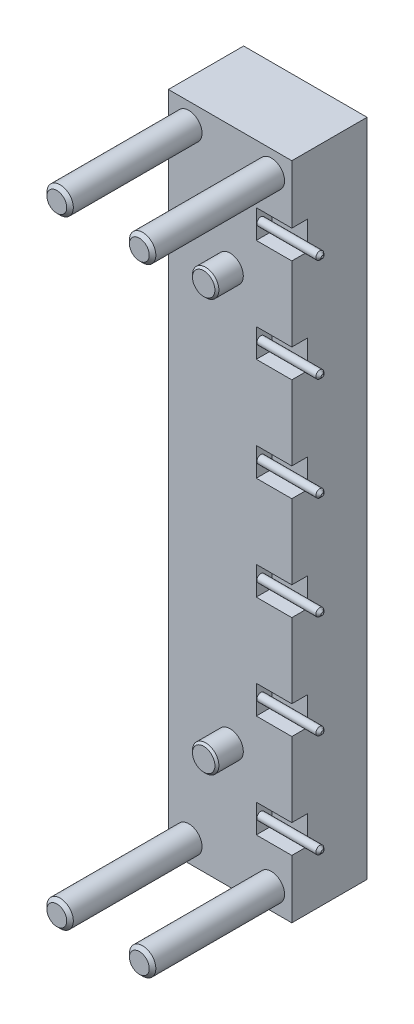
ISO-10303-21;
HEADER;
FILE_DESCRIPTION(('STEP AP214'),'2;1');
FILE_NAME('part.step','',(''),(''),'','','');
FILE_SCHEMA(('AUTOMOTIVE_DESIGN { 1 0 10303 214 1 1 1 1 }'));
ENDSEC;
DATA;
#1=APPLICATION_CONTEXT('core data for automotive mechanical design processes');
#2=APPLICATION_PROTOCOL_DEFINITION('international standard','automotive_design',2000,#1);
#3=PRODUCT_CONTEXT('',#1,'mechanical');
#4=PRODUCT('Part','Part','',(#3));
#5=PRODUCT_RELATED_PRODUCT_CATEGORY('part','',(#4));
#6=PRODUCT_DEFINITION_FORMATION('','',#4);
#7=PRODUCT_DEFINITION_CONTEXT('part definition',#1,'design');
#8=PRODUCT_DEFINITION('design','',#6,#7);
#9=PRODUCT_DEFINITION_SHAPE('','',#8);
#10=(LENGTH_UNIT() NAMED_UNIT(*) SI_UNIT(.MILLI.,.METRE.));
#11=(NAMED_UNIT(*) PLANE_ANGLE_UNIT() SI_UNIT($,.RADIAN.));
#12=(NAMED_UNIT(*) SI_UNIT($,.STERADIAN.) SOLID_ANGLE_UNIT());
#13=UNCERTAINTY_MEASURE_WITH_UNIT(LENGTH_MEASURE(1.E-05),#10,'distance_accuracy_value','');
#14=(GEOMETRIC_REPRESENTATION_CONTEXT(3) GLOBAL_UNCERTAINTY_ASSIGNED_CONTEXT((#13)) GLOBAL_UNIT_ASSIGNED_CONTEXT((#10,
#11,#12)) REPRESENTATION_CONTEXT('',''));
#15=CARTESIAN_POINT('',(0.,0.,0.));
#16=DIRECTION('',(0.,0.,1.));
#17=DIRECTION('',(1.,0.,0.));
#18=AXIS2_PLACEMENT_3D('',#15,#16,#17);
#19=CARTESIAN_POINT('',(2.37489999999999,2.79399999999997,1.36125409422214));
#20=DIRECTION('',(-1.,0.,0.));
#21=DIRECTION('',(0.,0.,1.));
#22=AXIS2_PLACEMENT_3D('',#19,#20,#21);
#23=SPHERICAL_SURFACE('',#22,0.1524);
#24=CARTESIAN_POINT('',(2.3749,2.79399999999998,1.36125409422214));
#25=DIRECTION('',(0.,0.,-1.));
#26=DIRECTION('',(0.,1.,0.));
#27=AXIS2_PLACEMENT_3D('',#24,#25,#26);
#28=CIRCLE('',#27,0.1524);
#29=CARTESIAN_POINT('',(2.5273,2.79399999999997,1.36125409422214));
#30=VERTEX_POINT('',#29);
#31=CARTESIAN_POINT('',(2.2225,2.79399999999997,1.36125409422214));
#32=VERTEX_POINT('',#31);
#33=EDGE_CURVE('E235',#30,#32,#28,.F.);
#34=ORIENTED_EDGE('',*,*,#33,.F.);
#35=CARTESIAN_POINT('',(2.3749,2.79399999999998,1.36125409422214));
#36=DIRECTION('',(0.,0.,-1.));
#37=DIRECTION('',(0.,1.,0.));
#38=AXIS2_PLACEMENT_3D('',#35,#36,#37);
#39=CIRCLE('',#38,0.1524);
#40=EDGE_CURVE('E238',#32,#30,#39,.F.);
#41=ORIENTED_EDGE('',*,*,#40,.F.);
#42=EDGE_LOOP('',(#34,#41));
#43=FACE_BOUND('',#42,.T.);
#44=ADVANCED_FACE('F15',(#43),#23,.T.);
#45=CARTESIAN_POINT('',(2.37489999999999,6.75639999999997,1.36125409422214));
#46=DIRECTION('',(-1.,0.,0.));
#47=DIRECTION('',(0.,0.,1.));
#48=AXIS2_PLACEMENT_3D('',#45,#46,#47);
#49=SPHERICAL_SURFACE('',#48,0.1524);
#50=CARTESIAN_POINT('',(2.3749,6.75639999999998,1.36125409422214));
#51=DIRECTION('',(0.,0.,-1.));
#52=DIRECTION('',(0.,1.,0.));
#53=AXIS2_PLACEMENT_3D('',#50,#51,#52);
#54=CIRCLE('',#53,0.1524);
#55=CARTESIAN_POINT('',(2.5273,6.75639999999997,1.36125409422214));
#56=VERTEX_POINT('',#55);
#57=CARTESIAN_POINT('',(2.2225,6.75639999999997,1.36125409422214));
#58=VERTEX_POINT('',#57);
#59=EDGE_CURVE('E242',#56,#58,#54,.F.);
#60=ORIENTED_EDGE('',*,*,#59,.F.);
#61=CARTESIAN_POINT('',(2.3749,6.75639999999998,1.36125409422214));
#62=DIRECTION('',(0.,0.,-1.));
#63=DIRECTION('',(0.,1.,0.));
#64=AXIS2_PLACEMENT_3D('',#61,#62,#63);
#65=CIRCLE('',#64,0.1524);
#66=EDGE_CURVE('E244',#58,#56,#65,.F.);
#67=ORIENTED_EDGE('',*,*,#66,.F.);
#68=EDGE_LOOP('',(#60,#67));
#69=FACE_BOUND('',#68,.T.);
#70=ADVANCED_FACE('F444',(#69),#49,.T.);
#71=CARTESIAN_POINT('',(2.37489999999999,10.7188,1.36125409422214));
#72=DIRECTION('',(-1.,0.,0.));
#73=DIRECTION('',(0.,0.,1.));
#74=AXIS2_PLACEMENT_3D('',#71,#72,#73);
#75=SPHERICAL_SURFACE('',#74,0.1524);
#76=CARTESIAN_POINT('',(2.3749,10.7188,1.36125409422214));
#77=DIRECTION('',(0.,0.,-1.));
#78=DIRECTION('',(0.,1.,0.));
#79=AXIS2_PLACEMENT_3D('',#76,#77,#78);
#80=CIRCLE('',#79,0.1524);
#81=CARTESIAN_POINT('',(2.52729999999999,10.7188,1.36125409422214));
#82=VERTEX_POINT('',#81);
#83=CARTESIAN_POINT('',(2.22249999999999,10.7188,1.36125409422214));
#84=VERTEX_POINT('',#83);
#85=EDGE_CURVE('E437',#82,#84,#80,.F.);
#86=ORIENTED_EDGE('',*,*,#85,.F.);
#87=CARTESIAN_POINT('',(2.3749,10.7188,1.36125409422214));
#88=DIRECTION('',(0.,0.,-1.));
#89=DIRECTION('',(0.,1.,0.));
#90=AXIS2_PLACEMENT_3D('',#87,#88,#89);
#91=CIRCLE('',#90,0.1524);
#92=EDGE_CURVE('E434',#84,#82,#91,.F.);
#93=ORIENTED_EDGE('',*,*,#92,.F.);
#94=EDGE_LOOP('',(#86,#93));
#95=FACE_BOUND('',#94,.T.);
#96=ADVANCED_FACE('F442',(#95),#75,.T.);
#97=CARTESIAN_POINT('',(2.37489999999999,14.6812,1.36125409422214));
#98=DIRECTION('',(-1.,0.,0.));
#99=DIRECTION('',(0.,0.,1.));
#100=AXIS2_PLACEMENT_3D('',#97,#98,#99);
#101=SPHERICAL_SURFACE('',#100,0.1524);
#102=CARTESIAN_POINT('',(2.37489999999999,14.6812,1.36125409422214));
#103=DIRECTION('',(0.,0.,-1.));
#104=DIRECTION('',(0.,1.,0.));
#105=AXIS2_PLACEMENT_3D('',#102,#103,#104);
#106=CIRCLE('',#105,0.1524);
#107=CARTESIAN_POINT('',(2.52729999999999,14.6812,1.36125409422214));
#108=VERTEX_POINT('',#107);
#109=CARTESIAN_POINT('',(2.22249999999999,14.6812,1.36125409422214));
#110=VERTEX_POINT('',#109);
#111=EDGE_CURVE('E430',#108,#110,#106,.F.);
#112=ORIENTED_EDGE('',*,*,#111,.F.);
#113=CARTESIAN_POINT('',(2.37489999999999,14.6812,1.36125409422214));
#114=DIRECTION('',(0.,0.,-1.));
#115=DIRECTION('',(0.,1.,0.));
#116=AXIS2_PLACEMENT_3D('',#113,#114,#115);
#117=CIRCLE('',#116,0.1524);
#118=EDGE_CURVE('E426',#110,#108,#117,.F.);
#119=ORIENTED_EDGE('',*,*,#118,.F.);
#120=EDGE_LOOP('',(#112,#119));
#121=FACE_BOUND('',#120,.T.);
#122=ADVANCED_FACE('F419',(#121),#101,.T.);
#123=CARTESIAN_POINT('',(2.37489999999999,18.6436,1.36125409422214));
#124=DIRECTION('',(-1.,0.,0.));
#125=DIRECTION('',(0.,0.,1.));
#126=AXIS2_PLACEMENT_3D('',#123,#124,#125);
#127=SPHERICAL_SURFACE('',#126,0.1524);
#128=CARTESIAN_POINT('',(2.37489999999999,18.6436,1.36125409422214));
#129=DIRECTION('',(0.,0.,-1.));
#130=DIRECTION('',(0.,1.,0.));
#131=AXIS2_PLACEMENT_3D('',#128,#129,#130);
#132=CIRCLE('',#131,0.1524);
#133=CARTESIAN_POINT('',(2.52729999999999,18.6436,1.36125409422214));
#134=VERTEX_POINT('',#133);
#135=CARTESIAN_POINT('',(2.22249999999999,18.6436,1.36125409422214));
#136=VERTEX_POINT('',#135);
#137=EDGE_CURVE('E429',#134,#136,#132,.F.);
#138=ORIENTED_EDGE('',*,*,#137,.F.);
#139=CARTESIAN_POINT('',(2.37489999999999,18.6436,1.36125409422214));
#140=DIRECTION('',(0.,0.,-1.));
#141=DIRECTION('',(0.,1.,0.));
#142=AXIS2_PLACEMENT_3D('',#139,#140,#141);
#143=CIRCLE('',#142,0.1524);
#144=EDGE_CURVE('E398',#136,#134,#143,.F.);
#145=ORIENTED_EDGE('',*,*,#144,.F.);
#146=EDGE_LOOP('',(#138,#145));
#147=FACE_BOUND('',#146,.T.);
#148=ADVANCED_FACE('F413',(#147),#127,.T.);
#149=CARTESIAN_POINT('',(2.37489999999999,22.606,1.36125409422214));
#150=DIRECTION('',(-1.,0.,0.));
#151=DIRECTION('',(0.,0.,1.));
#152=AXIS2_PLACEMENT_3D('',#149,#150,#151);
#153=SPHERICAL_SURFACE('',#152,0.1524);
#154=CARTESIAN_POINT('',(2.37489999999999,22.606,1.36125409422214));
#155=DIRECTION('',(0.,0.,-1.));
#156=DIRECTION('',(0.,1.,0.));
#157=AXIS2_PLACEMENT_3D('',#154,#155,#156);
#158=CIRCLE('',#157,0.1524);
#159=CARTESIAN_POINT('',(2.52729999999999,22.606,1.36125409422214));
#160=VERTEX_POINT('',#159);
#161=CARTESIAN_POINT('',(2.22249999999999,22.606,1.36125409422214));
#162=VERTEX_POINT('',#161);
#163=EDGE_CURVE('E394',#160,#162,#158,.F.);
#164=ORIENTED_EDGE('',*,*,#163,.F.);
#165=CARTESIAN_POINT('',(2.37489999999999,22.606,1.36125409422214));
#166=DIRECTION('',(0.,0.,-1.));
#167=DIRECTION('',(0.,1.,0.));
#168=AXIS2_PLACEMENT_3D('',#165,#166,#167);
#169=CIRCLE('',#168,0.1524);
#170=EDGE_CURVE('E391',#162,#160,#169,.F.);
#171=ORIENTED_EDGE('',*,*,#170,.F.);
#172=EDGE_LOOP('',(#164,#171));
#173=FACE_BOUND('',#172,.T.);
#174=ADVANCED_FACE('F409',(#173),#153,.T.);
#175=CARTESIAN_POINT('',(2.37489999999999,2.79399999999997,2.31375409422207));
#176=DIRECTION('',(0.,0.,-1.));
#177=DIRECTION('',(0.,1.,0.));
#178=AXIS2_PLACEMENT_3D('',#175,#176,#177);
#179=CYLINDRICAL_SURFACE('',#178,0.1524);
#180=ORIENTED_EDGE('',*,*,#40,.T.);
#181=ORIENTED_EDGE('',*,*,#33,.T.);
#182=EDGE_LOOP('',(#180,#181));
#183=FACE_BOUND('',#182,.T.);
#184=CARTESIAN_POINT('',(2.3749,2.79399999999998,2.1082));
#185=DIRECTION('',(0.,0.,-1.));
#186=DIRECTION('',(0.,1.,0.));
#187=AXIS2_PLACEMENT_3D('',#184,#185,#186);
#188=CIRCLE('',#187,0.1524);
#189=CARTESIAN_POINT('',(2.3749,2.94639999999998,2.1082));
#190=VERTEX_POINT('',#189);
#191=EDGE_CURVE('E19',#190,#190,#188,.T.);
#192=ORIENTED_EDGE('',*,*,#191,.T.);
#193=EDGE_LOOP('',(#192));
#194=FACE_BOUND('',#193,.T.);
#195=ADVANCED_FACE('F240',(#183,#194),#179,.T.);
#196=CARTESIAN_POINT('',(2.37489999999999,6.75639999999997,2.31375409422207));
#197=DIRECTION('',(0.,0.,-1.));
#198=DIRECTION('',(0.,1.,0.));
#199=AXIS2_PLACEMENT_3D('',#196,#197,#198);
#200=CYLINDRICAL_SURFACE('',#199,0.1524);
#201=ORIENTED_EDGE('',*,*,#66,.T.);
#202=ORIENTED_EDGE('',*,*,#59,.T.);
#203=EDGE_LOOP('',(#201,#202));
#204=FACE_BOUND('',#203,.T.);
#205=CARTESIAN_POINT('',(2.37489999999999,6.75639999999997,2.1082));
#206=DIRECTION('',(0.,0.,-1.));
#207=DIRECTION('',(0.,1.,0.));
#208=AXIS2_PLACEMENT_3D('',#205,#206,#207);
#209=CIRCLE('',#208,0.1524);
#210=CARTESIAN_POINT('',(2.37489999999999,6.90879999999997,2.1082));
#211=VERTEX_POINT('',#210);
#212=EDGE_CURVE('E386',#211,#211,#209,.T.);
#213=ORIENTED_EDGE('',*,*,#212,.T.);
#214=EDGE_LOOP('',(#213));
#215=FACE_BOUND('',#214,.T.);
#216=ADVANCED_FACE('F877',(#204,#215),#200,.T.);
#217=CARTESIAN_POINT('',(2.37489999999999,10.7188,2.31375409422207));
#218=DIRECTION('',(0.,0.,-1.));
#219=DIRECTION('',(0.,1.,0.));
#220=AXIS2_PLACEMENT_3D('',#217,#218,#219);
#221=CYLINDRICAL_SURFACE('',#220,0.1524);
#222=ORIENTED_EDGE('',*,*,#92,.T.);
#223=ORIENTED_EDGE('',*,*,#85,.T.);
#224=EDGE_LOOP('',(#222,#223));
#225=FACE_BOUND('',#224,.T.);
#226=CARTESIAN_POINT('',(2.37489999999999,10.7188,2.1082));
#227=DIRECTION('',(0.,0.,-1.));
#228=DIRECTION('',(0.,1.,0.));
#229=AXIS2_PLACEMENT_3D('',#226,#227,#228);
#230=CIRCLE('',#229,0.1524);
#231=CARTESIAN_POINT('',(2.37489999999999,10.8712,2.1082));
#232=VERTEX_POINT('',#231);
#233=EDGE_CURVE('E384',#232,#232,#230,.T.);
#234=ORIENTED_EDGE('',*,*,#233,.T.);
#235=EDGE_LOOP('',(#234));
#236=FACE_BOUND('',#235,.T.);
#237=ADVANCED_FACE('F874',(#225,#236),#221,.T.);
#238=CARTESIAN_POINT('',(2.37489999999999,14.6812,2.31375409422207));
#239=DIRECTION('',(0.,0.,-1.));
#240=DIRECTION('',(0.,1.,0.));
#241=AXIS2_PLACEMENT_3D('',#238,#239,#240);
#242=CYLINDRICAL_SURFACE('',#241,0.1524);
#243=ORIENTED_EDGE('',*,*,#118,.T.);
#244=ORIENTED_EDGE('',*,*,#111,.T.);
#245=EDGE_LOOP('',(#243,#244));
#246=FACE_BOUND('',#245,.T.);
#247=CARTESIAN_POINT('',(2.37489999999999,14.6812,2.1082));
#248=DIRECTION('',(0.,0.,-1.));
#249=DIRECTION('',(0.,1.,0.));
#250=AXIS2_PLACEMENT_3D('',#247,#248,#249);
#251=CIRCLE('',#250,0.1524);
#252=CARTESIAN_POINT('',(2.37489999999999,14.8336,2.1082));
#253=VERTEX_POINT('',#252);
#254=EDGE_CURVE('E381',#253,#253,#251,.T.);
#255=ORIENTED_EDGE('',*,*,#254,.T.);
#256=EDGE_LOOP('',(#255));
#257=FACE_BOUND('',#256,.T.);
#258=ADVANCED_FACE('F870',(#246,#257),#242,.T.);
#259=CARTESIAN_POINT('',(2.37489999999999,18.6436,2.31375409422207));
#260=DIRECTION('',(0.,0.,-1.));
#261=DIRECTION('',(0.,1.,0.));
#262=AXIS2_PLACEMENT_3D('',#259,#260,#261);
#263=CYLINDRICAL_SURFACE('',#262,0.1524);
#264=ORIENTED_EDGE('',*,*,#144,.T.);
#265=ORIENTED_EDGE('',*,*,#137,.T.);
#266=EDGE_LOOP('',(#264,#265));
#267=FACE_BOUND('',#266,.T.);
#268=CARTESIAN_POINT('',(2.37489999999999,18.6436,2.1082));
#269=DIRECTION('',(0.,0.,-1.));
#270=DIRECTION('',(0.,1.,0.));
#271=AXIS2_PLACEMENT_3D('',#268,#269,#270);
#272=CIRCLE('',#271,0.1524);
#273=CARTESIAN_POINT('',(2.37489999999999,18.796,2.1082));
#274=VERTEX_POINT('',#273);
#275=EDGE_CURVE('E378',#274,#274,#272,.T.);
#276=ORIENTED_EDGE('',*,*,#275,.T.);
#277=EDGE_LOOP('',(#276));
#278=FACE_BOUND('',#277,.T.);
#279=ADVANCED_FACE('F867',(#267,#278),#263,.T.);
#280=CARTESIAN_POINT('',(2.37489999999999,22.606,2.31375409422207));
#281=DIRECTION('',(0.,0.,-1.));
#282=DIRECTION('',(0.,1.,0.));
#283=AXIS2_PLACEMENT_3D('',#280,#281,#282);
#284=CYLINDRICAL_SURFACE('',#283,0.1524);
#285=ORIENTED_EDGE('',*,*,#170,.T.);
#286=ORIENTED_EDGE('',*,*,#163,.T.);
#287=EDGE_LOOP('',(#285,#286));
#288=FACE_BOUND('',#287,.T.);
#289=CARTESIAN_POINT('',(2.37489999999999,22.606,2.1082));
#290=DIRECTION('',(0.,0.,-1.));
#291=DIRECTION('',(0.,1.,0.));
#292=AXIS2_PLACEMENT_3D('',#289,#290,#291);
#293=CIRCLE('',#292,0.1524);
#294=CARTESIAN_POINT('',(2.37489999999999,22.7584,2.1082));
#295=VERTEX_POINT('',#294);
#296=EDGE_CURVE('E375',#295,#295,#293,.T.);
#297=ORIENTED_EDGE('',*,*,#296,.T.);
#298=EDGE_LOOP('',(#297));
#299=FACE_BOUND('',#298,.T.);
#300=ADVANCED_FACE('F863',(#288,#299),#284,.T.);
#301=CARTESIAN_POINT('',(3.21945,2.794,2.1082));
#302=DIRECTION('',(0.,0.,1.));
#303=DIRECTION('',(1.,0.,0.));
#304=AXIS2_PLACEMENT_3D('',#301,#302,#303);
#305=PLANE('',#304);
#306=ORIENTED_EDGE('',*,*,#191,.F.);
#307=EDGE_LOOP('',(#306));
#308=FACE_BOUND('',#307,.T.);
#309=CARTESIAN_POINT('',(2.3749,2.794,2.1082));
#310=DIRECTION('',(0.,0.,1.));
#311=DIRECTION('',(1.,0.,0.));
#312=AXIS2_PLACEMENT_3D('',#309,#310,#311);
#313=CIRCLE('',#312,1.1303);
#314=CARTESIAN_POINT('',(3.5052,2.794,2.1082));
#315=VERTEX_POINT('',#314);
#316=EDGE_CURVE('E372',#315,#315,#313,.F.);
#317=ORIENTED_EDGE('',*,*,#316,.T.);
#318=EDGE_LOOP('',(#317));
#319=FACE_BOUND('',#318,.T.);
#320=ADVANCED_FACE('F859',(#308,#319),#305,.F.);
#321=CARTESIAN_POINT('',(3.21945,6.7564,2.1082));
#322=DIRECTION('',(0.,0.,1.));
#323=DIRECTION('',(1.,0.,0.));
#324=AXIS2_PLACEMENT_3D('',#321,#322,#323);
#325=PLANE('',#324);
#326=ORIENTED_EDGE('',*,*,#212,.F.);
#327=EDGE_LOOP('',(#326));
#328=FACE_BOUND('',#327,.T.);
#329=CARTESIAN_POINT('',(2.3749,6.7564,2.1082));
#330=DIRECTION('',(0.,0.,1.));
#331=DIRECTION('',(1.,0.,0.));
#332=AXIS2_PLACEMENT_3D('',#329,#330,#331);
#333=CIRCLE('',#332,1.1303);
#334=CARTESIAN_POINT('',(3.5052,6.7564,2.1082));
#335=VERTEX_POINT('',#334);
#336=EDGE_CURVE('E369',#335,#335,#333,.F.);
#337=ORIENTED_EDGE('',*,*,#336,.T.);
#338=EDGE_LOOP('',(#337));
#339=FACE_BOUND('',#338,.T.);
#340=ADVANCED_FACE('F855',(#328,#339),#325,.F.);
#341=CARTESIAN_POINT('',(3.21945,10.7188,2.1082));
#342=DIRECTION('',(0.,0.,1.));
#343=DIRECTION('',(1.,0.,0.));
#344=AXIS2_PLACEMENT_3D('',#341,#342,#343);
#345=PLANE('',#344);
#346=ORIENTED_EDGE('',*,*,#233,.F.);
#347=EDGE_LOOP('',(#346));
#348=FACE_BOUND('',#347,.T.);
#349=CARTESIAN_POINT('',(2.3749,10.7188,2.1082));
#350=DIRECTION('',(0.,0.,1.));
#351=DIRECTION('',(1.,0.,0.));
#352=AXIS2_PLACEMENT_3D('',#349,#350,#351);
#353=CIRCLE('',#352,1.1303);
#354=CARTESIAN_POINT('',(3.5052,10.7188,2.1082));
#355=VERTEX_POINT('',#354);
#356=EDGE_CURVE('E366',#355,#355,#353,.F.);
#357=ORIENTED_EDGE('',*,*,#356,.T.);
#358=EDGE_LOOP('',(#357));
#359=FACE_BOUND('',#358,.T.);
#360=ADVANCED_FACE('F851',(#348,#359),#345,.F.);
#361=CARTESIAN_POINT('',(3.21945,14.6812,2.1082));
#362=DIRECTION('',(0.,0.,1.));
#363=DIRECTION('',(1.,0.,0.));
#364=AXIS2_PLACEMENT_3D('',#361,#362,#363);
#365=PLANE('',#364);
#366=ORIENTED_EDGE('',*,*,#254,.F.);
#367=EDGE_LOOP('',(#366));
#368=FACE_BOUND('',#367,.T.);
#369=CARTESIAN_POINT('',(2.3749,14.6812,2.1082));
#370=DIRECTION('',(0.,0.,1.));
#371=DIRECTION('',(1.,0.,0.));
#372=AXIS2_PLACEMENT_3D('',#369,#370,#371);
#373=CIRCLE('',#372,1.1303);
#374=CARTESIAN_POINT('',(3.5052,14.6812,2.1082));
#375=VERTEX_POINT('',#374);
#376=EDGE_CURVE('E363',#375,#375,#373,.F.);
#377=ORIENTED_EDGE('',*,*,#376,.T.);
#378=EDGE_LOOP('',(#377));
#379=FACE_BOUND('',#378,.T.);
#380=ADVANCED_FACE('F847',(#368,#379),#365,.F.);
#381=CARTESIAN_POINT('',(3.21945,18.6436,2.1082));
#382=DIRECTION('',(0.,0.,1.));
#383=DIRECTION('',(1.,0.,0.));
#384=AXIS2_PLACEMENT_3D('',#381,#382,#383);
#385=PLANE('',#384);
#386=ORIENTED_EDGE('',*,*,#275,.F.);
#387=EDGE_LOOP('',(#386));
#388=FACE_BOUND('',#387,.T.);
#389=CARTESIAN_POINT('',(2.3749,18.6436,2.1082));
#390=DIRECTION('',(0.,0.,1.));
#391=DIRECTION('',(1.,0.,0.));
#392=AXIS2_PLACEMENT_3D('',#389,#390,#391);
#393=CIRCLE('',#392,1.1303);
#394=CARTESIAN_POINT('',(3.5052,18.6436,2.1082));
#395=VERTEX_POINT('',#394);
#396=EDGE_CURVE('E360',#395,#395,#393,.F.);
#397=ORIENTED_EDGE('',*,*,#396,.T.);
#398=EDGE_LOOP('',(#397));
#399=FACE_BOUND('',#398,.T.);
#400=ADVANCED_FACE('F843',(#388,#399),#385,.F.);
#401=CARTESIAN_POINT('',(3.21945,22.606,2.1082));
#402=DIRECTION('',(0.,0.,1.));
#403=DIRECTION('',(1.,0.,0.));
#404=AXIS2_PLACEMENT_3D('',#401,#402,#403);
#405=PLANE('',#404);
#406=ORIENTED_EDGE('',*,*,#296,.F.);
#407=EDGE_LOOP('',(#406));
#408=FACE_BOUND('',#407,.T.);
#409=CARTESIAN_POINT('',(2.3749,22.606,2.1082));
#410=DIRECTION('',(0.,0.,1.));
#411=DIRECTION('',(1.,0.,0.));
#412=AXIS2_PLACEMENT_3D('',#409,#410,#411);
#413=CIRCLE('',#412,1.1303);
#414=CARTESIAN_POINT('',(3.5052,22.606,2.1082));
#415=VERTEX_POINT('',#414);
#416=EDGE_CURVE('E356',#415,#415,#413,.F.);
#417=ORIENTED_EDGE('',*,*,#416,.T.);
#418=EDGE_LOOP('',(#417));
#419=FACE_BOUND('',#418,.T.);
#420=ADVANCED_FACE('F839',(#408,#419),#405,.F.);
#421=CARTESIAN_POINT('',(2.3749,2.794,0.));
#422=DIRECTION('',(0.,0.,1.));
#423=DIRECTION('',(1.,0.,0.));
#424=AXIS2_PLACEMENT_3D('',#421,#422,#423);
#425=CYLINDRICAL_SURFACE('',#424,1.1303);
#426=ORIENTED_EDGE('',*,*,#316,.F.);
#427=EDGE_LOOP('',(#426));
#428=FACE_BOUND('',#427,.T.);
#429=CARTESIAN_POINT('',(2.3749,2.794,1.5493999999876));
#430=DIRECTION('',(0.,0.,1.));
#431=DIRECTION('',(1.,0.,0.));
#432=AXIS2_PLACEMENT_3D('',#429,#430,#431);
#433=CIRCLE('',#432,1.13030000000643);
#434=CARTESIAN_POINT('',(3.50520000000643,2.794,1.5493999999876));
#435=VERTEX_POINT('',#434);
#436=EDGE_CURVE('E359',#435,#435,#433,.F.);
#437=ORIENTED_EDGE('',*,*,#436,.T.);
#438=EDGE_LOOP('',(#437));
#439=FACE_BOUND('',#438,.T.);
#440=ADVANCED_FACE('F835',(#428,#439),#425,.F.);
#441=CARTESIAN_POINT('',(2.3749,6.7564,0.));
#442=DIRECTION('',(0.,0.,1.));
#443=DIRECTION('',(1.,0.,0.));
#444=AXIS2_PLACEMENT_3D('',#441,#442,#443);
#445=CYLINDRICAL_SURFACE('',#444,1.1303);
#446=ORIENTED_EDGE('',*,*,#336,.F.);
#447=EDGE_LOOP('',(#446));
#448=FACE_BOUND('',#447,.T.);
#449=CARTESIAN_POINT('',(2.3749,6.7564,1.5493999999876));
#450=DIRECTION('',(0.,0.,1.));
#451=DIRECTION('',(1.,0.,0.));
#452=AXIS2_PLACEMENT_3D('',#449,#450,#451);
#453=CIRCLE('',#452,1.13030000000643);
#454=CARTESIAN_POINT('',(3.50520000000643,6.7564,1.5493999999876));
#455=VERTEX_POINT('',#454);
#456=EDGE_CURVE('E903',#455,#455,#453,.F.);
#457=ORIENTED_EDGE('',*,*,#456,.T.);
#458=EDGE_LOOP('',(#457));
#459=FACE_BOUND('',#458,.T.);
#460=ADVANCED_FACE('F831',(#448,#459),#445,.F.);
#461=CARTESIAN_POINT('',(2.3749,10.7188,0.));
#462=DIRECTION('',(0.,0.,1.));
#463=DIRECTION('',(1.,0.,0.));
#464=AXIS2_PLACEMENT_3D('',#461,#462,#463);
#465=CYLINDRICAL_SURFACE('',#464,1.1303);
#466=ORIENTED_EDGE('',*,*,#356,.F.);
#467=EDGE_LOOP('',(#466));
#468=FACE_BOUND('',#467,.T.);
#469=CARTESIAN_POINT('',(2.3749,10.7188,1.5493999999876));
#470=DIRECTION('',(0.,0.,1.));
#471=DIRECTION('',(1.,0.,0.));
#472=AXIS2_PLACEMENT_3D('',#469,#470,#471);
#473=CIRCLE('',#472,1.13030000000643);
#474=CARTESIAN_POINT('',(3.50520000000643,10.7188,1.5493999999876));
#475=VERTEX_POINT('',#474);
#476=EDGE_CURVE('E906',#475,#475,#473,.F.);
#477=ORIENTED_EDGE('',*,*,#476,.T.);
#478=EDGE_LOOP('',(#477));
#479=FACE_BOUND('',#478,.T.);
#480=ADVANCED_FACE('F827',(#468,#479),#465,.F.);
#481=CARTESIAN_POINT('',(2.3749,14.6812,0.));
#482=DIRECTION('',(0.,0.,1.));
#483=DIRECTION('',(1.,0.,0.));
#484=AXIS2_PLACEMENT_3D('',#481,#482,#483);
#485=CYLINDRICAL_SURFACE('',#484,1.1303);
#486=ORIENTED_EDGE('',*,*,#376,.F.);
#487=EDGE_LOOP('',(#486));
#488=FACE_BOUND('',#487,.T.);
#489=CARTESIAN_POINT('',(2.3749,14.6812,1.5493999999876));
#490=DIRECTION('',(0.,0.,1.));
#491=DIRECTION('',(1.,0.,0.));
#492=AXIS2_PLACEMENT_3D('',#489,#490,#491);
#493=CIRCLE('',#492,1.13030000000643);
#494=CARTESIAN_POINT('',(3.50520000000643,14.6812,1.5493999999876));
#495=VERTEX_POINT('',#494);
#496=EDGE_CURVE('E909',#495,#495,#493,.F.);
#497=ORIENTED_EDGE('',*,*,#496,.T.);
#498=EDGE_LOOP('',(#497));
#499=FACE_BOUND('',#498,.T.);
#500=ADVANCED_FACE('F823',(#488,#499),#485,.F.);
#501=CARTESIAN_POINT('',(2.3749,18.6436,0.));
#502=DIRECTION('',(0.,0.,1.));
#503=DIRECTION('',(1.,0.,0.));
#504=AXIS2_PLACEMENT_3D('',#501,#502,#503);
#505=CYLINDRICAL_SURFACE('',#504,1.1303);
#506=ORIENTED_EDGE('',*,*,#396,.F.);
#507=EDGE_LOOP('',(#506));
#508=FACE_BOUND('',#507,.T.);
#509=CARTESIAN_POINT('',(2.3749,18.6436,1.5493999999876));
#510=DIRECTION('',(0.,0.,1.));
#511=DIRECTION('',(1.,0.,0.));
#512=AXIS2_PLACEMENT_3D('',#509,#510,#511);
#513=CIRCLE('',#512,1.13030000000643);
#514=CARTESIAN_POINT('',(3.50520000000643,18.6436,1.5493999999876));
#515=VERTEX_POINT('',#514);
#516=EDGE_CURVE('E912',#515,#515,#513,.F.);
#517=ORIENTED_EDGE('',*,*,#516,.T.);
#518=EDGE_LOOP('',(#517));
#519=FACE_BOUND('',#518,.T.);
#520=ADVANCED_FACE('F819',(#508,#519),#505,.F.);
#521=CARTESIAN_POINT('',(2.3749,22.606,0.));
#522=DIRECTION('',(0.,0.,1.));
#523=DIRECTION('',(1.,0.,0.));
#524=AXIS2_PLACEMENT_3D('',#521,#522,#523);
#525=CYLINDRICAL_SURFACE('',#524,1.1303);
#526=ORIENTED_EDGE('',*,*,#416,.F.);
#527=EDGE_LOOP('',(#526));
#528=FACE_BOUND('',#527,.T.);
#529=CARTESIAN_POINT('',(2.3749,22.606,1.5493999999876));
#530=DIRECTION('',(0.,0.,1.));
#531=DIRECTION('',(1.,0.,0.));
#532=AXIS2_PLACEMENT_3D('',#529,#530,#531);
#533=CIRCLE('',#532,1.13030000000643);
#534=CARTESIAN_POINT('',(3.50520000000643,22.606,1.5493999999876));
#535=VERTEX_POINT('',#534);
#536=EDGE_CURVE('E915',#535,#535,#533,.F.);
#537=ORIENTED_EDGE('',*,*,#536,.T.);
#538=EDGE_LOOP('',(#537));
#539=FACE_BOUND('',#538,.T.);
#540=ADVANCED_FACE('F815',(#528,#539),#525,.F.);
#541=CARTESIAN_POINT('',(2.3749,2.794,1.5493999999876));
#542=DIRECTION('',(0.,0.,1.));
#543=DIRECTION('',(1.,0.,0.));
#544=AXIS2_PLACEMENT_3D('',#541,#542,#543);
#545=CONICAL_SURFACE('',#544,1.13030000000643,0.523598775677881);
#546=ORIENTED_EDGE('',*,*,#436,.F.);
#547=EDGE_LOOP('',(#546));
#548=FACE_BOUND('',#547,.T.);
#549=CARTESIAN_POINT('',(2.3749,2.794,1.48340886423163));
#550=DIRECTION('',(0.,0.,1.));
#551=DIRECTION('',(1.,0.,0.));
#552=AXIS2_PLACEMENT_3D('',#549,#550,#551);
#553=CIRCLE('',#552,1.0922);
#554=CARTESIAN_POINT('',(3.4671,2.794,1.48340886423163));
#555=VERTEX_POINT('',#554);
#556=EDGE_CURVE('E918',#555,#555,#553,.F.);
#557=ORIENTED_EDGE('',*,*,#556,.T.);
#558=EDGE_LOOP('',(#557));
#559=FACE_BOUND('',#558,.T.);
#560=ADVANCED_FACE('F811',(#548,#559),#545,.F.);
#561=CARTESIAN_POINT('',(2.3749,6.7564,1.5493999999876));
#562=DIRECTION('',(0.,0.,1.));
#563=DIRECTION('',(1.,0.,0.));
#564=AXIS2_PLACEMENT_3D('',#561,#562,#563);
#565=CONICAL_SURFACE('',#564,1.13030000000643,0.523598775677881);
#566=ORIENTED_EDGE('',*,*,#456,.F.);
#567=EDGE_LOOP('',(#566));
#568=FACE_BOUND('',#567,.T.);
#569=CARTESIAN_POINT('',(2.3749,6.7564,1.48340886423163));
#570=DIRECTION('',(0.,0.,1.));
#571=DIRECTION('',(1.,0.,0.));
#572=AXIS2_PLACEMENT_3D('',#569,#570,#571);
#573=CIRCLE('',#572,1.0922);
#574=CARTESIAN_POINT('',(3.4671,6.7564,1.48340886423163));
#575=VERTEX_POINT('',#574);
#576=EDGE_CURVE('E921',#575,#575,#573,.F.);
#577=ORIENTED_EDGE('',*,*,#576,.T.);
#578=EDGE_LOOP('',(#577));
#579=FACE_BOUND('',#578,.T.);
#580=ADVANCED_FACE('F807',(#568,#579),#565,.F.);
#581=CARTESIAN_POINT('',(2.3749,10.7188,1.5493999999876));
#582=DIRECTION('',(0.,0.,1.));
#583=DIRECTION('',(1.,0.,0.));
#584=AXIS2_PLACEMENT_3D('',#581,#582,#583);
#585=CONICAL_SURFACE('',#584,1.13030000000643,0.523598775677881);
#586=ORIENTED_EDGE('',*,*,#476,.F.);
#587=EDGE_LOOP('',(#586));
#588=FACE_BOUND('',#587,.T.);
#589=CARTESIAN_POINT('',(2.3749,10.7188,1.48340886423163));
#590=DIRECTION('',(0.,0.,1.));
#591=DIRECTION('',(1.,0.,0.));
#592=AXIS2_PLACEMENT_3D('',#589,#590,#591);
#593=CIRCLE('',#592,1.0922);
#594=CARTESIAN_POINT('',(3.4671,10.7188,1.48340886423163));
#595=VERTEX_POINT('',#594);
#596=EDGE_CURVE('E924',#595,#595,#593,.F.);
#597=ORIENTED_EDGE('',*,*,#596,.T.);
#598=EDGE_LOOP('',(#597));
#599=FACE_BOUND('',#598,.T.);
#600=ADVANCED_FACE('F803',(#588,#599),#585,.F.);
#601=CARTESIAN_POINT('',(2.3749,14.6812,1.5493999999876));
#602=DIRECTION('',(0.,0.,1.));
#603=DIRECTION('',(1.,0.,0.));
#604=AXIS2_PLACEMENT_3D('',#601,#602,#603);
#605=CONICAL_SURFACE('',#604,1.13030000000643,0.523598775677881);
#606=ORIENTED_EDGE('',*,*,#496,.F.);
#607=EDGE_LOOP('',(#606));
#608=FACE_BOUND('',#607,.T.);
#609=CARTESIAN_POINT('',(2.3749,14.6812,1.48340886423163));
#610=DIRECTION('',(0.,0.,1.));
#611=DIRECTION('',(1.,0.,0.));
#612=AXIS2_PLACEMENT_3D('',#609,#610,#611);
#613=CIRCLE('',#612,1.0922);
#614=CARTESIAN_POINT('',(3.4671,14.6812,1.48340886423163));
#615=VERTEX_POINT('',#614);
#616=EDGE_CURVE('E927',#615,#615,#613,.F.);
#617=ORIENTED_EDGE('',*,*,#616,.T.);
#618=EDGE_LOOP('',(#617));
#619=FACE_BOUND('',#618,.T.);
#620=ADVANCED_FACE('F799',(#608,#619),#605,.F.);
#621=CARTESIAN_POINT('',(2.3749,18.6436,1.5493999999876));
#622=DIRECTION('',(0.,0.,1.));
#623=DIRECTION('',(1.,0.,0.));
#624=AXIS2_PLACEMENT_3D('',#621,#622,#623);
#625=CONICAL_SURFACE('',#624,1.13030000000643,0.523598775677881);
#626=ORIENTED_EDGE('',*,*,#516,.F.);
#627=EDGE_LOOP('',(#626));
#628=FACE_BOUND('',#627,.T.);
#629=CARTESIAN_POINT('',(2.3749,18.6436,1.48340886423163));
#630=DIRECTION('',(0.,0.,1.));
#631=DIRECTION('',(1.,0.,0.));
#632=AXIS2_PLACEMENT_3D('',#629,#630,#631);
#633=CIRCLE('',#632,1.0922);
#634=CARTESIAN_POINT('',(3.4671,18.6436,1.48340886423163));
#635=VERTEX_POINT('',#634);
#636=EDGE_CURVE('E930',#635,#635,#633,.F.);
#637=ORIENTED_EDGE('',*,*,#636,.T.);
#638=EDGE_LOOP('',(#637));
#639=FACE_BOUND('',#638,.T.);
#640=ADVANCED_FACE('F795',(#628,#639),#625,.F.);
#641=CARTESIAN_POINT('',(2.3749,22.606,1.5493999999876));
#642=DIRECTION('',(0.,0.,1.));
#643=DIRECTION('',(1.,0.,0.));
#644=AXIS2_PLACEMENT_3D('',#641,#642,#643);
#645=CONICAL_SURFACE('',#644,1.13030000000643,0.523598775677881);
#646=ORIENTED_EDGE('',*,*,#536,.F.);
#647=EDGE_LOOP('',(#646));
#648=FACE_BOUND('',#647,.T.);
#649=CARTESIAN_POINT('',(2.3749,22.606,1.48340886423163));
#650=DIRECTION('',(0.,0.,1.));
#651=DIRECTION('',(1.,0.,0.));
#652=AXIS2_PLACEMENT_3D('',#649,#650,#651);
#653=CIRCLE('',#652,1.0922);
#654=CARTESIAN_POINT('',(3.4671,22.606,1.48340886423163));
#655=VERTEX_POINT('',#654);
#656=EDGE_CURVE('E933',#655,#655,#653,.F.);
#657=ORIENTED_EDGE('',*,*,#656,.T.);
#658=EDGE_LOOP('',(#657));
#659=FACE_BOUND('',#658,.T.);
#660=ADVANCED_FACE('F791',(#648,#659),#645,.F.);
#661=CARTESIAN_POINT('',(2.3749,2.794,0.));
#662=DIRECTION('',(0.,0.,1.));
#663=DIRECTION('',(1.,0.,0.));
#664=AXIS2_PLACEMENT_3D('',#661,#662,#663);
#665=CYLINDRICAL_SURFACE('',#664,1.0922);
#666=ORIENTED_EDGE('',*,*,#556,.F.);
#667=EDGE_LOOP('',(#666));
#668=FACE_BOUND('',#667,.T.);
#669=CARTESIAN_POINT('',(2.3749,2.794,1.02572022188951));
#670=DIRECTION('',(0.,0.,-1.));
#671=DIRECTION('',(-1.,0.,0.));
#672=AXIS2_PLACEMENT_3D('',#669,#670,#671);
#673=CIRCLE('',#672,1.0922000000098);
#674=CARTESIAN_POINT('',(1.2826999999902,2.794,1.02572022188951));
#675=VERTEX_POINT('',#674);
#676=EDGE_CURVE('E936',#675,#675,#673,.T.);
#677=ORIENTED_EDGE('',*,*,#676,.T.);
#678=EDGE_LOOP('',(#677));
#679=FACE_BOUND('',#678,.T.);
#680=ADVANCED_FACE('F787',(#668,#679),#665,.F.);
#681=CARTESIAN_POINT('',(2.3749,6.7564,0.));
#682=DIRECTION('',(0.,0.,1.));
#683=DIRECTION('',(1.,0.,0.));
#684=AXIS2_PLACEMENT_3D('',#681,#682,#683);
#685=CYLINDRICAL_SURFACE('',#684,1.0922);
#686=ORIENTED_EDGE('',*,*,#576,.F.);
#687=EDGE_LOOP('',(#686));
#688=FACE_BOUND('',#687,.T.);
#689=CARTESIAN_POINT('',(2.3749,6.7564,1.02572022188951));
#690=DIRECTION('',(0.,0.,-1.));
#691=DIRECTION('',(-1.,0.,0.));
#692=AXIS2_PLACEMENT_3D('',#689,#690,#691);
#693=CIRCLE('',#692,1.0922000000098);
#694=CARTESIAN_POINT('',(1.2826999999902,6.7564,1.02572022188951));
#695=VERTEX_POINT('',#694);
#696=EDGE_CURVE('E939',#695,#695,#693,.T.);
#697=ORIENTED_EDGE('',*,*,#696,.T.);
#698=EDGE_LOOP('',(#697));
#699=FACE_BOUND('',#698,.T.);
#700=ADVANCED_FACE('F783',(#688,#699),#685,.F.);
#701=CARTESIAN_POINT('',(2.3749,10.7188,0.));
#702=DIRECTION('',(0.,0.,1.));
#703=DIRECTION('',(1.,0.,0.));
#704=AXIS2_PLACEMENT_3D('',#701,#702,#703);
#705=CYLINDRICAL_SURFACE('',#704,1.0922);
#706=ORIENTED_EDGE('',*,*,#596,.F.);
#707=EDGE_LOOP('',(#706));
#708=FACE_BOUND('',#707,.T.);
#709=CARTESIAN_POINT('',(2.3749,10.7188,1.02572022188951));
#710=DIRECTION('',(0.,0.,-1.));
#711=DIRECTION('',(-1.,0.,0.));
#712=AXIS2_PLACEMENT_3D('',#709,#710,#711);
#713=CIRCLE('',#712,1.0922000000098);
#714=CARTESIAN_POINT('',(1.2826999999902,10.7188,1.02572022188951));
#715=VERTEX_POINT('',#714);
#716=EDGE_CURVE('E942',#715,#715,#713,.T.);
#717=ORIENTED_EDGE('',*,*,#716,.T.);
#718=EDGE_LOOP('',(#717));
#719=FACE_BOUND('',#718,.T.);
#720=ADVANCED_FACE('F779',(#708,#719),#705,.F.);
#721=CARTESIAN_POINT('',(2.3749,14.6812,0.));
#722=DIRECTION('',(0.,0.,1.));
#723=DIRECTION('',(1.,0.,0.));
#724=AXIS2_PLACEMENT_3D('',#721,#722,#723);
#725=CYLINDRICAL_SURFACE('',#724,1.0922);
#726=ORIENTED_EDGE('',*,*,#616,.F.);
#727=EDGE_LOOP('',(#726));
#728=FACE_BOUND('',#727,.T.);
#729=CARTESIAN_POINT('',(2.3749,14.6812,1.02572022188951));
#730=DIRECTION('',(0.,0.,-1.));
#731=DIRECTION('',(-1.,0.,0.));
#732=AXIS2_PLACEMENT_3D('',#729,#730,#731);
#733=CIRCLE('',#732,1.0922000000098);
#734=CARTESIAN_POINT('',(1.2826999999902,14.6812,1.02572022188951));
#735=VERTEX_POINT('',#734);
#736=EDGE_CURVE('E945',#735,#735,#733,.T.);
#737=ORIENTED_EDGE('',*,*,#736,.T.);
#738=EDGE_LOOP('',(#737));
#739=FACE_BOUND('',#738,.T.);
#740=ADVANCED_FACE('F775',(#728,#739),#725,.F.);
#741=CARTESIAN_POINT('',(2.3749,18.6436,0.));
#742=DIRECTION('',(0.,0.,1.));
#743=DIRECTION('',(1.,0.,0.));
#744=AXIS2_PLACEMENT_3D('',#741,#742,#743);
#745=CYLINDRICAL_SURFACE('',#744,1.0922);
#746=ORIENTED_EDGE('',*,*,#636,.F.);
#747=EDGE_LOOP('',(#746));
#748=FACE_BOUND('',#747,.T.);
#749=CARTESIAN_POINT('',(2.3749,18.6436,1.02572022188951));
#750=DIRECTION('',(0.,0.,-1.));
#751=DIRECTION('',(-1.,0.,0.));
#752=AXIS2_PLACEMENT_3D('',#749,#750,#751);
#753=CIRCLE('',#752,1.0922000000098);
#754=CARTESIAN_POINT('',(1.2826999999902,18.6436,1.02572022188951));
#755=VERTEX_POINT('',#754);
#756=EDGE_CURVE('E948',#755,#755,#753,.T.);
#757=ORIENTED_EDGE('',*,*,#756,.T.);
#758=EDGE_LOOP('',(#757));
#759=FACE_BOUND('',#758,.T.);
#760=ADVANCED_FACE('F771',(#748,#759),#745,.F.);
#761=CARTESIAN_POINT('',(2.3749,22.606,0.));
#762=DIRECTION('',(0.,0.,1.));
#763=DIRECTION('',(1.,0.,0.));
#764=AXIS2_PLACEMENT_3D('',#761,#762,#763);
#765=CYLINDRICAL_SURFACE('',#764,1.0922);
#766=ORIENTED_EDGE('',*,*,#656,.F.);
#767=EDGE_LOOP('',(#766));
#768=FACE_BOUND('',#767,.T.);
#769=CARTESIAN_POINT('',(2.3749,22.606,1.02572022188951));
#770=DIRECTION('',(0.,0.,-1.));
#771=DIRECTION('',(-1.,0.,0.));
#772=AXIS2_PLACEMENT_3D('',#769,#770,#771);
#773=CIRCLE('',#772,1.0922000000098);
#774=CARTESIAN_POINT('',(1.2826999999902,22.606,1.02572022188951));
#775=VERTEX_POINT('',#774);
#776=EDGE_CURVE('E355',#775,#775,#773,.T.);
#777=ORIENTED_EDGE('',*,*,#776,.T.);
#778=EDGE_LOOP('',(#777));
#779=FACE_BOUND('',#778,.T.);
#780=ADVANCED_FACE('F767',(#768,#779),#765,.F.);
#781=CARTESIAN_POINT('',(5.7531,22.6059999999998,2.72015409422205));
#782=DIRECTION('',(1.,0.,0.));
#783=DIRECTION('',(0.,1.,0.));
#784=AXIS2_PLACEMENT_3D('',#781,#782,#783);
#785=PLANE('',#784);
#786=CARTESIAN_POINT('',(5.75310000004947,22.6059999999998,2.72015409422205));
#787=DIRECTION('',(-1.,0.,0.));
#788=DIRECTION('',(0.,-1.,0.));
#789=AXIS2_PLACEMENT_3D('',#786,#787,#788);
#790=CIRCLE('',#789,0.0507999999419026);
#791=CARTESIAN_POINT('',(5.75310000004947,22.5552000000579,2.72015409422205));
#792=VERTEX_POINT('',#791);
#793=EDGE_CURVE('E352',#792,#792,#790,.T.);
#794=ORIENTED_EDGE('',*,*,#793,.F.);
#795=EDGE_LOOP('',(#794));
#796=FACE_BOUND('',#795,.T.);
#797=ADVANCED_FACE('F763',(#796),#785,.T.);
#798=CARTESIAN_POINT('',(5.7531,18.6435999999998,2.72015409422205));
#799=DIRECTION('',(1.,0.,0.));
#800=DIRECTION('',(0.,1.,0.));
#801=AXIS2_PLACEMENT_3D('',#798,#799,#800);
#802=PLANE('',#801);
#803=CARTESIAN_POINT('',(5.75310000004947,18.6435999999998,2.72015409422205));
#804=DIRECTION('',(-1.,0.,0.));
#805=DIRECTION('',(0.,-1.,0.));
#806=AXIS2_PLACEMENT_3D('',#803,#804,#805);
#807=CIRCLE('',#806,0.0507999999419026);
#808=CARTESIAN_POINT('',(5.75310000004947,18.5928000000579,2.72015409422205));
#809=VERTEX_POINT('',#808);
#810=EDGE_CURVE('E349',#809,#809,#807,.T.);
#811=ORIENTED_EDGE('',*,*,#810,.F.);
#812=EDGE_LOOP('',(#811));
#813=FACE_BOUND('',#812,.T.);
#814=ADVANCED_FACE('F759',(#813),#802,.T.);
#815=CARTESIAN_POINT('',(5.7531,14.6811999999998,2.72015409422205));
#816=DIRECTION('',(1.,0.,0.));
#817=DIRECTION('',(0.,1.,0.));
#818=AXIS2_PLACEMENT_3D('',#815,#816,#817);
#819=PLANE('',#818);
#820=CARTESIAN_POINT('',(5.75310000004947,14.6811999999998,2.72015409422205));
#821=DIRECTION('',(-1.,0.,0.));
#822=DIRECTION('',(0.,-1.,0.));
#823=AXIS2_PLACEMENT_3D('',#820,#821,#822);
#824=CIRCLE('',#823,0.0507999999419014);
#825=CARTESIAN_POINT('',(5.75310000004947,14.6304000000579,2.72015409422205));
#826=VERTEX_POINT('',#825);
#827=EDGE_CURVE('E346',#826,#826,#824,.T.);
#828=ORIENTED_EDGE('',*,*,#827,.F.);
#829=EDGE_LOOP('',(#828));
#830=FACE_BOUND('',#829,.T.);
#831=ADVANCED_FACE('F755',(#830),#819,.T.);
#832=CARTESIAN_POINT('',(5.7531,10.7187999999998,2.72015409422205));
#833=DIRECTION('',(1.,0.,0.));
#834=DIRECTION('',(0.,1.,0.));
#835=AXIS2_PLACEMENT_3D('',#832,#833,#834);
#836=PLANE('',#835);
#837=CARTESIAN_POINT('',(5.75310000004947,10.7187999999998,2.72015409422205));
#838=DIRECTION('',(-1.,0.,0.));
#839=DIRECTION('',(0.,-1.,0.));
#840=AXIS2_PLACEMENT_3D('',#837,#838,#839);
#841=CIRCLE('',#840,0.0507999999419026);
#842=CARTESIAN_POINT('',(5.75310000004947,10.6680000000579,2.72015409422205));
#843=VERTEX_POINT('',#842);
#844=EDGE_CURVE('E343',#843,#843,#841,.T.);
#845=ORIENTED_EDGE('',*,*,#844,.F.);
#846=EDGE_LOOP('',(#845));
#847=FACE_BOUND('',#846,.T.);
#848=ADVANCED_FACE('F751',(#847),#836,.T.);
#849=CARTESIAN_POINT('',(5.75310000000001,6.75639999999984,2.72015409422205));
#850=DIRECTION('',(1.,0.,0.));
#851=DIRECTION('',(0.,1.,0.));
#852=AXIS2_PLACEMENT_3D('',#849,#850,#851);
#853=PLANE('',#852);
#854=CARTESIAN_POINT('',(5.75310000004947,6.75639999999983,2.72015409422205));
#855=DIRECTION('',(-1.,0.,0.));
#856=DIRECTION('',(0.,-1.,0.));
#857=AXIS2_PLACEMENT_3D('',#854,#855,#856);
#858=CIRCLE('',#857,0.0507999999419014);
#859=CARTESIAN_POINT('',(5.75310000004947,6.70560000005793,2.72015409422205));
#860=VERTEX_POINT('',#859);
#861=EDGE_CURVE('E340',#860,#860,#858,.T.);
#862=ORIENTED_EDGE('',*,*,#861,.F.);
#863=EDGE_LOOP('',(#862));
#864=FACE_BOUND('',#863,.T.);
#865=ADVANCED_FACE('F747',(#864),#853,.T.);
#866=CARTESIAN_POINT('',(5.75310000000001,2.79399999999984,2.72015409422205));
#867=DIRECTION('',(1.,0.,0.));
#868=DIRECTION('',(0.,1.,0.));
#869=AXIS2_PLACEMENT_3D('',#866,#867,#868);
#870=PLANE('',#869);
#871=CARTESIAN_POINT('',(5.75310000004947,2.79399999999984,2.72015409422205));
#872=DIRECTION('',(-1.,0.,0.));
#873=DIRECTION('',(0.,-1.,0.));
#874=AXIS2_PLACEMENT_3D('',#871,#872,#873);
#875=CIRCLE('',#874,0.0507999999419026);
#876=CARTESIAN_POINT('',(5.75310000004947,2.74320000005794,2.72015409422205));
#877=VERTEX_POINT('',#876);
#878=EDGE_CURVE('E336',#877,#877,#875,.T.);
#879=ORIENTED_EDGE('',*,*,#878,.F.);
#880=EDGE_LOOP('',(#879));
#881=FACE_BOUND('',#880,.T.);
#882=ADVANCED_FACE('F743',(#881),#870,.T.);
#883=CARTESIAN_POINT('',(2.3749,2.794,0.43180000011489));
#884=DIRECTION('',(0.,0.,-1.));
#885=DIRECTION('',(-1.,0.,0.));
#886=AXIS2_PLACEMENT_3D('',#883,#884,#885);
#887=CONICAL_SURFACE('',#886,1.43509999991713,0.523598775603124);
#888=CARTESIAN_POINT('',(2.3749,2.794,0.4318));
#889=DIRECTION('',(0.,0.,1.));
#890=DIRECTION('',(1.,0.,0.));
#891=AXIS2_PLACEMENT_3D('',#888,#889,#890);
#892=CIRCLE('',#891,1.4351);
#893=CARTESIAN_POINT('',(3.81,2.794,0.4318));
#894=VERTEX_POINT('',#893);
#895=EDGE_CURVE('E339',#894,#894,#892,.F.);
#896=ORIENTED_EDGE('',*,*,#895,.T.);
#897=EDGE_LOOP('',(#896));
#898=FACE_BOUND('',#897,.T.);
#899=ORIENTED_EDGE('',*,*,#676,.F.);
#900=EDGE_LOOP('',(#899));
#901=FACE_BOUND('',#900,.T.);
#902=ADVANCED_FACE('F739',(#898,#901),#887,.F.);
#903=CARTESIAN_POINT('',(2.3749,6.7564,0.43180000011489));
#904=DIRECTION('',(0.,0.,-1.));
#905=DIRECTION('',(-1.,0.,0.));
#906=AXIS2_PLACEMENT_3D('',#903,#904,#905);
#907=CONICAL_SURFACE('',#906,1.43509999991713,0.523598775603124);
#908=CARTESIAN_POINT('',(2.3749,6.7564,0.4318));
#909=DIRECTION('',(0.,0.,1.));
#910=DIRECTION('',(1.,0.,0.));
#911=AXIS2_PLACEMENT_3D('',#908,#909,#910);
#912=CIRCLE('',#911,1.4351);
#913=CARTESIAN_POINT('',(3.81,6.7564,0.4318));
#914=VERTEX_POINT('',#913);
#915=EDGE_CURVE('E955',#914,#914,#912,.F.);
#916=ORIENTED_EDGE('',*,*,#915,.T.);
#917=EDGE_LOOP('',(#916));
#918=FACE_BOUND('',#917,.T.);
#919=ORIENTED_EDGE('',*,*,#696,.F.);
#920=EDGE_LOOP('',(#919));
#921=FACE_BOUND('',#920,.T.);
#922=ADVANCED_FACE('F735',(#918,#921),#907,.F.);
#923=CARTESIAN_POINT('',(2.3749,10.7188,0.43180000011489));
#924=DIRECTION('',(0.,0.,-1.));
#925=DIRECTION('',(-1.,0.,0.));
#926=AXIS2_PLACEMENT_3D('',#923,#924,#925);
#927=CONICAL_SURFACE('',#926,1.43509999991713,0.523598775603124);
#928=CARTESIAN_POINT('',(2.3749,10.7188,0.4318));
#929=DIRECTION('',(0.,0.,1.));
#930=DIRECTION('',(1.,0.,0.));
#931=AXIS2_PLACEMENT_3D('',#928,#929,#930);
#932=CIRCLE('',#931,1.4351);
#933=CARTESIAN_POINT('',(3.81,10.7188,0.4318));
#934=VERTEX_POINT('',#933);
#935=EDGE_CURVE('E958',#934,#934,#932,.F.);
#936=ORIENTED_EDGE('',*,*,#935,.T.);
#937=EDGE_LOOP('',(#936));
#938=FACE_BOUND('',#937,.T.);
#939=ORIENTED_EDGE('',*,*,#716,.F.);
#940=EDGE_LOOP('',(#939));
#941=FACE_BOUND('',#940,.T.);
#942=ADVANCED_FACE('F731',(#938,#941),#927,.F.);
#943=CARTESIAN_POINT('',(2.3749,14.6812,0.43180000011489));
#944=DIRECTION('',(0.,0.,-1.));
#945=DIRECTION('',(-1.,0.,0.));
#946=AXIS2_PLACEMENT_3D('',#943,#944,#945);
#947=CONICAL_SURFACE('',#946,1.43509999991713,0.523598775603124);
#948=CARTESIAN_POINT('',(2.3749,14.6812,0.4318));
#949=DIRECTION('',(0.,0.,1.));
#950=DIRECTION('',(1.,0.,0.));
#951=AXIS2_PLACEMENT_3D('',#948,#949,#950);
#952=CIRCLE('',#951,1.4351);
#953=CARTESIAN_POINT('',(3.81,14.6812,0.4318));
#954=VERTEX_POINT('',#953);
#955=EDGE_CURVE('E961',#954,#954,#952,.F.);
#956=ORIENTED_EDGE('',*,*,#955,.T.);
#957=EDGE_LOOP('',(#956));
#958=FACE_BOUND('',#957,.T.);
#959=ORIENTED_EDGE('',*,*,#736,.F.);
#960=EDGE_LOOP('',(#959));
#961=FACE_BOUND('',#960,.T.);
#962=ADVANCED_FACE('F727',(#958,#961),#947,.F.);
#963=CARTESIAN_POINT('',(2.3749,18.6436,0.43180000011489));
#964=DIRECTION('',(0.,0.,-1.));
#965=DIRECTION('',(-1.,0.,0.));
#966=AXIS2_PLACEMENT_3D('',#963,#964,#965);
#967=CONICAL_SURFACE('',#966,1.43509999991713,0.523598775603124);
#968=CARTESIAN_POINT('',(2.3749,18.6436,0.4318));
#969=DIRECTION('',(0.,0.,1.));
#970=DIRECTION('',(1.,0.,0.));
#971=AXIS2_PLACEMENT_3D('',#968,#969,#970);
#972=CIRCLE('',#971,1.4351);
#973=CARTESIAN_POINT('',(3.81,18.6436,0.4318));
#974=VERTEX_POINT('',#973);
#975=EDGE_CURVE('E964',#974,#974,#972,.F.);
#976=ORIENTED_EDGE('',*,*,#975,.T.);
#977=EDGE_LOOP('',(#976));
#978=FACE_BOUND('',#977,.T.);
#979=ORIENTED_EDGE('',*,*,#756,.F.);
#980=EDGE_LOOP('',(#979));
#981=FACE_BOUND('',#980,.T.);
#982=ADVANCED_FACE('F723',(#978,#981),#967,.F.);
#983=CARTESIAN_POINT('',(2.3749,22.606,0.43180000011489));
#984=DIRECTION('',(0.,0.,-1.));
#985=DIRECTION('',(-1.,0.,0.));
#986=AXIS2_PLACEMENT_3D('',#983,#984,#985);
#987=CONICAL_SURFACE('',#986,1.43509999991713,0.523598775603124);
#988=CARTESIAN_POINT('',(2.3749,22.606,0.4318));
#989=DIRECTION('',(0.,0.,1.));
#990=DIRECTION('',(1.,0.,0.));
#991=AXIS2_PLACEMENT_3D('',#988,#989,#990);
#992=CIRCLE('',#991,1.4351);
#993=CARTESIAN_POINT('',(3.81,22.606,0.4318));
#994=VERTEX_POINT('',#993);
#995=EDGE_CURVE('E967',#994,#994,#992,.F.);
#996=ORIENTED_EDGE('',*,*,#995,.T.);
#997=EDGE_LOOP('',(#996));
#998=FACE_BOUND('',#997,.T.);
#999=ORIENTED_EDGE('',*,*,#776,.F.);
#1000=EDGE_LOOP('',(#999));
#1001=FACE_BOUND('',#1000,.T.);
#1002=ADVANCED_FACE('F719',(#998,#1001),#987,.F.);
#1003=CARTESIAN_POINT('',(5.65150000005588,22.6059999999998,2.72015409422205));
#1004=DIRECTION('',(-1.,0.,0.));
#1005=DIRECTION('',(0.,-1.,0.));
#1006=AXIS2_PLACEMENT_3D('',#1003,#1004,#1005);
#1007=CONICAL_SURFACE('',#1006,0.152399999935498,0.785398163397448);
#1008=CARTESIAN_POINT('',(5.6515,22.6059999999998,2.72015409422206));
#1009=DIRECTION('',(1.,0.,0.));
#1010=DIRECTION('',(0.,1.,0.));
#1011=AXIS2_PLACEMENT_3D('',#1008,#1009,#1010);
#1012=CIRCLE('',#1011,0.152399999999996);
#1013=CARTESIAN_POINT('',(5.6515,22.4536000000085,2.72015409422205));
#1014=VERTEX_POINT('',#1013);
#1015=EDGE_CURVE('E970',#1014,#1014,#1012,.F.);
#1016=CARTESIAN_POINT('',(5.75310000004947,22.5552000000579,2.72015409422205));
#1017=CARTESIAN_POINT('',(5.75204166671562,22.5541416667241,2.72015409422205));
#1018=CARTESIAN_POINT('',(5.75098333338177,22.5530833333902,2.72015409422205));
#1019=CARTESIAN_POINT('',(5.74886666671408,22.5509666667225,2.72015409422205));
#1020=CARTESIAN_POINT('',(5.74780833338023,22.5499083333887,2.72015409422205));
#1021=CARTESIAN_POINT('',(5.74569166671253,22.547791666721,2.72015409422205));
#1022=CARTESIAN_POINT('',(5.74463333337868,22.5467333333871,2.72015409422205));
#1023=CARTESIAN_POINT('',(5.74251666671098,22.5446166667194,2.72015409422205));
#1024=CARTESIAN_POINT('',(5.74145833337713,22.5435583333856,2.72015409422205));
#1025=CARTESIAN_POINT('',(5.73934166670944,22.5414416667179,2.72015409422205));
#1026=CARTESIAN_POINT('',(5.73828333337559,22.540383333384,2.72015409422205));
#1027=CARTESIAN_POINT('',(5.73616666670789,22.5382666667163,2.72015409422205));
#1028=CARTESIAN_POINT('',(5.73510833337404,22.5372083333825,2.72015409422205));
#1029=CARTESIAN_POINT('',(5.73299166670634,22.5350916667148,2.72015409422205));
#1030=CARTESIAN_POINT('',(5.7319333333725,22.534033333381,2.72015409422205));
#1031=CARTESIAN_POINT('',(5.7298166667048,22.5319166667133,2.72015409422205));
#1032=CARTESIAN_POINT('',(5.72875833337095,22.5308583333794,2.72015409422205));
#1033=CARTESIAN_POINT('',(5.72664166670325,22.5287416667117,2.72015409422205));
#1034=CARTESIAN_POINT('',(5.7255833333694,22.5276833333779,2.72015409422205));
#1035=CARTESIAN_POINT('',(5.72346666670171,22.5255666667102,2.72015409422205));
#1036=CARTESIAN_POINT('',(5.72240833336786,22.5245083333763,2.72015409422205));
#1037=CARTESIAN_POINT('',(5.72029166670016,22.5223916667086,2.72015409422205));
#1038=CARTESIAN_POINT('',(5.71923333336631,22.5213333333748,2.72015409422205));
#1039=CARTESIAN_POINT('',(5.71711666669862,22.5192166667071,2.72015409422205));
#1040=CARTESIAN_POINT('',(5.71605833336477,22.5181583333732,2.72015409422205));
#1041=CARTESIAN_POINT('',(5.71394166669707,22.5160416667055,2.72015409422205));
#1042=CARTESIAN_POINT('',(5.71288333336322,22.5149833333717,2.72015409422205));
#1043=CARTESIAN_POINT('',(5.71076666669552,22.512866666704,2.72015409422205));
#1044=CARTESIAN_POINT('',(5.70970833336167,22.5118083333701,2.72015409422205));
#1045=CARTESIAN_POINT('',(5.70759166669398,22.5096916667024,2.72015409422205));
#1046=CARTESIAN_POINT('',(5.70653333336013,22.5086333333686,2.72015409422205));
#1047=CARTESIAN_POINT('',(5.70441666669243,22.5065166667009,2.72015409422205));
#1048=CARTESIAN_POINT('',(5.70335833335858,22.505458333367,2.72015409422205));
#1049=CARTESIAN_POINT('',(5.70124166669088,22.5033416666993,2.72015409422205));
#1050=CARTESIAN_POINT('',(5.70018333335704,22.5022833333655,2.72015409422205));
#1051=CARTESIAN_POINT('',(5.69806666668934,22.5001666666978,2.72015409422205));
#1052=CARTESIAN_POINT('',(5.69700833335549,22.499108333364,2.72015409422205));
#1053=CARTESIAN_POINT('',(5.69489166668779,22.4969916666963,2.72015409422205));
#1054=CARTESIAN_POINT('',(5.69383333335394,22.4959333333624,2.72015409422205));
#1055=CARTESIAN_POINT('',(5.69171666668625,22.4938166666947,2.72015409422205));
#1056=CARTESIAN_POINT('',(5.6906583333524,22.4927583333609,2.72015409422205));
#1057=CARTESIAN_POINT('',(5.6885416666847,22.4906416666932,2.72015409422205));
#1058=CARTESIAN_POINT('',(5.68748333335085,22.4895833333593,2.72015409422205));
#1059=CARTESIAN_POINT('',(5.68536666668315,22.4874666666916,2.72015409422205));
#1060=CARTESIAN_POINT('',(5.68430833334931,22.4864083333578,2.72015409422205));
#1061=CARTESIAN_POINT('',(5.68219166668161,22.4842916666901,2.72015409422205));
#1062=CARTESIAN_POINT('',(5.68113333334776,22.4832333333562,2.72015409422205));
#1063=CARTESIAN_POINT('',(5.67901666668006,22.4811166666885,2.72015409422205));
#1064=CARTESIAN_POINT('',(5.67795833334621,22.4800583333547,2.72015409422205));
#1065=CARTESIAN_POINT('',(5.67584166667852,22.477941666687,2.72015409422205));
#1066=CARTESIAN_POINT('',(5.67478333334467,22.4768833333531,2.72015409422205));
#1067=CARTESIAN_POINT('',(5.67266666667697,22.4747666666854,2.72015409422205));
#1068=CARTESIAN_POINT('',(5.67160833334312,22.4737083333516,2.72015409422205));
#1069=CARTESIAN_POINT('',(5.66949166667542,22.4715916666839,2.72015409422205));
#1070=CARTESIAN_POINT('',(5.66843333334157,22.47053333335,2.72015409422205));
#1071=CARTESIAN_POINT('',(5.66631666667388,22.4684166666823,2.72015409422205));
#1072=CARTESIAN_POINT('',(5.66525833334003,22.4673583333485,2.72015409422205));
#1073=CARTESIAN_POINT('',(5.66314166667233,22.4652416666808,2.72015409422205));
#1074=CARTESIAN_POINT('',(5.66208333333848,22.4641833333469,2.72015409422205));
#1075=CARTESIAN_POINT('',(5.65996666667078,22.4620666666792,2.72015409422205));
#1076=CARTESIAN_POINT('',(5.65890833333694,22.4610083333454,2.72015409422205));
#1077=CARTESIAN_POINT('',(5.65679166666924,22.4588916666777,2.72015409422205));
#1078=CARTESIAN_POINT('',(5.65573333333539,22.4578333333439,2.72015409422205));
#1079=CARTESIAN_POINT('',(5.65361666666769,22.4557166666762,2.72015409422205));
#1080=CARTESIAN_POINT('',(5.65255833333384,22.4546583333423,2.72015409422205));
#1081=CARTESIAN_POINT('',(5.6515,22.4536000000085,2.72015409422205));
#1082=B_SPLINE_CURVE_WITH_KNOTS('',3,(#1016,#1017,#1018,#1019,#1020,#1021,#1022,#1023,#1024,
#1025,#1026,#1027,#1028,#1029,#1030,#1031,#1032,#1033,#1034,#1035,#1036,#1037,#1038,#1039,#1040,
#1041,#1042,#1043,#1044,#1045,#1046,#1047,#1048,#1049,#1050,#1051,#1052,#1053,#1054,#1055,#1056,
#1057,#1058,#1059,#1060,#1061,#1062,#1063,#1064,#1065,#1066,#1067,#1068,#1069,#1070,#1071,#1072,
#1073,#1074,#1075,#1076,#1077,#1078,#1079,#1080,#1081),.UNSPECIFIED.,.F.,.F.,(4,2,2,2,2,2,2,2,2,
2,2,2,2,2,2,2,2,2,2,2,2,2,2,2,2,2,2,2,2,2,2,2,4),(0.,0.00449012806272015,0.00898025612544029,
0.0134703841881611,0.0179605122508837,0.0224506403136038,0.0269407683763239,0.0314308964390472,
0.0359210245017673,0.040411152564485,0.0449012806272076,0.0493914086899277,0.0538815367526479,
0.0583716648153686,0.0628617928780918,0.067351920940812,0.0718420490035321,0.0763321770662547,
0.0808223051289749,0.085312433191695,0.0898025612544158,0.0942926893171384,0.0987828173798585,
0.103272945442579,0.107763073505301,0.112253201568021,0.116743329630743,0.121233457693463,
0.125723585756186,0.130213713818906,0.134703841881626,0.139193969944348,0.143684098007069),.UNSPECIFIED.);
#1083=EDGE_CURVE('BSEAM715',#792,#1014,#1082,.T.);
#1084=ORIENTED_EDGE('',*,*,#793,.T.);
#1085=ORIENTED_EDGE('',*,*,#1015,.F.);
#1086=ORIENTED_EDGE('',*,*,#1083,.T.);
#1087=ORIENTED_EDGE('',*,*,#1083,.F.);
#1088=EDGE_LOOP('',(#1084,#1086,#1085,#1087));
#1089=FACE_BOUND('',#1088,.T.);
#1090=ADVANCED_FACE('F715',(#1089),#1007,.T.);
#1091=CARTESIAN_POINT('',(5.65150000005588,18.6435999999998,2.72015409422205));
#1092=DIRECTION('',(-1.,0.,0.));
#1093=DIRECTION('',(0.,-1.,0.));
#1094=AXIS2_PLACEMENT_3D('',#1091,#1092,#1093);
#1095=CONICAL_SURFACE('',#1094,0.152399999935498,0.785398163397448);
#1096=CARTESIAN_POINT('',(5.6515,18.6435999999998,2.72015409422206));
#1097=DIRECTION('',(1.,0.,0.));
#1098=DIRECTION('',(0.,1.,0.));
#1099=AXIS2_PLACEMENT_3D('',#1096,#1097,#1098);
#1100=CIRCLE('',#1099,0.152399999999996);
#1101=CARTESIAN_POINT('',(5.6515,18.4912000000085,2.72015409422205));
#1102=VERTEX_POINT('',#1101);
#1103=EDGE_CURVE('E973',#1102,#1102,#1100,.F.);
#1104=CARTESIAN_POINT('',(5.75310000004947,18.5928000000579,2.72015409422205));
#1105=CARTESIAN_POINT('',(5.75204166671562,18.5917416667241,2.72015409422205));
#1106=CARTESIAN_POINT('',(5.75098333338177,18.5906833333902,2.72015409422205));
#1107=CARTESIAN_POINT('',(5.74886666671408,18.5885666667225,2.72015409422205));
#1108=CARTESIAN_POINT('',(5.74780833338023,18.5875083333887,2.72015409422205));
#1109=CARTESIAN_POINT('',(5.74569166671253,18.585391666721,2.72015409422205));
#1110=CARTESIAN_POINT('',(5.74463333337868,18.5843333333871,2.72015409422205));
#1111=CARTESIAN_POINT('',(5.74251666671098,18.5822166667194,2.72015409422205));
#1112=CARTESIAN_POINT('',(5.74145833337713,18.5811583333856,2.72015409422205));
#1113=CARTESIAN_POINT('',(5.73934166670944,18.5790416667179,2.72015409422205));
#1114=CARTESIAN_POINT('',(5.73828333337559,18.577983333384,2.72015409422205));
#1115=CARTESIAN_POINT('',(5.73616666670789,18.5758666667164,2.72015409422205));
#1116=CARTESIAN_POINT('',(5.73510833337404,18.5748083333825,2.72015409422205));
#1117=CARTESIAN_POINT('',(5.73299166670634,18.5726916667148,2.72015409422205));
#1118=CARTESIAN_POINT('',(5.7319333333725,18.571633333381,2.72015409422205));
#1119=CARTESIAN_POINT('',(5.7298166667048,18.5695166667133,2.72015409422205));
#1120=CARTESIAN_POINT('',(5.72875833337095,18.5684583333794,2.72015409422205));
#1121=CARTESIAN_POINT('',(5.72664166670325,18.5663416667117,2.72015409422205));
#1122=CARTESIAN_POINT('',(5.7255833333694,18.5652833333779,2.72015409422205));
#1123=CARTESIAN_POINT('',(5.72346666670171,18.5631666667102,2.72015409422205));
#1124=CARTESIAN_POINT('',(5.72240833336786,18.5621083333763,2.72015409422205));
#1125=CARTESIAN_POINT('',(5.72029166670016,18.5599916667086,2.72015409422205));
#1126=CARTESIAN_POINT('',(5.71923333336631,18.5589333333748,2.72015409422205));
#1127=CARTESIAN_POINT('',(5.71711666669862,18.5568166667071,2.72015409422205));
#1128=CARTESIAN_POINT('',(5.71605833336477,18.5557583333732,2.72015409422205));
#1129=CARTESIAN_POINT('',(5.71394166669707,18.5536416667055,2.72015409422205));
#1130=CARTESIAN_POINT('',(5.71288333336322,18.5525833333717,2.72015409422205));
#1131=CARTESIAN_POINT('',(5.71076666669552,18.550466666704,2.72015409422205));
#1132=CARTESIAN_POINT('',(5.70970833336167,18.5494083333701,2.72015409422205));
#1133=CARTESIAN_POINT('',(5.70759166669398,18.5472916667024,2.72015409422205));
#1134=CARTESIAN_POINT('',(5.70653333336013,18.5462333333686,2.72015409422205));
#1135=CARTESIAN_POINT('',(5.70441666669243,18.5441166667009,2.72015409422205));
#1136=CARTESIAN_POINT('',(5.70335833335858,18.543058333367,2.72015409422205));
#1137=CARTESIAN_POINT('',(5.70124166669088,18.5409416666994,2.72015409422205));
#1138=CARTESIAN_POINT('',(5.70018333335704,18.5398833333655,2.72015409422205));
#1139=CARTESIAN_POINT('',(5.69806666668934,18.5377666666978,2.72015409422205));
#1140=CARTESIAN_POINT('',(5.69700833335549,18.536708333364,2.72015409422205));
#1141=CARTESIAN_POINT('',(5.69489166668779,18.5345916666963,2.72015409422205));
#1142=CARTESIAN_POINT('',(5.69383333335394,18.5335333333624,2.72015409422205));
#1143=CARTESIAN_POINT('',(5.69171666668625,18.5314166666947,2.72015409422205));
#1144=CARTESIAN_POINT('',(5.6906583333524,18.5303583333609,2.72015409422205));
#1145=CARTESIAN_POINT('',(5.6885416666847,18.5282416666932,2.72015409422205));
#1146=CARTESIAN_POINT('',(5.68748333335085,18.5271833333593,2.72015409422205));
#1147=CARTESIAN_POINT('',(5.68536666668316,18.5250666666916,2.72015409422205));
#1148=CARTESIAN_POINT('',(5.68430833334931,18.5240083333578,2.72015409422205));
#1149=CARTESIAN_POINT('',(5.68219166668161,18.5218916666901,2.72015409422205));
#1150=CARTESIAN_POINT('',(5.68113333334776,18.5208333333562,2.72015409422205));
#1151=CARTESIAN_POINT('',(5.67901666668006,18.5187166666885,2.72015409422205));
#1152=CARTESIAN_POINT('',(5.67795833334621,18.5176583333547,2.72015409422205));
#1153=CARTESIAN_POINT('',(5.67584166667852,18.515541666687,2.72015409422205));
#1154=CARTESIAN_POINT('',(5.67478333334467,18.5144833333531,2.72015409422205));
#1155=CARTESIAN_POINT('',(5.67266666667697,18.5123666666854,2.72015409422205));
#1156=CARTESIAN_POINT('',(5.67160833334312,18.5113083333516,2.72015409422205));
#1157=CARTESIAN_POINT('',(5.66949166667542,18.5091916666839,2.72015409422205));
#1158=CARTESIAN_POINT('',(5.66843333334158,18.50813333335,2.72015409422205));
#1159=CARTESIAN_POINT('',(5.66631666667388,18.5060166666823,2.72015409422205));
#1160=CARTESIAN_POINT('',(5.66525833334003,18.5049583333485,2.72015409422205));
#1161=CARTESIAN_POINT('',(5.66314166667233,18.5028416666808,2.72015409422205));
#1162=CARTESIAN_POINT('',(5.66208333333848,18.5017833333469,2.72015409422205));
#1163=CARTESIAN_POINT('',(5.65996666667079,18.4996666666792,2.72015409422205));
#1164=CARTESIAN_POINT('',(5.65890833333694,18.4986083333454,2.72015409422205));
#1165=CARTESIAN_POINT('',(5.65679166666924,18.4964916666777,2.72015409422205));
#1166=CARTESIAN_POINT('',(5.65573333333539,18.4954333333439,2.72015409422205));
#1167=CARTESIAN_POINT('',(5.65361666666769,18.4933166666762,2.72015409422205));
#1168=CARTESIAN_POINT('',(5.65255833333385,18.4922583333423,2.72015409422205));
#1169=CARTESIAN_POINT('',(5.6515,18.4912000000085,2.72015409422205));
#1170=B_SPLINE_CURVE_WITH_KNOTS('',3,(#1104,#1105,#1106,#1107,#1108,#1109,#1110,#1111,#1112,
#1113,#1114,#1115,#1116,#1117,#1118,#1119,#1120,#1121,#1122,#1123,#1124,#1125,#1126,#1127,#1128,
#1129,#1130,#1131,#1132,#1133,#1134,#1135,#1136,#1137,#1138,#1139,#1140,#1141,#1142,#1143,#1144,
#1145,#1146,#1147,#1148,#1149,#1150,#1151,#1152,#1153,#1154,#1155,#1156,#1157,#1158,#1159,#1160,
#1161,#1162,#1163,#1164,#1165,#1166,#1167,#1168,#1169),.UNSPECIFIED.,.F.,.F.,(4,2,2,2,2,2,2,2,2,
2,2,2,2,2,2,2,2,2,2,2,2,2,2,2,2,2,2,2,2,2,2,2,4),(0.,0.00449012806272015,0.00898025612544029,
0.0134703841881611,0.0179605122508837,0.0224506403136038,0.0269407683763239,0.0314308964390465,
0.0359210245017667,0.0404111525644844,0.0449012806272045,0.0493914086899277,0.0538815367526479,
0.058371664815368,0.0628617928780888,0.0673519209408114,0.0718420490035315,0.0763321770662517,
0.0808223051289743,0.0853124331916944,0.0898025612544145,0.0942926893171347,0.0987828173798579,
0.103272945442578,0.107763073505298,0.112253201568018,0.116743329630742,0.121233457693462,
0.125723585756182,0.130213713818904,0.134703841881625,0.139193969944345,0.143684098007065),.UNSPECIFIED.);
#1171=EDGE_CURVE('BSEAM711',#809,#1102,#1170,.T.);
#1172=ORIENTED_EDGE('',*,*,#810,.T.);
#1173=ORIENTED_EDGE('',*,*,#1103,.F.);
#1174=ORIENTED_EDGE('',*,*,#1171,.T.);
#1175=ORIENTED_EDGE('',*,*,#1171,.F.);
#1176=EDGE_LOOP('',(#1172,#1174,#1173,#1175));
#1177=FACE_BOUND('',#1176,.T.);
#1178=ADVANCED_FACE('F711',(#1177),#1095,.T.);
#1179=CARTESIAN_POINT('',(5.65150000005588,14.6811999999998,2.72015409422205));
#1180=DIRECTION('',(-1.,0.,0.));
#1181=DIRECTION('',(0.,-1.,0.));
#1182=AXIS2_PLACEMENT_3D('',#1179,#1180,#1181);
#1183=CONICAL_SURFACE('',#1182,0.152399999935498,0.785398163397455);
#1184=CARTESIAN_POINT('',(5.6515,14.6811999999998,2.72015409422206));
#1185=DIRECTION('',(1.,0.,0.));
#1186=DIRECTION('',(0.,1.,0.));
#1187=AXIS2_PLACEMENT_3D('',#1184,#1185,#1186);
#1188=CIRCLE('',#1187,0.152399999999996);
#1189=CARTESIAN_POINT('',(5.6515,14.5288000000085,2.72015409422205));
#1190=VERTEX_POINT('',#1189);
#1191=EDGE_CURVE('E976',#1190,#1190,#1188,.F.);
#1192=CARTESIAN_POINT('',(5.75310000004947,14.6304000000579,2.72015409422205));
#1193=CARTESIAN_POINT('',(5.75204166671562,14.6293416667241,2.72015409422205));
#1194=CARTESIAN_POINT('',(5.75098333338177,14.6282833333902,2.72015409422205));
#1195=CARTESIAN_POINT('',(5.74886666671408,14.6261666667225,2.72015409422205));
#1196=CARTESIAN_POINT('',(5.74780833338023,14.6251083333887,2.72015409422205));
#1197=CARTESIAN_POINT('',(5.74569166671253,14.622991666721,2.72015409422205));
#1198=CARTESIAN_POINT('',(5.74463333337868,14.6219333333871,2.72015409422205));
#1199=CARTESIAN_POINT('',(5.74251666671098,14.6198166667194,2.72015409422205));
#1200=CARTESIAN_POINT('',(5.74145833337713,14.6187583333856,2.72015409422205));
#1201=CARTESIAN_POINT('',(5.73934166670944,14.6166416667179,2.72015409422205));
#1202=CARTESIAN_POINT('',(5.73828333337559,14.6155833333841,2.72015409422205));
#1203=CARTESIAN_POINT('',(5.73616666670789,14.6134666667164,2.72015409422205));
#1204=CARTESIAN_POINT('',(5.73510833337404,14.6124083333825,2.72015409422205));
#1205=CARTESIAN_POINT('',(5.73299166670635,14.6102916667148,2.72015409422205));
#1206=CARTESIAN_POINT('',(5.7319333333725,14.609233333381,2.72015409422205));
#1207=CARTESIAN_POINT('',(5.7298166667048,14.6071166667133,2.72015409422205));
#1208=CARTESIAN_POINT('',(5.72875833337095,14.6060583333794,2.72015409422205));
#1209=CARTESIAN_POINT('',(5.72664166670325,14.6039416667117,2.72015409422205));
#1210=CARTESIAN_POINT('',(5.72558333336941,14.6028833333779,2.72015409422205));
#1211=CARTESIAN_POINT('',(5.72346666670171,14.6007666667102,2.72015409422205));
#1212=CARTESIAN_POINT('',(5.72240833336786,14.5997083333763,2.72015409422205));
#1213=CARTESIAN_POINT('',(5.72029166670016,14.5975916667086,2.72015409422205));
#1214=CARTESIAN_POINT('',(5.71923333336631,14.5965333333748,2.72015409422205));
#1215=CARTESIAN_POINT('',(5.71711666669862,14.5944166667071,2.72015409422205));
#1216=CARTESIAN_POINT('',(5.71605833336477,14.5933583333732,2.72015409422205));
#1217=CARTESIAN_POINT('',(5.71394166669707,14.5912416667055,2.72015409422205));
#1218=CARTESIAN_POINT('',(5.71288333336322,14.5901833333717,2.72015409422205));
#1219=CARTESIAN_POINT('',(5.71076666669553,14.588066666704,2.72015409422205));
#1220=CARTESIAN_POINT('',(5.70970833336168,14.5870083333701,2.72015409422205));
#1221=CARTESIAN_POINT('',(5.70759166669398,14.5848916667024,2.72015409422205));
#1222=CARTESIAN_POINT('',(5.70653333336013,14.5838333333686,2.72015409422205));
#1223=CARTESIAN_POINT('',(5.70441666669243,14.5817166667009,2.72015409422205));
#1224=CARTESIAN_POINT('',(5.70335833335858,14.580658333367,2.72015409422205));
#1225=CARTESIAN_POINT('',(5.70124166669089,14.5785416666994,2.72015409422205));
#1226=CARTESIAN_POINT('',(5.70018333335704,14.5774833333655,2.72015409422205));
#1227=CARTESIAN_POINT('',(5.69806666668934,14.5753666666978,2.72015409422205));
#1228=CARTESIAN_POINT('',(5.69700833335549,14.574308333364,2.72015409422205));
#1229=CARTESIAN_POINT('',(5.69489166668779,14.5721916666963,2.72015409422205));
#1230=CARTESIAN_POINT('',(5.69383333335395,14.5711333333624,2.72015409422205));
#1231=CARTESIAN_POINT('',(5.69171666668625,14.5690166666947,2.72015409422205));
#1232=CARTESIAN_POINT('',(5.6906583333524,14.5679583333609,2.72015409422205));
#1233=CARTESIAN_POINT('',(5.6885416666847,14.5658416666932,2.72015409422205));
#1234=CARTESIAN_POINT('',(5.68748333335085,14.5647833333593,2.72015409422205));
#1235=CARTESIAN_POINT('',(5.68536666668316,14.5626666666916,2.72015409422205));
#1236=CARTESIAN_POINT('',(5.68430833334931,14.5616083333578,2.72015409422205));
#1237=CARTESIAN_POINT('',(5.68219166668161,14.5594916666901,2.72015409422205));
#1238=CARTESIAN_POINT('',(5.68113333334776,14.5584333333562,2.72015409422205));
#1239=CARTESIAN_POINT('',(5.67901666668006,14.5563166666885,2.72015409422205));
#1240=CARTESIAN_POINT('',(5.67795833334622,14.5552583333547,2.72015409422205));
#1241=CARTESIAN_POINT('',(5.67584166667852,14.553141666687,2.72015409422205));
#1242=CARTESIAN_POINT('',(5.67478333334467,14.5520833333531,2.72015409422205));
#1243=CARTESIAN_POINT('',(5.67266666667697,14.5499666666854,2.72015409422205));
#1244=CARTESIAN_POINT('',(5.67160833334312,14.5489083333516,2.72015409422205));
#1245=CARTESIAN_POINT('',(5.66949166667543,14.5467916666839,2.72015409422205));
#1246=CARTESIAN_POINT('',(5.66843333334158,14.54573333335,2.72015409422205));
#1247=CARTESIAN_POINT('',(5.66631666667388,14.5436166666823,2.72015409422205));
#1248=CARTESIAN_POINT('',(5.66525833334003,14.5425583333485,2.72015409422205));
#1249=CARTESIAN_POINT('',(5.66314166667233,14.5404416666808,2.72015409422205));
#1250=CARTESIAN_POINT('',(5.66208333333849,14.539383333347,2.72015409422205));
#1251=CARTESIAN_POINT('',(5.65996666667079,14.5372666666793,2.72015409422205));
#1252=CARTESIAN_POINT('',(5.65890833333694,14.5362083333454,2.72015409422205));
#1253=CARTESIAN_POINT('',(5.65679166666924,14.5340916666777,2.72015409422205));
#1254=CARTESIAN_POINT('',(5.65573333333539,14.5330333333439,2.72015409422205));
#1255=CARTESIAN_POINT('',(5.6536166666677,14.5309166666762,2.72015409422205));
#1256=CARTESIAN_POINT('',(5.65255833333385,14.5298583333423,2.72015409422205));
#1257=CARTESIAN_POINT('',(5.6515,14.5288000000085,2.72015409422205));
#1258=B_SPLINE_CURVE_WITH_KNOTS('',3,(#1192,#1193,#1194,#1195,#1196,#1197,#1198,#1199,#1200,
#1201,#1202,#1203,#1204,#1205,#1206,#1207,#1208,#1209,#1210,#1211,#1212,#1213,#1214,#1215,#1216,
#1217,#1218,#1219,#1220,#1221,#1222,#1223,#1224,#1225,#1226,#1227,#1228,#1229,#1230,#1231,#1232,
#1233,#1234,#1235,#1236,#1237,#1238,#1239,#1240,#1241,#1242,#1243,#1244,#1245,#1246,#1247,#1248,
#1249,#1250,#1251,#1252,#1253,#1254,#1255,#1256,#1257),.UNSPECIFIED.,.F.,.F.,(4,2,2,2,2,2,2,2,2,
2,2,2,2,2,2,2,2,2,2,2,2,2,2,2,2,2,2,2,2,2,2,2,4),(0.,0.00449012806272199,0.00898025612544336,
0.0134703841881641,0.0179605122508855,0.0224506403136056,0.026940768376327,0.0314308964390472,
0.0359210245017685,0.0404111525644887,0.04490128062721,0.0493914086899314,0.0538815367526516,
0.0583716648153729,0.0628617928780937,0.0673519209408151,0.0718420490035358,0.0763321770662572,
0.0808223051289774,0.0853124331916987,0.0898025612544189,0.094292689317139,0.0987828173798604,
0.103272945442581,0.107763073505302,0.112253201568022,0.116743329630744,0.121233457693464,
0.125723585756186,0.130213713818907,0.134703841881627,0.139193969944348,0.143684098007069),.UNSPECIFIED.);
#1259=EDGE_CURVE('BSEAM707',#826,#1190,#1258,.T.);
#1260=ORIENTED_EDGE('',*,*,#827,.T.);
#1261=ORIENTED_EDGE('',*,*,#1191,.F.);
#1262=ORIENTED_EDGE('',*,*,#1259,.T.);
#1263=ORIENTED_EDGE('',*,*,#1259,.F.);
#1264=EDGE_LOOP('',(#1260,#1262,#1261,#1263));
#1265=FACE_BOUND('',#1264,.T.);
#1266=ADVANCED_FACE('F707',(#1265),#1183,.T.);
#1267=CARTESIAN_POINT('',(5.65150000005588,10.7187999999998,2.72015409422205));
#1268=DIRECTION('',(-1.,0.,0.));
#1269=DIRECTION('',(0.,-1.,0.));
#1270=AXIS2_PLACEMENT_3D('',#1267,#1268,#1269);
#1271=CONICAL_SURFACE('',#1270,0.152399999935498,0.785398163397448);
#1272=CARTESIAN_POINT('',(5.6515,10.7187999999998,2.72015409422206));
#1273=DIRECTION('',(1.,0.,0.));
#1274=DIRECTION('',(0.,1.,0.));
#1275=AXIS2_PLACEMENT_3D('',#1272,#1273,#1274);
#1276=CIRCLE('',#1275,0.152399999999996);
#1277=CARTESIAN_POINT('',(5.6515,10.5664000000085,2.72015409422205));
#1278=VERTEX_POINT('',#1277);
#1279=EDGE_CURVE('E979',#1278,#1278,#1276,.F.);
#1280=CARTESIAN_POINT('',(5.75310000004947,10.6680000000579,2.72015409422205));
#1281=CARTESIAN_POINT('',(5.75204166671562,10.6669416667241,2.72015409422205));
#1282=CARTESIAN_POINT('',(5.75098333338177,10.6658833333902,2.72015409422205));
#1283=CARTESIAN_POINT('',(5.74886666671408,10.6637666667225,2.72015409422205));
#1284=CARTESIAN_POINT('',(5.74780833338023,10.6627083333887,2.72015409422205));
#1285=CARTESIAN_POINT('',(5.74569166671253,10.660591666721,2.72015409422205));
#1286=CARTESIAN_POINT('',(5.74463333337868,10.6595333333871,2.72015409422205));
#1287=CARTESIAN_POINT('',(5.74251666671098,10.6574166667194,2.72015409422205));
#1288=CARTESIAN_POINT('',(5.74145833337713,10.6563583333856,2.72015409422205));
#1289=CARTESIAN_POINT('',(5.73934166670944,10.6542416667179,2.72015409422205));
#1290=CARTESIAN_POINT('',(5.73828333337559,10.6531833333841,2.72015409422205));
#1291=CARTESIAN_POINT('',(5.73616666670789,10.6510666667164,2.72015409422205));
#1292=CARTESIAN_POINT('',(5.73510833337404,10.6500083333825,2.72015409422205));
#1293=CARTESIAN_POINT('',(5.73299166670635,10.6478916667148,2.72015409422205));
#1294=CARTESIAN_POINT('',(5.7319333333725,10.646833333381,2.72015409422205));
#1295=CARTESIAN_POINT('',(5.7298166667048,10.6447166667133,2.72015409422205));
#1296=CARTESIAN_POINT('',(5.72875833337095,10.6436583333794,2.72015409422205));
#1297=CARTESIAN_POINT('',(5.72664166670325,10.6415416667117,2.72015409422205));
#1298=CARTESIAN_POINT('',(5.72558333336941,10.6404833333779,2.72015409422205));
#1299=CARTESIAN_POINT('',(5.72346666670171,10.6383666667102,2.72015409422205));
#1300=CARTESIAN_POINT('',(5.72240833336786,10.6373083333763,2.72015409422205));
#1301=CARTESIAN_POINT('',(5.72029166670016,10.6351916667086,2.72015409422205));
#1302=CARTESIAN_POINT('',(5.71923333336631,10.6341333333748,2.72015409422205));
#1303=CARTESIAN_POINT('',(5.71711666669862,10.6320166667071,2.72015409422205));
#1304=CARTESIAN_POINT('',(5.71605833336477,10.6309583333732,2.72015409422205));
#1305=CARTESIAN_POINT('',(5.71394166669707,10.6288416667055,2.72015409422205));
#1306=CARTESIAN_POINT('',(5.71288333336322,10.6277833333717,2.72015409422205));
#1307=CARTESIAN_POINT('',(5.71076666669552,10.625666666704,2.72015409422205));
#1308=CARTESIAN_POINT('',(5.70970833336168,10.6246083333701,2.72015409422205));
#1309=CARTESIAN_POINT('',(5.70759166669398,10.6224916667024,2.72015409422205));
#1310=CARTESIAN_POINT('',(5.70653333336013,10.6214333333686,2.72015409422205));
#1311=CARTESIAN_POINT('',(5.70441666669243,10.6193166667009,2.72015409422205));
#1312=CARTESIAN_POINT('',(5.70335833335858,10.618258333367,2.72015409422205));
#1313=CARTESIAN_POINT('',(5.70124166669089,10.6161416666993,2.72015409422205));
#1314=CARTESIAN_POINT('',(5.70018333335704,10.6150833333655,2.72015409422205));
#1315=CARTESIAN_POINT('',(5.69806666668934,10.6129666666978,2.72015409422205));
#1316=CARTESIAN_POINT('',(5.69700833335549,10.611908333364,2.72015409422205));
#1317=CARTESIAN_POINT('',(5.69489166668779,10.6097916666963,2.72015409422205));
#1318=CARTESIAN_POINT('',(5.69383333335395,10.6087333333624,2.72015409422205));
#1319=CARTESIAN_POINT('',(5.69171666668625,10.6066166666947,2.72015409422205));
#1320=CARTESIAN_POINT('',(5.6906583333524,10.6055583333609,2.72015409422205));
#1321=CARTESIAN_POINT('',(5.6885416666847,10.6034416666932,2.72015409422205));
#1322=CARTESIAN_POINT('',(5.68748333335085,10.6023833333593,2.72015409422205));
#1323=CARTESIAN_POINT('',(5.68536666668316,10.6002666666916,2.72015409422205));
#1324=CARTESIAN_POINT('',(5.68430833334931,10.5992083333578,2.72015409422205));
#1325=CARTESIAN_POINT('',(5.68219166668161,10.5970916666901,2.72015409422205));
#1326=CARTESIAN_POINT('',(5.68113333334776,10.5960333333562,2.72015409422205));
#1327=CARTESIAN_POINT('',(5.67901666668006,10.5939166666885,2.72015409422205));
#1328=CARTESIAN_POINT('',(5.67795833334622,10.5928583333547,2.72015409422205));
#1329=CARTESIAN_POINT('',(5.67584166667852,10.590741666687,2.72015409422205));
#1330=CARTESIAN_POINT('',(5.67478333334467,10.5896833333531,2.72015409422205));
#1331=CARTESIAN_POINT('',(5.67266666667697,10.5875666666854,2.72015409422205));
#1332=CARTESIAN_POINT('',(5.67160833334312,10.5865083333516,2.72015409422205));
#1333=CARTESIAN_POINT('',(5.66949166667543,10.5843916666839,2.72015409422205));
#1334=CARTESIAN_POINT('',(5.66843333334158,10.58333333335,2.72015409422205));
#1335=CARTESIAN_POINT('',(5.66631666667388,10.5812166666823,2.72015409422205));
#1336=CARTESIAN_POINT('',(5.66525833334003,10.5801583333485,2.72015409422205));
#1337=CARTESIAN_POINT('',(5.66314166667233,10.5780416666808,2.72015409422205));
#1338=CARTESIAN_POINT('',(5.66208333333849,10.576983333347,2.72015409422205));
#1339=CARTESIAN_POINT('',(5.65996666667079,10.5748666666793,2.72015409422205));
#1340=CARTESIAN_POINT('',(5.65890833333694,10.5738083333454,2.72015409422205));
#1341=CARTESIAN_POINT('',(5.65679166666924,10.5716916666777,2.72015409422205));
#1342=CARTESIAN_POINT('',(5.65573333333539,10.5706333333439,2.72015409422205));
#1343=CARTESIAN_POINT('',(5.6536166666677,10.5685166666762,2.72015409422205));
#1344=CARTESIAN_POINT('',(5.65255833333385,10.5674583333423,2.72015409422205));
#1345=CARTESIAN_POINT('',(5.6515,10.5664000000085,2.72015409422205));
#1346=B_SPLINE_CURVE_WITH_KNOTS('',3,(#1280,#1281,#1282,#1283,#1284,#1285,#1286,#1287,#1288,
#1289,#1290,#1291,#1292,#1293,#1294,#1295,#1296,#1297,#1298,#1299,#1300,#1301,#1302,#1303,#1304,
#1305,#1306,#1307,#1308,#1309,#1310,#1311,#1312,#1313,#1314,#1315,#1316,#1317,#1318,#1319,#1320,
#1321,#1322,#1323,#1324,#1325,#1326,#1327,#1328,#1329,#1330,#1331,#1332,#1333,#1334,#1335,#1336,
#1337,#1338,#1339,#1340,#1341,#1342,#1343,#1344,#1345),.UNSPECIFIED.,.F.,.F.,(4,2,2,2,2,2,2,2,2,
2,2,2,2,2,2,2,2,2,2,2,2,2,2,2,2,2,2,2,2,2,2,2,4),(0.,0.00449012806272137,0.00898025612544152,
0.0134703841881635,0.0179605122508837,0.022450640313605,0.0269407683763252,0.0314308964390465,
0.0359210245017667,0.0404111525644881,0.0449012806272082,0.0493914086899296,0.0538815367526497,
0.0583716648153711,0.0628617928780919,0.0673519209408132,0.0718420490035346,0.0763321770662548,
0.0808223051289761,0.0853124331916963,0.0898025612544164,0.0942926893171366,0.0987828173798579,
0.103272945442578,0.107763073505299,0.11225320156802,0.116743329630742,0.121233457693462,
0.125723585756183,0.130213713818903,0.134703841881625,0.139193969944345,0.143684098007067),.UNSPECIFIED.);
#1347=EDGE_CURVE('BSEAM703',#843,#1278,#1346,.T.);
#1348=ORIENTED_EDGE('',*,*,#844,.T.);
#1349=ORIENTED_EDGE('',*,*,#1279,.F.);
#1350=ORIENTED_EDGE('',*,*,#1347,.T.);
#1351=ORIENTED_EDGE('',*,*,#1347,.F.);
#1352=EDGE_LOOP('',(#1348,#1350,#1349,#1351));
#1353=FACE_BOUND('',#1352,.T.);
#1354=ADVANCED_FACE('F703',(#1353),#1271,.T.);
#1355=CARTESIAN_POINT('',(5.65150000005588,6.75639999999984,2.72015409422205));
#1356=DIRECTION('',(-1.,0.,0.));
#1357=DIRECTION('',(0.,-1.,0.));
#1358=AXIS2_PLACEMENT_3D('',#1355,#1356,#1357);
#1359=CONICAL_SURFACE('',#1358,0.152399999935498,0.785398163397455);
#1360=CARTESIAN_POINT('',(5.6515,6.75639999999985,2.72015409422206));
#1361=DIRECTION('',(1.,0.,0.));
#1362=DIRECTION('',(0.,1.,0.));
#1363=AXIS2_PLACEMENT_3D('',#1360,#1361,#1362);
#1364=CIRCLE('',#1363,0.152399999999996);
#1365=CARTESIAN_POINT('',(5.6515,6.60400000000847,2.72015409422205));
#1366=VERTEX_POINT('',#1365);
#1367=EDGE_CURVE('E982',#1366,#1366,#1364,.F.);
#1368=CARTESIAN_POINT('',(5.75310000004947,6.70560000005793,2.72015409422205));
#1369=CARTESIAN_POINT('',(5.75204166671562,6.70454166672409,2.72015409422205));
#1370=CARTESIAN_POINT('',(5.75098333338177,6.70348333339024,2.72015409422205));
#1371=CARTESIAN_POINT('',(5.74886666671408,6.70136666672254,2.72015409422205));
#1372=CARTESIAN_POINT('',(5.74780833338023,6.70030833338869,2.72015409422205));
#1373=CARTESIAN_POINT('',(5.74569166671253,6.69819166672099,2.72015409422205));
#1374=CARTESIAN_POINT('',(5.74463333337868,6.69713333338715,2.72015409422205));
#1375=CARTESIAN_POINT('',(5.74251666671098,6.69501666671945,2.72015409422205));
#1376=CARTESIAN_POINT('',(5.74145833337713,6.6939583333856,2.72015409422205));
#1377=CARTESIAN_POINT('',(5.73934166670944,6.6918416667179,2.72015409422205));
#1378=CARTESIAN_POINT('',(5.73828333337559,6.69078333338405,2.72015409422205));
#1379=CARTESIAN_POINT('',(5.73616666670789,6.68866666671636,2.72015409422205));
#1380=CARTESIAN_POINT('',(5.73510833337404,6.68760833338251,2.72015409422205));
#1381=CARTESIAN_POINT('',(5.73299166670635,6.68549166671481,2.72015409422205));
#1382=CARTESIAN_POINT('',(5.7319333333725,6.68443333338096,2.72015409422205));
#1383=CARTESIAN_POINT('',(5.7298166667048,6.68231666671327,2.72015409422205));
#1384=CARTESIAN_POINT('',(5.72875833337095,6.68125833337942,2.72015409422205));
#1385=CARTESIAN_POINT('',(5.72664166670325,6.67914166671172,2.72015409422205));
#1386=CARTESIAN_POINT('',(5.72558333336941,6.67808333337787,2.72015409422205));
#1387=CARTESIAN_POINT('',(5.72346666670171,6.67596666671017,2.72015409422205));
#1388=CARTESIAN_POINT('',(5.72240833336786,6.67490833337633,2.72015409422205));
#1389=CARTESIAN_POINT('',(5.72029166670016,6.67279166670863,2.72015409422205));
#1390=CARTESIAN_POINT('',(5.71923333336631,6.67173333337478,2.72015409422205));
#1391=CARTESIAN_POINT('',(5.71711666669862,6.66961666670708,2.72015409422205));
#1392=CARTESIAN_POINT('',(5.71605833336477,6.66855833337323,2.72015409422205));
#1393=CARTESIAN_POINT('',(5.71394166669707,6.66644166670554,2.72015409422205));
#1394=CARTESIAN_POINT('',(5.71288333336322,6.66538333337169,2.72015409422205));
#1395=CARTESIAN_POINT('',(5.71076666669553,6.66326666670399,2.72015409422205));
#1396=CARTESIAN_POINT('',(5.70970833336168,6.66220833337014,2.72015409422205));
#1397=CARTESIAN_POINT('',(5.70759166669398,6.66009166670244,2.72015409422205));
#1398=CARTESIAN_POINT('',(5.70653333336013,6.6590333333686,2.72015409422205));
#1399=CARTESIAN_POINT('',(5.70441666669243,6.6569166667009,2.72015409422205));
#1400=CARTESIAN_POINT('',(5.70335833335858,6.65585833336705,2.72015409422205));
#1401=CARTESIAN_POINT('',(5.70124166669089,6.65374166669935,2.72015409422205));
#1402=CARTESIAN_POINT('',(5.70018333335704,6.6526833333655,2.72015409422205));
#1403=CARTESIAN_POINT('',(5.69806666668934,6.65056666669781,2.72015409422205));
#1404=CARTESIAN_POINT('',(5.69700833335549,6.64950833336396,2.72015409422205));
#1405=CARTESIAN_POINT('',(5.69489166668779,6.64739166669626,2.72015409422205));
#1406=CARTESIAN_POINT('',(5.69383333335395,6.64633333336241,2.72015409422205));
#1407=CARTESIAN_POINT('',(5.69171666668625,6.64421666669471,2.72015409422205));
#1408=CARTESIAN_POINT('',(5.6906583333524,6.64315833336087,2.72015409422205));
#1409=CARTESIAN_POINT('',(5.6885416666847,6.64104166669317,2.72015409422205));
#1410=CARTESIAN_POINT('',(5.68748333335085,6.63998333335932,2.72015409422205));
#1411=CARTESIAN_POINT('',(5.68536666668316,6.63786666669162,2.72015409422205));
#1412=CARTESIAN_POINT('',(5.68430833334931,6.63680833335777,2.72015409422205));
#1413=CARTESIAN_POINT('',(5.68219166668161,6.63469166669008,2.72015409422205));
#1414=CARTESIAN_POINT('',(5.68113333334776,6.63363333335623,2.72015409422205));
#1415=CARTESIAN_POINT('',(5.67901666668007,6.63151666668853,2.72015409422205));
#1416=CARTESIAN_POINT('',(5.67795833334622,6.63045833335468,2.72015409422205));
#1417=CARTESIAN_POINT('',(5.67584166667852,6.62834166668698,2.72015409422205));
#1418=CARTESIAN_POINT('',(5.67478333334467,6.62728333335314,2.72015409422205));
#1419=CARTESIAN_POINT('',(5.67266666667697,6.62516666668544,2.72015409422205));
#1420=CARTESIAN_POINT('',(5.67160833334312,6.62410833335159,2.72015409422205));
#1421=CARTESIAN_POINT('',(5.66949166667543,6.62199166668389,2.72015409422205));
#1422=CARTESIAN_POINT('',(5.66843333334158,6.62093333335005,2.72015409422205));
#1423=CARTESIAN_POINT('',(5.66631666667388,6.61881666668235,2.72015409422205));
#1424=CARTESIAN_POINT('',(5.66525833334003,6.6177583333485,2.72015409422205));
#1425=CARTESIAN_POINT('',(5.66314166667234,6.6156416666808,2.72015409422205));
#1426=CARTESIAN_POINT('',(5.66208333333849,6.61458333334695,2.72015409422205));
#1427=CARTESIAN_POINT('',(5.65996666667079,6.61246666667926,2.72015409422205));
#1428=CARTESIAN_POINT('',(5.65890833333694,6.61140833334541,2.72015409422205));
#1429=CARTESIAN_POINT('',(5.65679166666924,6.60929166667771,2.72015409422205));
#1430=CARTESIAN_POINT('',(5.6557333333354,6.60823333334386,2.72015409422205));
#1431=CARTESIAN_POINT('',(5.6536166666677,6.60611666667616,2.72015409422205));
#1432=CARTESIAN_POINT('',(5.65255833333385,6.60505833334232,2.72015409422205));
#1433=CARTESIAN_POINT('',(5.6515,6.60400000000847,2.72015409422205));
#1434=B_SPLINE_CURVE_WITH_KNOTS('',3,(#1368,#1369,#1370,#1371,#1372,#1373,#1374,#1375,#1376,
#1377,#1378,#1379,#1380,#1381,#1382,#1383,#1384,#1385,#1386,#1387,#1388,#1389,#1390,#1391,#1392,
#1393,#1394,#1395,#1396,#1397,#1398,#1399,#1400,#1401,#1402,#1403,#1404,#1405,#1406,#1407,#1408,
#1409,#1410,#1411,#1412,#1413,#1414,#1415,#1416,#1417,#1418,#1419,#1420,#1421,#1422,#1423,#1424,
#1425,#1426,#1427,#1428,#1429,#1430,#1431,#1432,#1433),.UNSPECIFIED.,.F.,.F.,(4,2,2,2,2,2,2,2,2,
2,2,2,2,2,2,2,2,2,2,2,2,2,2,2,2,2,2,2,2,2,2,2,4),(0.,0.00449012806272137,0.00898025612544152,
0.0134703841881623,0.0179605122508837,0.0224506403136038,0.0269407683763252,0.0314308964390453,
0.0359210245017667,0.0404111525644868,0.0449012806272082,0.049391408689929,0.0538815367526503,
0.0583716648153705,0.0628617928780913,0.0673519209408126,0.0718420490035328,0.0763321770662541,
0.0808223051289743,0.0853124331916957,0.0898025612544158,0.0942926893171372,0.0987828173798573,
0.103272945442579,0.107763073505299,0.11225320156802,0.116743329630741,0.121233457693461,
0.125723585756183,0.130213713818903,0.134703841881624,0.139193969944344,0.143684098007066),.UNSPECIFIED.);
#1435=EDGE_CURVE('BSEAM699',#860,#1366,#1434,.T.);
#1436=ORIENTED_EDGE('',*,*,#861,.T.);
#1437=ORIENTED_EDGE('',*,*,#1367,.F.);
#1438=ORIENTED_EDGE('',*,*,#1435,.T.);
#1439=ORIENTED_EDGE('',*,*,#1435,.F.);
#1440=EDGE_LOOP('',(#1436,#1438,#1437,#1439));
#1441=FACE_BOUND('',#1440,.T.);
#1442=ADVANCED_FACE('F699',(#1441),#1359,.T.);
#1443=CARTESIAN_POINT('',(5.65150000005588,2.79399999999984,2.72015409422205));
#1444=DIRECTION('',(-1.,0.,0.));
#1445=DIRECTION('',(0.,-1.,0.));
#1446=AXIS2_PLACEMENT_3D('',#1443,#1444,#1445);
#1447=CONICAL_SURFACE('',#1446,0.152399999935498,0.785398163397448);
#1448=CARTESIAN_POINT('',(5.65150000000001,2.79399999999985,2.72015409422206));
#1449=DIRECTION('',(1.,0.,0.));
#1450=DIRECTION('',(0.,1.,0.));
#1451=AXIS2_PLACEMENT_3D('',#1448,#1449,#1450);
#1452=CIRCLE('',#1451,0.152399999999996);
#1453=CARTESIAN_POINT('',(5.6515,2.64160000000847,2.72015409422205));
#1454=VERTEX_POINT('',#1453);
#1455=EDGE_CURVE('E335',#1454,#1454,#1452,.F.);
#1456=CARTESIAN_POINT('',(5.75310000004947,2.74320000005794,2.72015409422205));
#1457=CARTESIAN_POINT('',(5.75204166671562,2.74214166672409,2.72015409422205));
#1458=CARTESIAN_POINT('',(5.75098333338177,2.74108333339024,2.72015409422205));
#1459=CARTESIAN_POINT('',(5.74886666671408,2.73896666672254,2.72015409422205));
#1460=CARTESIAN_POINT('',(5.74780833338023,2.73790833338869,2.72015409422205));
#1461=CARTESIAN_POINT('',(5.74569166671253,2.735791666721,2.72015409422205));
#1462=CARTESIAN_POINT('',(5.74463333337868,2.73473333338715,2.72015409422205));
#1463=CARTESIAN_POINT('',(5.74251666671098,2.73261666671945,2.72015409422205));
#1464=CARTESIAN_POINT('',(5.74145833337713,2.7315583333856,2.72015409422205));
#1465=CARTESIAN_POINT('',(5.73934166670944,2.7294416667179,2.72015409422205));
#1466=CARTESIAN_POINT('',(5.73828333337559,2.72838333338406,2.72015409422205));
#1467=CARTESIAN_POINT('',(5.73616666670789,2.72626666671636,2.72015409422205));
#1468=CARTESIAN_POINT('',(5.73510833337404,2.72520833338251,2.72015409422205));
#1469=CARTESIAN_POINT('',(5.73299166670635,2.72309166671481,2.72015409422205));
#1470=CARTESIAN_POINT('',(5.7319333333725,2.72203333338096,2.72015409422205));
#1471=CARTESIAN_POINT('',(5.7298166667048,2.71991666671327,2.72015409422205));
#1472=CARTESIAN_POINT('',(5.72875833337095,2.71885833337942,2.72015409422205));
#1473=CARTESIAN_POINT('',(5.72664166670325,2.71674166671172,2.72015409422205));
#1474=CARTESIAN_POINT('',(5.72558333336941,2.71568333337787,2.72015409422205));
#1475=CARTESIAN_POINT('',(5.72346666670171,2.71356666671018,2.72015409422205));
#1476=CARTESIAN_POINT('',(5.72240833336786,2.71250833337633,2.72015409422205));
#1477=CARTESIAN_POINT('',(5.72029166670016,2.71039166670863,2.72015409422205));
#1478=CARTESIAN_POINT('',(5.71923333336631,2.70933333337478,2.72015409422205));
#1479=CARTESIAN_POINT('',(5.71711666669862,2.70721666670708,2.72015409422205));
#1480=CARTESIAN_POINT('',(5.71605833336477,2.70615833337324,2.72015409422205));
#1481=CARTESIAN_POINT('',(5.71394166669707,2.70404166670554,2.72015409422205));
#1482=CARTESIAN_POINT('',(5.71288333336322,2.70298333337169,2.72015409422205));
#1483=CARTESIAN_POINT('',(5.71076666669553,2.70086666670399,2.72015409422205));
#1484=CARTESIAN_POINT('',(5.70970833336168,2.69980833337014,2.72015409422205));
#1485=CARTESIAN_POINT('',(5.70759166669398,2.69769166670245,2.72015409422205));
#1486=CARTESIAN_POINT('',(5.70653333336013,2.6966333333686,2.72015409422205));
#1487=CARTESIAN_POINT('',(5.70441666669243,2.6945166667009,2.72015409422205));
#1488=CARTESIAN_POINT('',(5.70335833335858,2.69345833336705,2.72015409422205));
#1489=CARTESIAN_POINT('',(5.70124166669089,2.69134166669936,2.72015409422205));
#1490=CARTESIAN_POINT('',(5.70018333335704,2.69028333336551,2.72015409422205));
#1491=CARTESIAN_POINT('',(5.69806666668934,2.68816666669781,2.72015409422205));
#1492=CARTESIAN_POINT('',(5.69700833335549,2.68710833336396,2.72015409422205));
#1493=CARTESIAN_POINT('',(5.6948916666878,2.68499166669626,2.72015409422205));
#1494=CARTESIAN_POINT('',(5.69383333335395,2.68393333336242,2.72015409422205));
#1495=CARTESIAN_POINT('',(5.69171666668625,2.68181666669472,2.72015409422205));
#1496=CARTESIAN_POINT('',(5.6906583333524,2.68075833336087,2.72015409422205));
#1497=CARTESIAN_POINT('',(5.6885416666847,2.67864166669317,2.72015409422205));
#1498=CARTESIAN_POINT('',(5.68748333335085,2.67758333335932,2.72015409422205));
#1499=CARTESIAN_POINT('',(5.68536666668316,2.67546666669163,2.72015409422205));
#1500=CARTESIAN_POINT('',(5.68430833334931,2.67440833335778,2.72015409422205));
#1501=CARTESIAN_POINT('',(5.68219166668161,2.67229166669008,2.72015409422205));
#1502=CARTESIAN_POINT('',(5.68113333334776,2.67123333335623,2.72015409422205));
#1503=CARTESIAN_POINT('',(5.67901666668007,2.66911666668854,2.72015409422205));
#1504=CARTESIAN_POINT('',(5.67795833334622,2.66805833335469,2.72015409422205));
#1505=CARTESIAN_POINT('',(5.67584166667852,2.66594166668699,2.72015409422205));
#1506=CARTESIAN_POINT('',(5.67478333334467,2.66488333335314,2.72015409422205));
#1507=CARTESIAN_POINT('',(5.67266666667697,2.66276666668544,2.72015409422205));
#1508=CARTESIAN_POINT('',(5.67160833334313,2.6617083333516,2.72015409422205));
#1509=CARTESIAN_POINT('',(5.66949166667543,2.6595916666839,2.72015409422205));
#1510=CARTESIAN_POINT('',(5.66843333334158,2.65853333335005,2.72015409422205));
#1511=CARTESIAN_POINT('',(5.66631666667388,2.65641666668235,2.72015409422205));
#1512=CARTESIAN_POINT('',(5.66525833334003,2.6553583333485,2.72015409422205));
#1513=CARTESIAN_POINT('',(5.66314166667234,2.65324166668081,2.72015409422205));
#1514=CARTESIAN_POINT('',(5.66208333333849,2.65218333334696,2.72015409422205));
#1515=CARTESIAN_POINT('',(5.65996666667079,2.65006666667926,2.72015409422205));
#1516=CARTESIAN_POINT('',(5.65890833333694,2.64900833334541,2.72015409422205));
#1517=CARTESIAN_POINT('',(5.65679166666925,2.64689166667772,2.72015409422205));
#1518=CARTESIAN_POINT('',(5.6557333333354,2.64583333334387,2.72015409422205));
#1519=CARTESIAN_POINT('',(5.6536166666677,2.64371666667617,2.72015409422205));
#1520=CARTESIAN_POINT('',(5.65255833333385,2.64265833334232,2.72015409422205));
#1521=CARTESIAN_POINT('',(5.6515,2.64160000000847,2.72015409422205));
#1522=B_SPLINE_CURVE_WITH_KNOTS('',3,(#1456,#1457,#1458,#1459,#1460,#1461,#1462,#1463,#1464,
#1465,#1466,#1467,#1468,#1469,#1470,#1471,#1472,#1473,#1474,#1475,#1476,#1477,#1478,#1479,#1480,
#1481,#1482,#1483,#1484,#1485,#1486,#1487,#1488,#1489,#1490,#1491,#1492,#1493,#1494,#1495,#1496,
#1497,#1498,#1499,#1500,#1501,#1502,#1503,#1504,#1505,#1506,#1507,#1508,#1509,#1510,#1511,#1512,
#1513,#1514,#1515,#1516,#1517,#1518,#1519,#1520,#1521),.UNSPECIFIED.,.F.,.F.,(4,2,2,2,2,2,2,2,2,
2,2,2,2,2,2,2,2,2,2,2,2,2,2,2,2,2,2,2,2,2,2,2,4),(0.,0.00449012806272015,0.00898025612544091,
0.013470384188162,0.0179605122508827,0.0224506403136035,0.0269407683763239,0.0314308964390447,
0.0359210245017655,0.0404111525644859,0.0449012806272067,0.0493914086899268,0.0538815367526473,
0.058371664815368,0.0628617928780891,0.0673519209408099,0.0718420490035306,0.0763321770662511,
0.0808223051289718,0.0853124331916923,0.089802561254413,0.0942926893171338,0.0987828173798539,
0.103272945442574,0.107763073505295,0.112253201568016,0.116743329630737,0.121233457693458,
0.125723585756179,0.130213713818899,0.134703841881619,0.13919396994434,0.143684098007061),.UNSPECIFIED.);
#1523=EDGE_CURVE('BSEAM695',#877,#1454,#1522,.T.);
#1524=ORIENTED_EDGE('',*,*,#878,.T.);
#1525=ORIENTED_EDGE('',*,*,#1455,.F.);
#1526=ORIENTED_EDGE('',*,*,#1523,.T.);
#1527=ORIENTED_EDGE('',*,*,#1523,.F.);
#1528=EDGE_LOOP('',(#1524,#1526,#1525,#1527));
#1529=FACE_BOUND('',#1528,.T.);
#1530=ADVANCED_FACE('F695',(#1529),#1447,.T.);
#1531=CARTESIAN_POINT('',(2.3749,2.794,0.));
#1532=DIRECTION('',(0.,0.,1.));
#1533=DIRECTION('',(1.,0.,0.));
#1534=AXIS2_PLACEMENT_3D('',#1531,#1532,#1533);
#1535=CYLINDRICAL_SURFACE('',#1534,1.4351);
#1536=ORIENTED_EDGE('',*,*,#895,.F.);
#1537=EDGE_LOOP('',(#1536));
#1538=FACE_BOUND('',#1537,.T.);
#1539=CARTESIAN_POINT('',(2.3749,2.794,0.));
#1540=DIRECTION('',(0.,0.,1.));
#1541=DIRECTION('',(1.,0.,0.));
#1542=AXIS2_PLACEMENT_3D('',#1539,#1540,#1541);
#1543=CIRCLE('',#1542,1.4351);
#1544=CARTESIAN_POINT('',(3.81,2.794,0.));
#1545=VERTEX_POINT('',#1544);
#1546=EDGE_CURVE('E332',#1545,#1545,#1543,.T.);
#1547=ORIENTED_EDGE('',*,*,#1546,.F.);
#1548=EDGE_LOOP('',(#1547));
#1549=FACE_BOUND('',#1548,.T.);
#1550=ADVANCED_FACE('F691',(#1538,#1549),#1535,.F.);
#1551=CARTESIAN_POINT('',(2.3749,6.7564,0.));
#1552=DIRECTION('',(0.,0.,1.));
#1553=DIRECTION('',(1.,0.,0.));
#1554=AXIS2_PLACEMENT_3D('',#1551,#1552,#1553);
#1555=CYLINDRICAL_SURFACE('',#1554,1.4351);
#1556=ORIENTED_EDGE('',*,*,#915,.F.);
#1557=EDGE_LOOP('',(#1556));
#1558=FACE_BOUND('',#1557,.T.);
#1559=CARTESIAN_POINT('',(2.3749,6.7564,0.));
#1560=DIRECTION('',(0.,0.,1.));
#1561=DIRECTION('',(1.,0.,0.));
#1562=AXIS2_PLACEMENT_3D('',#1559,#1560,#1561);
#1563=CIRCLE('',#1562,1.4351);
#1564=CARTESIAN_POINT('',(3.81,6.7564,0.));
#1565=VERTEX_POINT('',#1564);
#1566=EDGE_CURVE('E329',#1565,#1565,#1563,.T.);
#1567=ORIENTED_EDGE('',*,*,#1566,.F.);
#1568=EDGE_LOOP('',(#1567));
#1569=FACE_BOUND('',#1568,.T.);
#1570=ADVANCED_FACE('F687',(#1558,#1569),#1555,.F.);
#1571=CARTESIAN_POINT('',(2.3749,10.7188,0.));
#1572=DIRECTION('',(0.,0.,1.));
#1573=DIRECTION('',(1.,0.,0.));
#1574=AXIS2_PLACEMENT_3D('',#1571,#1572,#1573);
#1575=CYLINDRICAL_SURFACE('',#1574,1.4351);
#1576=ORIENTED_EDGE('',*,*,#935,.F.);
#1577=EDGE_LOOP('',(#1576));
#1578=FACE_BOUND('',#1577,.T.);
#1579=CARTESIAN_POINT('',(2.3749,10.7188,0.));
#1580=DIRECTION('',(0.,0.,1.));
#1581=DIRECTION('',(1.,0.,0.));
#1582=AXIS2_PLACEMENT_3D('',#1579,#1580,#1581);
#1583=CIRCLE('',#1582,1.4351);
#1584=CARTESIAN_POINT('',(3.81,10.7188,0.));
#1585=VERTEX_POINT('',#1584);
#1586=EDGE_CURVE('E326',#1585,#1585,#1583,.T.);
#1587=ORIENTED_EDGE('',*,*,#1586,.F.);
#1588=EDGE_LOOP('',(#1587));
#1589=FACE_BOUND('',#1588,.T.);
#1590=ADVANCED_FACE('F683',(#1578,#1589),#1575,.F.);
#1591=CARTESIAN_POINT('',(2.3749,14.6812,0.));
#1592=DIRECTION('',(0.,0.,1.));
#1593=DIRECTION('',(1.,0.,0.));
#1594=AXIS2_PLACEMENT_3D('',#1591,#1592,#1593);
#1595=CYLINDRICAL_SURFACE('',#1594,1.4351);
#1596=ORIENTED_EDGE('',*,*,#955,.F.);
#1597=EDGE_LOOP('',(#1596));
#1598=FACE_BOUND('',#1597,.T.);
#1599=CARTESIAN_POINT('',(2.3749,14.6812,0.));
#1600=DIRECTION('',(0.,0.,1.));
#1601=DIRECTION('',(1.,0.,0.));
#1602=AXIS2_PLACEMENT_3D('',#1599,#1600,#1601);
#1603=CIRCLE('',#1602,1.4351);
#1604=CARTESIAN_POINT('',(3.81,14.6812,0.));
#1605=VERTEX_POINT('',#1604);
#1606=EDGE_CURVE('E323',#1605,#1605,#1603,.T.);
#1607=ORIENTED_EDGE('',*,*,#1606,.F.);
#1608=EDGE_LOOP('',(#1607));
#1609=FACE_BOUND('',#1608,.T.);
#1610=ADVANCED_FACE('F679',(#1598,#1609),#1595,.F.);
#1611=CARTESIAN_POINT('',(2.3749,18.6436,0.));
#1612=DIRECTION('',(0.,0.,1.));
#1613=DIRECTION('',(1.,0.,0.));
#1614=AXIS2_PLACEMENT_3D('',#1611,#1612,#1613);
#1615=CYLINDRICAL_SURFACE('',#1614,1.4351);
#1616=ORIENTED_EDGE('',*,*,#975,.F.);
#1617=EDGE_LOOP('',(#1616));
#1618=FACE_BOUND('',#1617,.T.);
#1619=CARTESIAN_POINT('',(2.3749,18.6436,0.));
#1620=DIRECTION('',(0.,0.,1.));
#1621=DIRECTION('',(1.,0.,0.));
#1622=AXIS2_PLACEMENT_3D('',#1619,#1620,#1621);
#1623=CIRCLE('',#1622,1.4351);
#1624=CARTESIAN_POINT('',(3.81,18.6436,0.));
#1625=VERTEX_POINT('',#1624);
#1626=EDGE_CURVE('E320',#1625,#1625,#1623,.T.);
#1627=ORIENTED_EDGE('',*,*,#1626,.F.);
#1628=EDGE_LOOP('',(#1627));
#1629=FACE_BOUND('',#1628,.T.);
#1630=ADVANCED_FACE('F675',(#1618,#1629),#1615,.F.);
#1631=CARTESIAN_POINT('',(2.3749,22.606,0.));
#1632=DIRECTION('',(0.,0.,1.));
#1633=DIRECTION('',(1.,0.,0.));
#1634=AXIS2_PLACEMENT_3D('',#1631,#1632,#1633);
#1635=CYLINDRICAL_SURFACE('',#1634,1.4351);
#1636=ORIENTED_EDGE('',*,*,#995,.F.);
#1637=EDGE_LOOP('',(#1636));
#1638=FACE_BOUND('',#1637,.T.);
#1639=CARTESIAN_POINT('',(2.3749,22.606,0.));
#1640=DIRECTION('',(0.,0.,1.));
#1641=DIRECTION('',(1.,0.,0.));
#1642=AXIS2_PLACEMENT_3D('',#1639,#1640,#1641);
#1643=CIRCLE('',#1642,1.4351);
#1644=CARTESIAN_POINT('',(3.81,22.606,0.));
#1645=VERTEX_POINT('',#1644);
#1646=EDGE_CURVE('E317',#1645,#1645,#1643,.T.);
#1647=ORIENTED_EDGE('',*,*,#1646,.F.);
#1648=EDGE_LOOP('',(#1647));
#1649=FACE_BOUND('',#1648,.T.);
#1650=ADVANCED_FACE('F671',(#1638,#1649),#1635,.F.);
#1651=CARTESIAN_POINT('',(3.9624,24.5872,7.9756));
#1652=DIRECTION('',(0.,0.,1.));
#1653=DIRECTION('',(1.,0.,0.));
#1654=AXIS2_PLACEMENT_3D('',#1651,#1652,#1653);
#1655=PLANE('',#1654);
#1656=CARTESIAN_POINT('',(3.9624,24.5872,7.97560000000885));
#1657=DIRECTION('',(0.,0.,-1.));
#1658=DIRECTION('',(-1.,0.,0.));
#1659=AXIS2_PLACEMENT_3D('',#1656,#1657,#1658);
#1660=CIRCLE('',#1659,0.380999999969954);
#1661=CARTESIAN_POINT('',(3.58140000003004,24.5872,7.97560000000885));
#1662=VERTEX_POINT('',#1661);
#1663=EDGE_CURVE('E314',#1662,#1662,#1660,.T.);
#1664=ORIENTED_EDGE('',*,*,#1663,.F.);
#1665=EDGE_LOOP('',(#1664));
#1666=FACE_BOUND('',#1665,.T.);
#1667=ADVANCED_FACE('F667',(#1666),#1655,.T.);
#1668=CARTESIAN_POINT('',(0.787399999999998,24.5872,7.9756));
#1669=DIRECTION('',(0.,0.,1.));
#1670=DIRECTION('',(1.,0.,0.));
#1671=AXIS2_PLACEMENT_3D('',#1668,#1669,#1670);
#1672=PLANE('',#1671);
#1673=CARTESIAN_POINT('',(0.787399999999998,24.5872,7.9756000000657));
#1674=DIRECTION('',(0.,0.,-1.));
#1675=DIRECTION('',(-1.,0.,0.));
#1676=AXIS2_PLACEMENT_3D('',#1673,#1674,#1675);
#1677=CIRCLE('',#1676,0.381000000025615);
#1678=CARTESIAN_POINT('',(0.406399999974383,24.5872,7.9756000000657));
#1679=VERTEX_POINT('',#1678);
#1680=EDGE_CURVE('E311',#1679,#1679,#1677,.T.);
#1681=ORIENTED_EDGE('',*,*,#1680,.F.);
#1682=EDGE_LOOP('',(#1681));
#1683=FACE_BOUND('',#1682,.T.);
#1684=ADVANCED_FACE('F663',(#1683),#1672,.T.);
#1685=CARTESIAN_POINT('',(2.3749,20.6248,3.9116));
#1686=DIRECTION('',(0.,0.,1.));
#1687=DIRECTION('',(1.,0.,0.));
#1688=AXIS2_PLACEMENT_3D('',#1685,#1686,#1687);
#1689=PLANE('',#1688);
#1690=CARTESIAN_POINT('',(2.3749,20.6248,3.91160000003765));
#1691=DIRECTION('',(0.,0.,-1.));
#1692=DIRECTION('',(-1.,0.,0.));
#1693=AXIS2_PLACEMENT_3D('',#1690,#1691,#1692);
#1694=CIRCLE('',#1693,0.431799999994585);
#1695=CARTESIAN_POINT('',(1.94310000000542,20.6248,3.91160000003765));
#1696=VERTEX_POINT('',#1695);
#1697=EDGE_CURVE('E308',#1696,#1696,#1694,.T.);
#1698=ORIENTED_EDGE('',*,*,#1697,.F.);
#1699=EDGE_LOOP('',(#1698));
#1700=FACE_BOUND('',#1699,.T.);
#1701=ADVANCED_FACE('F659',(#1700),#1689,.T.);
#1702=CARTESIAN_POINT('',(2.3749,4.7752,3.9116));
#1703=DIRECTION('',(0.,0.,1.));
#1704=DIRECTION('',(1.,0.,0.));
#1705=AXIS2_PLACEMENT_3D('',#1702,#1703,#1704);
#1706=PLANE('',#1705);
#1707=CARTESIAN_POINT('',(2.3749,4.7752,3.91159999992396));
#1708=DIRECTION('',(0.,0.,-1.));
#1709=DIRECTION('',(-1.,0.,0.));
#1710=AXIS2_PLACEMENT_3D('',#1707,#1708,#1709);
#1711=CIRCLE('',#1710,0.431800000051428);
#1712=CARTESIAN_POINT('',(1.94309999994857,4.7752,3.91159999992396));
#1713=VERTEX_POINT('',#1712);
#1714=EDGE_CURVE('E305',#1713,#1713,#1711,.T.);
#1715=ORIENTED_EDGE('',*,*,#1714,.F.);
#1716=EDGE_LOOP('',(#1715));
#1717=FACE_BOUND('',#1716,.T.);
#1718=ADVANCED_FACE('F655',(#1717),#1706,.T.);
#1719=CARTESIAN_POINT('',(3.9624,0.8128,7.9756));
#1720=DIRECTION('',(0.,0.,1.));
#1721=DIRECTION('',(1.,0.,0.));
#1722=AXIS2_PLACEMENT_3D('',#1719,#1720,#1721);
#1723=PLANE('',#1722);
#1724=CARTESIAN_POINT('',(3.9624,0.8128,7.97560000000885));
#1725=DIRECTION('',(0.,0.,-1.));
#1726=DIRECTION('',(-1.,0.,0.));
#1727=AXIS2_PLACEMENT_3D('',#1724,#1725,#1726);
#1728=CIRCLE('',#1727,0.380999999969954);
#1729=CARTESIAN_POINT('',(3.58140000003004,0.8128,7.97560000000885));
#1730=VERTEX_POINT('',#1729);
#1731=EDGE_CURVE('E302',#1730,#1730,#1728,.T.);
#1732=ORIENTED_EDGE('',*,*,#1731,.F.);
#1733=EDGE_LOOP('',(#1732));
#1734=FACE_BOUND('',#1733,.T.);
#1735=ADVANCED_FACE('F651',(#1734),#1723,.T.);
#1736=CARTESIAN_POINT('',(0.787399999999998,0.8128,7.9756));
#1737=DIRECTION('',(0.,0.,1.));
#1738=DIRECTION('',(1.,0.,0.));
#1739=AXIS2_PLACEMENT_3D('',#1736,#1737,#1738);
#1740=PLANE('',#1739);
#1741=CARTESIAN_POINT('',(0.787399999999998,0.8128,7.9756000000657));
#1742=DIRECTION('',(0.,0.,-1.));
#1743=DIRECTION('',(-1.,0.,0.));
#1744=AXIS2_PLACEMENT_3D('',#1741,#1742,#1743);
#1745=CIRCLE('',#1744,0.381000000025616);
#1746=CARTESIAN_POINT('',(0.406399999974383,0.8128,7.9756000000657));
#1747=VERTEX_POINT('',#1746);
#1748=EDGE_CURVE('E298',#1747,#1747,#1745,.T.);
#1749=ORIENTED_EDGE('',*,*,#1748,.F.);
#1750=EDGE_LOOP('',(#1749));
#1751=FACE_BOUND('',#1750,.T.);
#1752=ADVANCED_FACE('F647',(#1751),#1740,.T.);
#1753=CARTESIAN_POINT('',(2.78129999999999,22.6059999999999,2.72015409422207));
#1754=DIRECTION('',(1.,0.,0.));
#1755=DIRECTION('',(0.,1.,0.));
#1756=AXIS2_PLACEMENT_3D('',#1753,#1754,#1755);
#1757=CYLINDRICAL_SURFACE('',#1756,0.152399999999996);
#1758=CARTESIAN_POINT('',(3.38177788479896,22.6059999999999,2.72015409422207));
#1759=DIRECTION('',(1.,0.,0.));
#1760=DIRECTION('',(0.,1.,0.));
#1761=AXIS2_PLACEMENT_3D('',#1758,#1759,#1760);
#1762=CIRCLE('',#1761,0.152399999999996);
#1763=CARTESIAN_POINT('',(3.38177788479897,22.7583999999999,2.72015409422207));
#1764=VERTEX_POINT('',#1763);
#1765=EDGE_CURVE('E293',#1764,#1764,#1762,.F.);
#1766=ORIENTED_EDGE('',*,*,#1765,.F.);
#1767=EDGE_LOOP('',(#1766));
#1768=FACE_BOUND('',#1767,.T.);
#1769=ORIENTED_EDGE('',*,*,#1015,.T.);
#1770=EDGE_LOOP('',(#1769));
#1771=FACE_BOUND('',#1770,.T.);
#1772=ADVANCED_FACE('F643',(#1768,#1771),#1757,.T.);
#1773=CARTESIAN_POINT('',(2.78129999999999,18.6435999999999,2.72015409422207));
#1774=DIRECTION('',(1.,0.,0.));
#1775=DIRECTION('',(0.,1.,0.));
#1776=AXIS2_PLACEMENT_3D('',#1773,#1774,#1775);
#1777=CYLINDRICAL_SURFACE('',#1776,0.152399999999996);
#1778=CARTESIAN_POINT('',(3.38177788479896,18.6435999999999,2.72015409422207));
#1779=DIRECTION('',(1.,0.,0.));
#1780=DIRECTION('',(0.,1.,0.));
#1781=AXIS2_PLACEMENT_3D('',#1778,#1779,#1780);
#1782=CIRCLE('',#1781,0.152399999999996);
#1783=CARTESIAN_POINT('',(3.38177788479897,18.7959999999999,2.72015409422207));
#1784=VERTEX_POINT('',#1783);
#1785=EDGE_CURVE('E288',#1784,#1784,#1782,.F.);
#1786=ORIENTED_EDGE('',*,*,#1785,.F.);
#1787=EDGE_LOOP('',(#1786));
#1788=FACE_BOUND('',#1787,.T.);
#1789=ORIENTED_EDGE('',*,*,#1103,.T.);
#1790=EDGE_LOOP('',(#1789));
#1791=FACE_BOUND('',#1790,.T.);
#1792=ADVANCED_FACE('F639',(#1788,#1791),#1777,.T.);
#1793=CARTESIAN_POINT('',(2.78129999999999,14.6811999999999,2.72015409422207));
#1794=DIRECTION('',(1.,0.,0.));
#1795=DIRECTION('',(0.,1.,0.));
#1796=AXIS2_PLACEMENT_3D('',#1793,#1794,#1795);
#1797=CYLINDRICAL_SURFACE('',#1796,0.152399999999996);
#1798=CARTESIAN_POINT('',(3.38177788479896,14.6811999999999,2.72015409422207));
#1799=DIRECTION('',(1.,0.,0.));
#1800=DIRECTION('',(0.,1.,0.));
#1801=AXIS2_PLACEMENT_3D('',#1798,#1799,#1800);
#1802=CIRCLE('',#1801,0.152399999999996);
#1803=CARTESIAN_POINT('',(3.38177788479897,14.8335999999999,2.72015409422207));
#1804=VERTEX_POINT('',#1803);
#1805=EDGE_CURVE('E283',#1804,#1804,#1802,.F.);
#1806=ORIENTED_EDGE('',*,*,#1805,.F.);
#1807=EDGE_LOOP('',(#1806));
#1808=FACE_BOUND('',#1807,.T.);
#1809=ORIENTED_EDGE('',*,*,#1191,.T.);
#1810=EDGE_LOOP('',(#1809));
#1811=FACE_BOUND('',#1810,.T.);
#1812=ADVANCED_FACE('F635',(#1808,#1811),#1797,.T.);
#1813=CARTESIAN_POINT('',(2.78129999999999,10.7187999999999,2.72015409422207));
#1814=DIRECTION('',(1.,0.,0.));
#1815=DIRECTION('',(0.,1.,0.));
#1816=AXIS2_PLACEMENT_3D('',#1813,#1814,#1815);
#1817=CYLINDRICAL_SURFACE('',#1816,0.152399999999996);
#1818=CARTESIAN_POINT('',(3.38177788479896,10.7187999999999,2.72015409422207));
#1819=DIRECTION('',(1.,0.,0.));
#1820=DIRECTION('',(0.,1.,0.));
#1821=AXIS2_PLACEMENT_3D('',#1818,#1819,#1820);
#1822=CIRCLE('',#1821,0.152399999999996);
#1823=CARTESIAN_POINT('',(3.38177788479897,10.8711999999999,2.72015409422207));
#1824=VERTEX_POINT('',#1823);
#1825=EDGE_CURVE('E278',#1824,#1824,#1822,.F.);
#1826=ORIENTED_EDGE('',*,*,#1825,.F.);
#1827=EDGE_LOOP('',(#1826));
#1828=FACE_BOUND('',#1827,.T.);
#1829=ORIENTED_EDGE('',*,*,#1279,.T.);
#1830=EDGE_LOOP('',(#1829));
#1831=FACE_BOUND('',#1830,.T.);
#1832=ADVANCED_FACE('F631',(#1828,#1831),#1817,.T.);
#1833=CARTESIAN_POINT('',(2.78129999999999,6.75639999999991,2.72015409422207));
#1834=DIRECTION('',(1.,0.,0.));
#1835=DIRECTION('',(0.,1.,0.));
#1836=AXIS2_PLACEMENT_3D('',#1833,#1834,#1835);
#1837=CYLINDRICAL_SURFACE('',#1836,0.152399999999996);
#1838=CARTESIAN_POINT('',(3.38177788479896,6.7563999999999,2.72015409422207));
#1839=DIRECTION('',(1.,0.,0.));
#1840=DIRECTION('',(0.,1.,0.));
#1841=AXIS2_PLACEMENT_3D('',#1838,#1839,#1840);
#1842=CIRCLE('',#1841,0.152399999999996);
#1843=CARTESIAN_POINT('',(3.38177788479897,6.90879999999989,2.72015409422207));
#1844=VERTEX_POINT('',#1843);
#1845=EDGE_CURVE('E273',#1844,#1844,#1842,.F.);
#1846=ORIENTED_EDGE('',*,*,#1845,.F.);
#1847=EDGE_LOOP('',(#1846));
#1848=FACE_BOUND('',#1847,.T.);
#1849=ORIENTED_EDGE('',*,*,#1367,.T.);
#1850=EDGE_LOOP('',(#1849));
#1851=FACE_BOUND('',#1850,.T.);
#1852=ADVANCED_FACE('F627',(#1848,#1851),#1837,.T.);
#1853=CARTESIAN_POINT('',(2.7813,2.79399999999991,2.72015409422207));
#1854=DIRECTION('',(1.,0.,0.));
#1855=DIRECTION('',(0.,1.,0.));
#1856=AXIS2_PLACEMENT_3D('',#1853,#1854,#1855);
#1857=CYLINDRICAL_SURFACE('',#1856,0.152399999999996);
#1858=CARTESIAN_POINT('',(3.38177788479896,2.7939999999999,2.72015409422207));
#1859=DIRECTION('',(1.,0.,0.));
#1860=DIRECTION('',(0.,1.,0.));
#1861=AXIS2_PLACEMENT_3D('',#1858,#1859,#1860);
#1862=CIRCLE('',#1861,0.152399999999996);
#1863=CARTESIAN_POINT('',(3.38177788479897,2.94639999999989,2.72015409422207));
#1864=VERTEX_POINT('',#1863);
#1865=EDGE_CURVE('E268',#1864,#1864,#1862,.F.);
#1866=ORIENTED_EDGE('',*,*,#1865,.F.);
#1867=EDGE_LOOP('',(#1866));
#1868=FACE_BOUND('',#1867,.T.);
#1869=ORIENTED_EDGE('',*,*,#1455,.T.);
#1870=EDGE_LOOP('',(#1869));
#1871=FACE_BOUND('',#1870,.T.);
#1872=ADVANCED_FACE('F623',(#1868,#1871),#1857,.T.);
#1873=CARTESIAN_POINT('',(4.7498,3.3401,2.286));
#1874=DIRECTION('',(0.,0.,-1.));
#1875=DIRECTION('',(-1.,0.,0.));
#1876=AXIS2_PLACEMENT_3D('',#1873,#1874,#1875);
#1877=PLANE('',#1876);
#1878=DIRECTION('',(0.,1.,0.));
#1879=VECTOR('',#1878,1.);
#1880=CARTESIAN_POINT('',(3.38177788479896,23.8576642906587,2.286));
#1881=LINE('',#1880,#1879);
#1882=CARTESIAN_POINT('',(3.38177788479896,2.2479,2.286));
#1883=VERTEX_POINT('',#1882);
#1884=CARTESIAN_POINT('',(3.38177788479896,3.3401,2.286));
#1885=VERTEX_POINT('',#1884);
#1886=EDGE_CURVE('E271',#1883,#1885,#1881,.T.);
#1887=ORIENTED_EDGE('',*,*,#1886,.F.);
#1888=DIRECTION('',(1.,0.,0.));
#1889=VECTOR('',#1888,1.);
#1890=CARTESIAN_POINT('',(4.7498,2.2479,2.286));
#1891=LINE('',#1890,#1889);
#1892=CARTESIAN_POINT('',(4.7498,2.2479,2.286));
#1893=VERTEX_POINT('',#1892);
#1894=EDGE_CURVE('E1063',#1883,#1893,#1891,.T.);
#1895=ORIENTED_EDGE('',*,*,#1894,.T.);
#1896=DIRECTION('',(0.,-1.,0.));
#1897=VECTOR('',#1896,1.);
#1898=CARTESIAN_POINT('',(4.7498,0.,2.286));
#1899=LINE('',#1898,#1897);
#1900=CARTESIAN_POINT('',(4.7498,3.3401,2.286));
#1901=VERTEX_POINT('',#1900);
#1902=EDGE_CURVE('E1078',#1893,#1901,#1899,.F.);
#1903=ORIENTED_EDGE('',*,*,#1902,.T.);
#1904=DIRECTION('',(1.,0.,0.));
#1905=VECTOR('',#1904,1.);
#1906=CARTESIAN_POINT('',(4.7498,3.3401,2.286));
#1907=LINE('',#1906,#1905);
#1908=EDGE_CURVE('E272',#1901,#1885,#1907,.F.);
#1909=ORIENTED_EDGE('',*,*,#1908,.T.);
#1910=EDGE_LOOP('',(#1887,#1895,#1903,#1909));
#1911=FACE_BOUND('',#1910,.T.);
#1912=ADVANCED_FACE('F619',(#1911),#1877,.F.);
#1913=CARTESIAN_POINT('',(4.74980000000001,7.3025,2.286));
#1914=DIRECTION('',(0.,0.,-1.));
#1915=DIRECTION('',(-1.,0.,0.));
#1916=AXIS2_PLACEMENT_3D('',#1913,#1914,#1915);
#1917=PLANE('',#1916);
#1918=DIRECTION('',(0.,1.,0.));
#1919=VECTOR('',#1918,1.);
#1920=CARTESIAN_POINT('',(3.38177788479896,23.8576642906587,2.286));
#1921=LINE('',#1920,#1919);
#1922=CARTESIAN_POINT('',(3.38177788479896,6.2103,2.286));
#1923=VERTEX_POINT('',#1922);
#1924=CARTESIAN_POINT('',(3.38177788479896,7.3025,2.286));
#1925=VERTEX_POINT('',#1924);
#1926=EDGE_CURVE('E276',#1923,#1925,#1921,.T.);
#1927=ORIENTED_EDGE('',*,*,#1926,.F.);
#1928=DIRECTION('',(1.,0.,0.));
#1929=VECTOR('',#1928,1.);
#1930=CARTESIAN_POINT('',(4.74980000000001,6.2103,2.286));
#1931=LINE('',#1930,#1929);
#1932=CARTESIAN_POINT('',(4.74980000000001,6.2103,2.286));
#1933=VERTEX_POINT('',#1932);
#1934=EDGE_CURVE('E1053',#1923,#1933,#1931,.T.);
#1935=ORIENTED_EDGE('',*,*,#1934,.T.);
#1936=DIRECTION('',(0.,-1.,0.));
#1937=VECTOR('',#1936,1.);
#1938=CARTESIAN_POINT('',(4.7498,0.,2.286));
#1939=LINE('',#1938,#1937);
#1940=CARTESIAN_POINT('',(4.7498,7.3025,2.286));
#1941=VERTEX_POINT('',#1940);
#1942=EDGE_CURVE('E1086',#1933,#1941,#1939,.F.);
#1943=ORIENTED_EDGE('',*,*,#1942,.T.);
#1944=DIRECTION('',(1.,0.,0.));
#1945=VECTOR('',#1944,1.);
#1946=CARTESIAN_POINT('',(4.74980000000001,7.3025,2.286));
#1947=LINE('',#1946,#1945);
#1948=EDGE_CURVE('E277',#1941,#1925,#1947,.F.);
#1949=ORIENTED_EDGE('',*,*,#1948,.T.);
#1950=EDGE_LOOP('',(#1927,#1935,#1943,#1949));
#1951=FACE_BOUND('',#1950,.T.);
#1952=ADVANCED_FACE('F615',(#1951),#1917,.F.);
#1953=CARTESIAN_POINT('',(4.74980000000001,11.2649,2.286));
#1954=DIRECTION('',(0.,0.,-1.));
#1955=DIRECTION('',(-1.,0.,0.));
#1956=AXIS2_PLACEMENT_3D('',#1953,#1954,#1955);
#1957=PLANE('',#1956);
#1958=DIRECTION('',(0.,1.,0.));
#1959=VECTOR('',#1958,1.);
#1960=CARTESIAN_POINT('',(3.38177788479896,23.8576642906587,2.286));
#1961=LINE('',#1960,#1959);
#1962=CARTESIAN_POINT('',(3.38177788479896,10.1727,2.286));
#1963=VERTEX_POINT('',#1962);
#1964=CARTESIAN_POINT('',(3.38177788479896,11.2649,2.286));
#1965=VERTEX_POINT('',#1964);
#1966=EDGE_CURVE('E281',#1963,#1965,#1961,.T.);
#1967=ORIENTED_EDGE('',*,*,#1966,.F.);
#1968=DIRECTION('',(1.,0.,0.));
#1969=VECTOR('',#1968,1.);
#1970=CARTESIAN_POINT('',(4.74980000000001,10.1727,2.286));
#1971=LINE('',#1970,#1969);
#1972=CARTESIAN_POINT('',(4.74980000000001,10.1727,2.286));
#1973=VERTEX_POINT('',#1972);
#1974=EDGE_CURVE('E1043',#1963,#1973,#1971,.T.);
#1975=ORIENTED_EDGE('',*,*,#1974,.T.);
#1976=DIRECTION('',(0.,-1.,0.));
#1977=VECTOR('',#1976,1.);
#1978=CARTESIAN_POINT('',(4.7498,0.,2.286));
#1979=LINE('',#1978,#1977);
#1980=CARTESIAN_POINT('',(4.7498,11.2649,2.286));
#1981=VERTEX_POINT('',#1980);
#1982=EDGE_CURVE('E1094',#1973,#1981,#1979,.F.);
#1983=ORIENTED_EDGE('',*,*,#1982,.T.);
#1984=DIRECTION('',(1.,0.,0.));
#1985=VECTOR('',#1984,1.);
#1986=CARTESIAN_POINT('',(4.74980000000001,11.2649,2.286));
#1987=LINE('',#1986,#1985);
#1988=EDGE_CURVE('E282',#1981,#1965,#1987,.F.);
#1989=ORIENTED_EDGE('',*,*,#1988,.T.);
#1990=EDGE_LOOP('',(#1967,#1975,#1983,#1989));
#1991=FACE_BOUND('',#1990,.T.);
#1992=ADVANCED_FACE('F611',(#1991),#1957,.F.);
#1993=CARTESIAN_POINT('',(4.74980000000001,15.2273,2.286));
#1994=DIRECTION('',(0.,0.,-1.));
#1995=DIRECTION('',(-1.,0.,0.));
#1996=AXIS2_PLACEMENT_3D('',#1993,#1994,#1995);
#1997=PLANE('',#1996);
#1998=DIRECTION('',(0.,1.,0.));
#1999=VECTOR('',#1998,1.);
#2000=CARTESIAN_POINT('',(3.38177788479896,23.8576642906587,2.286));
#2001=LINE('',#2000,#1999);
#2002=CARTESIAN_POINT('',(3.38177788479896,14.1351,2.286));
#2003=VERTEX_POINT('',#2002);
#2004=CARTESIAN_POINT('',(3.38177788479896,15.2273,2.286));
#2005=VERTEX_POINT('',#2004);
#2006=EDGE_CURVE('E286',#2003,#2005,#2001,.T.);
#2007=ORIENTED_EDGE('',*,*,#2006,.F.);
#2008=DIRECTION('',(1.,0.,0.));
#2009=VECTOR('',#2008,1.);
#2010=CARTESIAN_POINT('',(4.74980000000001,14.1351,2.286));
#2011=LINE('',#2010,#2009);
#2012=CARTESIAN_POINT('',(4.7498,14.1351,2.286));
#2013=VERTEX_POINT('',#2012);
#2014=EDGE_CURVE('E1033',#2003,#2013,#2011,.T.);
#2015=ORIENTED_EDGE('',*,*,#2014,.T.);
#2016=DIRECTION('',(0.,-1.,0.));
#2017=VECTOR('',#2016,1.);
#2018=CARTESIAN_POINT('',(4.7498,0.,2.286));
#2019=LINE('',#2018,#2017);
#2020=CARTESIAN_POINT('',(4.7498,15.2273,2.286));
#2021=VERTEX_POINT('',#2020);
#2022=EDGE_CURVE('E1102',#2013,#2021,#2019,.F.);
#2023=ORIENTED_EDGE('',*,*,#2022,.T.);
#2024=DIRECTION('',(1.,0.,0.));
#2025=VECTOR('',#2024,1.);
#2026=CARTESIAN_POINT('',(4.74980000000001,15.2273,2.286));
#2027=LINE('',#2026,#2025);
#2028=EDGE_CURVE('E287',#2021,#2005,#2027,.F.);
#2029=ORIENTED_EDGE('',*,*,#2028,.T.);
#2030=EDGE_LOOP('',(#2007,#2015,#2023,#2029));
#2031=FACE_BOUND('',#2030,.T.);
#2032=ADVANCED_FACE('F607',(#2031),#1997,.F.);
#2033=CARTESIAN_POINT('',(4.74980000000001,19.1897,2.286));
#2034=DIRECTION('',(0.,0.,-1.));
#2035=DIRECTION('',(-1.,0.,0.));
#2036=AXIS2_PLACEMENT_3D('',#2033,#2034,#2035);
#2037=PLANE('',#2036);
#2038=DIRECTION('',(0.,1.,0.));
#2039=VECTOR('',#2038,1.);
#2040=CARTESIAN_POINT('',(3.38177788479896,23.8576642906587,2.286));
#2041=LINE('',#2040,#2039);
#2042=CARTESIAN_POINT('',(3.38177788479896,18.0975,2.286));
#2043=VERTEX_POINT('',#2042);
#2044=CARTESIAN_POINT('',(3.38177788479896,19.1897,2.286));
#2045=VERTEX_POINT('',#2044);
#2046=EDGE_CURVE('E291',#2043,#2045,#2041,.T.);
#2047=ORIENTED_EDGE('',*,*,#2046,.F.);
#2048=DIRECTION('',(1.,0.,0.));
#2049=VECTOR('',#2048,1.);
#2050=CARTESIAN_POINT('',(4.74980000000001,18.0975,2.286));
#2051=LINE('',#2050,#2049);
#2052=CARTESIAN_POINT('',(4.7498,18.0975,2.286));
#2053=VERTEX_POINT('',#2052);
#2054=EDGE_CURVE('E1023',#2043,#2053,#2051,.T.);
#2055=ORIENTED_EDGE('',*,*,#2054,.T.);
#2056=DIRECTION('',(0.,-1.,0.));
#2057=VECTOR('',#2056,1.);
#2058=CARTESIAN_POINT('',(4.7498,0.,2.286));
#2059=LINE('',#2058,#2057);
#2060=CARTESIAN_POINT('',(4.7498,19.1897,2.286));
#2061=VERTEX_POINT('',#2060);
#2062=EDGE_CURVE('E1110',#2053,#2061,#2059,.F.);
#2063=ORIENTED_EDGE('',*,*,#2062,.T.);
#2064=DIRECTION('',(1.,0.,0.));
#2065=VECTOR('',#2064,1.);
#2066=CARTESIAN_POINT('',(4.74980000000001,19.1897,2.286));
#2067=LINE('',#2066,#2065);
#2068=EDGE_CURVE('E292',#2061,#2045,#2067,.F.);
#2069=ORIENTED_EDGE('',*,*,#2068,.T.);
#2070=EDGE_LOOP('',(#2047,#2055,#2063,#2069));
#2071=FACE_BOUND('',#2070,.T.);
#2072=ADVANCED_FACE('F603',(#2071),#2037,.F.);
#2073=CARTESIAN_POINT('',(4.7498,23.1521,2.286));
#2074=DIRECTION('',(0.,0.,-1.));
#2075=DIRECTION('',(-1.,0.,0.));
#2076=AXIS2_PLACEMENT_3D('',#2073,#2074,#2075);
#2077=PLANE('',#2076);
#2078=DIRECTION('',(0.,1.,0.));
#2079=VECTOR('',#2078,1.);
#2080=CARTESIAN_POINT('',(3.38177788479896,23.8576642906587,2.286));
#2081=LINE('',#2080,#2079);
#2082=CARTESIAN_POINT('',(3.38177788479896,22.0599,2.286));
#2083=VERTEX_POINT('',#2082);
#2084=CARTESIAN_POINT('',(3.38177788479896,23.1521,2.286));
#2085=VERTEX_POINT('',#2084);
#2086=EDGE_CURVE('E296',#2083,#2085,#2081,.T.);
#2087=ORIENTED_EDGE('',*,*,#2086,.F.);
#2088=DIRECTION('',(1.,0.,0.));
#2089=VECTOR('',#2088,1.);
#2090=CARTESIAN_POINT('',(4.74980000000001,22.0599,2.286));
#2091=LINE('',#2090,#2089);
#2092=CARTESIAN_POINT('',(4.7498,22.0599,2.286));
#2093=VERTEX_POINT('',#2092);
#2094=EDGE_CURVE('E1013',#2083,#2093,#2091,.T.);
#2095=ORIENTED_EDGE('',*,*,#2094,.T.);
#2096=DIRECTION('',(0.,-1.,0.));
#2097=VECTOR('',#2096,1.);
#2098=CARTESIAN_POINT('',(4.7498,0.,2.286));
#2099=LINE('',#2098,#2097);
#2100=CARTESIAN_POINT('',(4.7498,23.1521,2.286));
#2101=VERTEX_POINT('',#2100);
#2102=EDGE_CURVE('E1118',#2093,#2101,#2099,.F.);
#2103=ORIENTED_EDGE('',*,*,#2102,.T.);
#2104=DIRECTION('',(1.,0.,0.));
#2105=VECTOR('',#2104,1.);
#2106=CARTESIAN_POINT('',(4.7498,23.1521,2.286));
#2107=LINE('',#2106,#2105);
#2108=EDGE_CURVE('E297',#2101,#2085,#2107,.F.);
#2109=ORIENTED_EDGE('',*,*,#2108,.T.);
#2110=EDGE_LOOP('',(#2087,#2095,#2103,#2109));
#2111=FACE_BOUND('',#2110,.T.);
#2112=ADVANCED_FACE('F599',(#2111),#2077,.F.);
#2113=CARTESIAN_POINT('',(0.,0.,0.));
#2114=DIRECTION('',(0.,0.,-1.));
#2115=DIRECTION('',(-1.,0.,0.));
#2116=AXIS2_PLACEMENT_3D('',#2113,#2114,#2115);
#2117=PLANE('',#2116);
#2118=DIRECTION('',(0.,-1.,0.));
#2119=VECTOR('',#2118,1.);
#2120=CARTESIAN_POINT('',(4.7498,0.,0.));
#2121=LINE('',#2120,#2119);
#2122=CARTESIAN_POINT('',(4.7498,25.4,0.));
#2123=VERTEX_POINT('',#2122);
#2124=CARTESIAN_POINT('',(4.7498,0.,0.));
#2125=VERTEX_POINT('',#2124);
#2126=EDGE_CURVE('E1073',#2123,#2125,#2121,.T.);
#2127=ORIENTED_EDGE('',*,*,#2126,.T.);
#2128=DIRECTION('',(1.,0.,0.));
#2129=VECTOR('',#2128,1.);
#2130=CARTESIAN_POINT('',(0.,0.,0.));
#2131=LINE('',#2130,#2129);
#2132=CARTESIAN_POINT('',(0.,0.,0.));
#2133=VERTEX_POINT('',#2132);
#2134=EDGE_CURVE('E1124',#2125,#2133,#2131,.F.);
#2135=ORIENTED_EDGE('',*,*,#2134,.T.);
#2136=DIRECTION('',(0.,-1.,0.));
#2137=VECTOR('',#2136,1.);
#2138=CARTESIAN_POINT('',(0.,1.54698474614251,0.));
#2139=LINE('',#2138,#2137);
#2140=CARTESIAN_POINT('',(0.,25.4,0.));
#2141=VERTEX_POINT('',#2140);
#2142=EDGE_CURVE('E991',#2141,#2133,#2139,.T.);
#2143=ORIENTED_EDGE('',*,*,#2142,.F.);
#2144=DIRECTION('',(1.,0.,0.));
#2145=VECTOR('',#2144,1.);
#2146=CARTESIAN_POINT('',(0.,25.4,0.));
#2147=LINE('',#2146,#2145);
#2148=EDGE_CURVE('E301',#2141,#2123,#2147,.T.);
#2149=ORIENTED_EDGE('',*,*,#2148,.T.);
#2150=EDGE_LOOP('',(#2127,#2135,#2143,#2149));
#2151=FACE_BOUND('',#2150,.T.);
#2152=ORIENTED_EDGE('',*,*,#1646,.T.);
#2153=EDGE_LOOP('',(#2152));
#2154=FACE_BOUND('',#2153,.T.);
#2155=ORIENTED_EDGE('',*,*,#1626,.T.);
#2156=EDGE_LOOP('',(#2155));
#2157=FACE_BOUND('',#2156,.T.);
#2158=ORIENTED_EDGE('',*,*,#1606,.T.);
#2159=EDGE_LOOP('',(#2158));
#2160=FACE_BOUND('',#2159,.T.);
#2161=ORIENTED_EDGE('',*,*,#1586,.T.);
#2162=EDGE_LOOP('',(#2161));
#2163=FACE_BOUND('',#2162,.T.);
#2164=ORIENTED_EDGE('',*,*,#1566,.T.);
#2165=EDGE_LOOP('',(#2164));
#2166=FACE_BOUND('',#2165,.T.);
#2167=ORIENTED_EDGE('',*,*,#1546,.T.);
#2168=EDGE_LOOP('',(#2167));
#2169=FACE_BOUND('',#2168,.T.);
#2170=ADVANCED_FACE('F595',(#2151,#2154,#2157,#2160,#2163,#2166,#2169),#2117,.T.);
#2171=CARTESIAN_POINT('',(3.9624,24.5872,7.84860000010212));
#2172=DIRECTION('',(0.,0.,-1.));
#2173=DIRECTION('',(-1.,0.,0.));
#2174=AXIS2_PLACEMENT_3D('',#2171,#2172,#2173);
#2175=CONICAL_SURFACE('',#2174,0.507999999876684,0.785398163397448);
#2176=ORIENTED_EDGE('',*,*,#1663,.T.);
#2177=EDGE_LOOP('',(#2176));
#2178=FACE_BOUND('',#2177,.T.);
#2179=CARTESIAN_POINT('',(3.9624,24.5872,7.8486));
#2180=DIRECTION('',(0.,0.,-1.));
#2181=DIRECTION('',(-1.,0.,0.));
#2182=AXIS2_PLACEMENT_3D('',#2179,#2180,#2181);
#2183=CIRCLE('',#2182,0.508000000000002);
#2184=CARTESIAN_POINT('',(3.4544,24.5872,7.8486));
#2185=VERTEX_POINT('',#2184);
#2186=EDGE_CURVE('E987',#2185,#2185,#2183,.T.);
#2187=ORIENTED_EDGE('',*,*,#2186,.F.);
#2188=EDGE_LOOP('',(#2187));
#2189=FACE_BOUND('',#2188,.T.);
#2190=ADVANCED_FACE('F591',(#2178,#2189),#2175,.T.);
#2191=CARTESIAN_POINT('',(0.787399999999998,24.5872,7.84859999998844));
#2192=DIRECTION('',(0.,0.,-1.));
#2193=DIRECTION('',(-1.,0.,0.));
#2194=AXIS2_PLACEMENT_3D('',#2191,#2192,#2193);
#2195=CONICAL_SURFACE('',#2194,0.508000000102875,0.785398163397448);
#2196=ORIENTED_EDGE('',*,*,#1680,.T.);
#2197=EDGE_LOOP('',(#2196));
#2198=FACE_BOUND('',#2197,.T.);
#2199=CARTESIAN_POINT('',(0.787399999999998,24.5872,7.8486));
#2200=DIRECTION('',(0.,0.,-1.));
#2201=DIRECTION('',(-1.,0.,0.));
#2202=AXIS2_PLACEMENT_3D('',#2199,#2200,#2201);
#2203=CIRCLE('',#2202,0.508000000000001);
#2204=CARTESIAN_POINT('',(0.279399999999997,24.5872,7.8486));
#2205=VERTEX_POINT('',#2204);
#2206=EDGE_CURVE('E990',#2205,#2205,#2203,.T.);
#2207=ORIENTED_EDGE('',*,*,#2206,.F.);
#2208=EDGE_LOOP('',(#2207));
#2209=FACE_BOUND('',#2208,.T.);
#2210=ADVANCED_FACE('F587',(#2198,#2209),#2195,.T.);
#2211=CARTESIAN_POINT('',(2.3749,20.6248,3.83540000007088));
#2212=DIRECTION('',(0.,0.,-1.));
#2213=DIRECTION('',(-1.,0.,0.));
#2214=AXIS2_PLACEMENT_3D('',#2211,#2212,#2213);
#2215=CONICAL_SURFACE('',#2214,0.50799999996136,0.785398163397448);
#2216=ORIENTED_EDGE('',*,*,#1697,.T.);
#2217=EDGE_LOOP('',(#2216));
#2218=FACE_BOUND('',#2217,.T.);
#2219=CARTESIAN_POINT('',(2.3749,20.6248,3.8354));
#2220=DIRECTION('',(0.,0.,-1.));
#2221=DIRECTION('',(-1.,0.,0.));
#2222=AXIS2_PLACEMENT_3D('',#2219,#2220,#2221);
#2223=CIRCLE('',#2222,0.508);
#2224=CARTESIAN_POINT('',(1.8669,20.6248,3.8354));
#2225=VERTEX_POINT('',#2224);
#2226=EDGE_CURVE('E994',#2225,#2225,#2223,.T.);
#2227=ORIENTED_EDGE('',*,*,#2226,.F.);
#2228=EDGE_LOOP('',(#2227));
#2229=FACE_BOUND('',#2228,.T.);
#2230=ADVANCED_FACE('F583',(#2218,#2229),#2215,.T.);
#2231=CARTESIAN_POINT('',(2.3749,4.7752,3.83540000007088));
#2232=DIRECTION('',(0.,0.,-1.));
#2233=DIRECTION('',(-1.,0.,0.));
#2234=AXIS2_PLACEMENT_3D('',#2231,#2232,#2233);
#2235=CONICAL_SURFACE('',#2234,0.507999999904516,0.785398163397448);
#2236=ORIENTED_EDGE('',*,*,#1714,.T.);
#2237=EDGE_LOOP('',(#2236));
#2238=FACE_BOUND('',#2237,.T.);
#2239=CARTESIAN_POINT('',(2.3749,4.7752,3.8354));
#2240=DIRECTION('',(0.,0.,-1.));
#2241=DIRECTION('',(-1.,0.,0.));
#2242=AXIS2_PLACEMENT_3D('',#2239,#2240,#2241);
#2243=CIRCLE('',#2242,0.508);
#2244=CARTESIAN_POINT('',(1.8669,4.7752,3.8354));
#2245=VERTEX_POINT('',#2244);
#2246=EDGE_CURVE('E997',#2245,#2245,#2243,.T.);
#2247=ORIENTED_EDGE('',*,*,#2246,.F.);
#2248=EDGE_LOOP('',(#2247));
#2249=FACE_BOUND('',#2248,.T.);
#2250=ADVANCED_FACE('F579',(#2238,#2249),#2235,.T.);
#2251=CARTESIAN_POINT('',(3.9624,0.8128,7.84860000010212));
#2252=DIRECTION('',(0.,0.,-1.));
#2253=DIRECTION('',(-1.,0.,0.));
#2254=AXIS2_PLACEMENT_3D('',#2251,#2252,#2253);
#2255=CONICAL_SURFACE('',#2254,0.507999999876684,0.785398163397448);
#2256=ORIENTED_EDGE('',*,*,#1731,.T.);
#2257=EDGE_LOOP('',(#2256));
#2258=FACE_BOUND('',#2257,.T.);
#2259=CARTESIAN_POINT('',(3.9624,0.8128,7.8486));
#2260=DIRECTION('',(0.,0.,-1.));
#2261=DIRECTION('',(-1.,0.,0.));
#2262=AXIS2_PLACEMENT_3D('',#2259,#2260,#2261);
#2263=CIRCLE('',#2262,0.508);
#2264=CARTESIAN_POINT('',(3.4544,0.8128,7.8486));
#2265=VERTEX_POINT('',#2264);
#2266=EDGE_CURVE('E1000',#2265,#2265,#2263,.T.);
#2267=ORIENTED_EDGE('',*,*,#2266,.F.);
#2268=EDGE_LOOP('',(#2267));
#2269=FACE_BOUND('',#2268,.T.);
#2270=ADVANCED_FACE('F575',(#2258,#2269),#2255,.T.);
#2271=CARTESIAN_POINT('',(0.787399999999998,0.8128,7.84859999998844));
#2272=DIRECTION('',(0.,0.,-1.));
#2273=DIRECTION('',(-1.,0.,0.));
#2274=AXIS2_PLACEMENT_3D('',#2271,#2272,#2273);
#2275=CONICAL_SURFACE('',#2274,0.508000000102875,0.785398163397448);
#2276=ORIENTED_EDGE('',*,*,#1748,.T.);
#2277=EDGE_LOOP('',(#2276));
#2278=FACE_BOUND('',#2277,.T.);
#2279=CARTESIAN_POINT('',(0.787399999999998,0.8128,7.8486));
#2280=DIRECTION('',(0.,0.,-1.));
#2281=DIRECTION('',(-1.,0.,0.));
#2282=AXIS2_PLACEMENT_3D('',#2279,#2280,#2281);
#2283=CIRCLE('',#2282,0.508);
#2284=CARTESIAN_POINT('',(0.279399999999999,0.8128,7.8486));
#2285=VERTEX_POINT('',#2284);
#2286=EDGE_CURVE('E1003',#2285,#2285,#2283,.T.);
#2287=ORIENTED_EDGE('',*,*,#2286,.F.);
#2288=EDGE_LOOP('',(#2287));
#2289=FACE_BOUND('',#2288,.T.);
#2290=ADVANCED_FACE('F571',(#2278,#2289),#2275,.T.);
#2291=CARTESIAN_POINT('',(0.,25.4,2.8956));
#2292=DIRECTION('',(0.,-1.,0.));
#2293=DIRECTION('',(0.,0.,-1.));
#2294=AXIS2_PLACEMENT_3D('',#2291,#2292,#2293);
#2295=PLANE('',#2294);
#2296=DIRECTION('',(0.,0.,1.));
#2297=VECTOR('',#2296,1.);
#2298=CARTESIAN_POINT('',(0.,25.4,-20.279523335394));
#2299=LINE('',#2298,#2297);
#2300=CARTESIAN_POINT('',(0.,25.4,2.8956));
#2301=VERTEX_POINT('',#2300);
#2302=EDGE_CURVE('E1127',#2301,#2141,#2299,.F.);
#2303=ORIENTED_EDGE('',*,*,#2302,.F.);
#2304=DIRECTION('',(-1.,0.,0.));
#2305=VECTOR('',#2304,1.);
#2306=CARTESIAN_POINT('',(0.,25.4,2.8956));
#2307=LINE('',#2306,#2305);
#2308=CARTESIAN_POINT('',(4.7498,25.4,2.8956));
#2309=VERTEX_POINT('',#2308);
#2310=EDGE_CURVE('E1006',#2301,#2309,#2307,.F.);
#2311=ORIENTED_EDGE('',*,*,#2310,.T.);
#2312=DIRECTION('',(0.,0.,1.));
#2313=VECTOR('',#2312,1.);
#2314=CARTESIAN_POINT('',(4.7498,25.4,2.8956));
#2315=LINE('',#2314,#2313);
#2316=EDGE_CURVE('E1070',#2309,#2123,#2315,.F.);
#2317=ORIENTED_EDGE('',*,*,#2316,.T.);
#2318=ORIENTED_EDGE('',*,*,#2148,.F.);
#2319=EDGE_LOOP('',(#2303,#2311,#2317,#2318));
#2320=FACE_BOUND('',#2319,.T.);
#2321=ADVANCED_FACE('F567',(#2320),#2295,.F.);
#2322=CARTESIAN_POINT('',(4.7498,23.1521,2.8956));
#2323=DIRECTION('',(0.,1.,0.));
#2324=DIRECTION('',(0.,0.,1.));
#2325=AXIS2_PLACEMENT_3D('',#2322,#2323,#2324);
#2326=PLANE('',#2325);
#2327=ORIENTED_EDGE('',*,*,#2108,.F.);
#2328=DIRECTION('',(0.,0.,1.));
#2329=VECTOR('',#2328,1.);
#2330=CARTESIAN_POINT('',(4.7498,23.1521,2.8956));
#2331=LINE('',#2330,#2329);
#2332=CARTESIAN_POINT('',(4.7498,23.1521,2.8956));
#2333=VERTEX_POINT('',#2332);
#2334=EDGE_CURVE('E1068',#2101,#2333,#2331,.T.);
#2335=ORIENTED_EDGE('',*,*,#2334,.T.);
#2336=DIRECTION('',(-1.,0.,0.));
#2337=VECTOR('',#2336,1.);
#2338=CARTESIAN_POINT('',(0.,23.1521,2.8956));
#2339=LINE('',#2338,#2337);
#2340=CARTESIAN_POINT('',(3.38177788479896,23.1521,2.8956));
#2341=VERTEX_POINT('',#2340);
#2342=EDGE_CURVE('E1136',#2333,#2341,#2339,.T.);
#2343=ORIENTED_EDGE('',*,*,#2342,.T.);
#2344=DIRECTION('',(0.,0.,-1.));
#2345=VECTOR('',#2344,1.);
#2346=CARTESIAN_POINT('',(3.38177788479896,23.1521,-20.279523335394));
#2347=LINE('',#2346,#2345);
#2348=EDGE_CURVE('E1011',#2085,#2341,#2347,.F.);
#2349=ORIENTED_EDGE('',*,*,#2348,.F.);
#2350=EDGE_LOOP('',(#2327,#2335,#2343,#2349));
#2351=FACE_BOUND('',#2350,.T.);
#2352=ADVANCED_FACE('F563',(#2351),#2326,.F.);
#2353=CARTESIAN_POINT('',(3.38177788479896,23.8576642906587,-20.279523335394));
#2354=DIRECTION('',(1.,0.,0.));
#2355=DIRECTION('',(0.,0.,-1.));
#2356=AXIS2_PLACEMENT_3D('',#2353,#2354,#2355);
#2357=PLANE('',#2356);
#2358=DIRECTION('',(0.,1.,0.));
#2359=VECTOR('',#2358,1.);
#2360=CARTESIAN_POINT('',(3.38177788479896,0.,2.8956));
#2361=LINE('',#2360,#2359);
#2362=CARTESIAN_POINT('',(3.38177788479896,22.0599,2.8956));
#2363=VERTEX_POINT('',#2362);
#2364=EDGE_CURVE('E1139',#2341,#2363,#2361,.F.);
#2365=ORIENTED_EDGE('',*,*,#2364,.T.);
#2366=DIRECTION('',(0.,0.,1.));
#2367=VECTOR('',#2366,1.);
#2368=CARTESIAN_POINT('',(3.38177788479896,22.0599,2.8956));
#2369=LINE('',#2368,#2367);
#2370=EDGE_CURVE('E1015',#2363,#2083,#2369,.F.);
#2371=ORIENTED_EDGE('',*,*,#2370,.T.);
#2372=ORIENTED_EDGE('',*,*,#2086,.T.);
#2373=ORIENTED_EDGE('',*,*,#2348,.T.);
#2374=EDGE_LOOP('',(#2365,#2371,#2372,#2373));
#2375=FACE_BOUND('',#2374,.T.);
#2376=ORIENTED_EDGE('',*,*,#1765,.T.);
#2377=EDGE_LOOP('',(#2376));
#2378=FACE_BOUND('',#2377,.T.);
#2379=ADVANCED_FACE('F559',(#2375,#2378),#2357,.T.);
#2380=CARTESIAN_POINT('',(4.74980000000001,22.0599,2.8956));
#2381=DIRECTION('',(0.,-1.,0.));
#2382=DIRECTION('',(1.,0.,0.));
#2383=AXIS2_PLACEMENT_3D('',#2380,#2381,#2382);
#2384=PLANE('',#2383);
#2385=DIRECTION('',(-1.,0.,0.));
#2386=VECTOR('',#2385,1.);
#2387=CARTESIAN_POINT('',(0.,22.0599,2.8956));
#2388=LINE('',#2387,#2386);
#2389=CARTESIAN_POINT('',(4.7498,22.0599,2.8956));
#2390=VERTEX_POINT('',#2389);
#2391=EDGE_CURVE('E1142',#2363,#2390,#2388,.F.);
#2392=ORIENTED_EDGE('',*,*,#2391,.T.);
#2393=DIRECTION('',(0.,0.,1.));
#2394=VECTOR('',#2393,1.);
#2395=CARTESIAN_POINT('',(4.7498,22.0599,2.8956));
#2396=LINE('',#2395,#2394);
#2397=EDGE_CURVE('E1115',#2390,#2093,#2396,.F.);
#2398=ORIENTED_EDGE('',*,*,#2397,.T.);
#2399=ORIENTED_EDGE('',*,*,#2094,.F.);
#2400=ORIENTED_EDGE('',*,*,#2370,.F.);
#2401=EDGE_LOOP('',(#2392,#2398,#2399,#2400));
#2402=FACE_BOUND('',#2401,.T.);
#2403=ADVANCED_FACE('F555',(#2402),#2384,.F.);
#2404=CARTESIAN_POINT('',(4.74980000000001,19.1897,2.8956));
#2405=DIRECTION('',(0.,1.,0.));
#2406=DIRECTION('',(0.,0.,1.));
#2407=AXIS2_PLACEMENT_3D('',#2404,#2405,#2406);
#2408=PLANE('',#2407);
#2409=ORIENTED_EDGE('',*,*,#2068,.F.);
#2410=DIRECTION('',(0.,0.,1.));
#2411=VECTOR('',#2410,1.);
#2412=CARTESIAN_POINT('',(4.7498,19.1897,2.8956));
#2413=LINE('',#2412,#2411);
#2414=CARTESIAN_POINT('',(4.7498,19.1897,2.8956));
#2415=VERTEX_POINT('',#2414);
#2416=EDGE_CURVE('E1113',#2061,#2415,#2413,.T.);
#2417=ORIENTED_EDGE('',*,*,#2416,.T.);
#2418=DIRECTION('',(-1.,0.,0.));
#2419=VECTOR('',#2418,1.);
#2420=CARTESIAN_POINT('',(0.,19.1897,2.8956));
#2421=LINE('',#2420,#2419);
#2422=CARTESIAN_POINT('',(3.38177788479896,19.1897,2.8956));
#2423=VERTEX_POINT('',#2422);
#2424=EDGE_CURVE('E1148',#2415,#2423,#2421,.T.);
#2425=ORIENTED_EDGE('',*,*,#2424,.T.);
#2426=DIRECTION('',(0.,0.,-1.));
#2427=VECTOR('',#2426,1.);
#2428=CARTESIAN_POINT('',(3.38177788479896,19.1897,-20.279523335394));
#2429=LINE('',#2428,#2427);
#2430=EDGE_CURVE('E1021',#2045,#2423,#2429,.F.);
#2431=ORIENTED_EDGE('',*,*,#2430,.F.);
#2432=EDGE_LOOP('',(#2409,#2417,#2425,#2431));
#2433=FACE_BOUND('',#2432,.T.);
#2434=ADVANCED_FACE('F551',(#2433),#2408,.F.);
#2435=CARTESIAN_POINT('',(3.38177788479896,23.8576642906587,-20.279523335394));
#2436=DIRECTION('',(1.,0.,0.));
#2437=DIRECTION('',(0.,0.,-1.));
#2438=AXIS2_PLACEMENT_3D('',#2435,#2436,#2437);
#2439=PLANE('',#2438);
#2440=ORIENTED_EDGE('',*,*,#2046,.T.);
#2441=ORIENTED_EDGE('',*,*,#2430,.T.);
#2442=DIRECTION('',(0.,1.,0.));
#2443=VECTOR('',#2442,1.);
#2444=CARTESIAN_POINT('',(3.38177788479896,0.,2.8956));
#2445=LINE('',#2444,#2443);
#2446=CARTESIAN_POINT('',(3.38177788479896,18.0975,2.8956));
#2447=VERTEX_POINT('',#2446);
#2448=EDGE_CURVE('E1151',#2423,#2447,#2445,.F.);
#2449=ORIENTED_EDGE('',*,*,#2448,.T.);
#2450=DIRECTION('',(0.,0.,1.));
#2451=VECTOR('',#2450,1.);
#2452=CARTESIAN_POINT('',(3.38177788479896,18.0975,2.8956));
#2453=LINE('',#2452,#2451);
#2454=EDGE_CURVE('E1025',#2447,#2043,#2453,.F.);
#2455=ORIENTED_EDGE('',*,*,#2454,.T.);
#2456=EDGE_LOOP('',(#2440,#2441,#2449,#2455));
#2457=FACE_BOUND('',#2456,.T.);
#2458=ORIENTED_EDGE('',*,*,#1785,.T.);
#2459=EDGE_LOOP('',(#2458));
#2460=FACE_BOUND('',#2459,.T.);
#2461=ADVANCED_FACE('F547',(#2457,#2460),#2439,.T.);
#2462=CARTESIAN_POINT('',(4.74980000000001,18.0975,2.8956));
#2463=DIRECTION('',(0.,-1.,0.));
#2464=DIRECTION('',(1.,0.,0.));
#2465=AXIS2_PLACEMENT_3D('',#2462,#2463,#2464);
#2466=PLANE('',#2465);
#2467=DIRECTION('',(-1.,0.,0.));
#2468=VECTOR('',#2467,1.);
#2469=CARTESIAN_POINT('',(0.,18.0975,2.8956));
#2470=LINE('',#2469,#2468);
#2471=CARTESIAN_POINT('',(4.7498,18.0975,2.8956));
#2472=VERTEX_POINT('',#2471);
#2473=EDGE_CURVE('E1154',#2447,#2472,#2470,.F.);
#2474=ORIENTED_EDGE('',*,*,#2473,.T.);
#2475=DIRECTION('',(0.,0.,1.));
#2476=VECTOR('',#2475,1.);
#2477=CARTESIAN_POINT('',(4.7498,18.0975,2.8956));
#2478=LINE('',#2477,#2476);
#2479=EDGE_CURVE('E1107',#2472,#2053,#2478,.F.);
#2480=ORIENTED_EDGE('',*,*,#2479,.T.);
#2481=ORIENTED_EDGE('',*,*,#2054,.F.);
#2482=ORIENTED_EDGE('',*,*,#2454,.F.);
#2483=EDGE_LOOP('',(#2474,#2480,#2481,#2482));
#2484=FACE_BOUND('',#2483,.T.);
#2485=ADVANCED_FACE('F543',(#2484),#2466,.F.);
#2486=CARTESIAN_POINT('',(4.74980000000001,15.2273,2.8956));
#2487=DIRECTION('',(0.,1.,0.));
#2488=DIRECTION('',(0.,0.,1.));
#2489=AXIS2_PLACEMENT_3D('',#2486,#2487,#2488);
#2490=PLANE('',#2489);
#2491=ORIENTED_EDGE('',*,*,#2028,.F.);
#2492=DIRECTION('',(0.,0.,1.));
#2493=VECTOR('',#2492,1.);
#2494=CARTESIAN_POINT('',(4.7498,15.2273,2.8956));
#2495=LINE('',#2494,#2493);
#2496=CARTESIAN_POINT('',(4.7498,15.2273,2.8956));
#2497=VERTEX_POINT('',#2496);
#2498=EDGE_CURVE('E1105',#2021,#2497,#2495,.T.);
#2499=ORIENTED_EDGE('',*,*,#2498,.T.);
#2500=DIRECTION('',(-1.,0.,0.));
#2501=VECTOR('',#2500,1.);
#2502=CARTESIAN_POINT('',(0.,15.2273,2.8956));
#2503=LINE('',#2502,#2501);
#2504=CARTESIAN_POINT('',(3.38177788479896,15.2273,2.8956));
#2505=VERTEX_POINT('',#2504);
#2506=EDGE_CURVE('E1160',#2497,#2505,#2503,.T.);
#2507=ORIENTED_EDGE('',*,*,#2506,.T.);
#2508=DIRECTION('',(0.,0.,-1.));
#2509=VECTOR('',#2508,1.);
#2510=CARTESIAN_POINT('',(3.38177788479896,15.2273,-20.279523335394));
#2511=LINE('',#2510,#2509);
#2512=EDGE_CURVE('E1031',#2005,#2505,#2511,.F.);
#2513=ORIENTED_EDGE('',*,*,#2512,.F.);
#2514=EDGE_LOOP('',(#2491,#2499,#2507,#2513));
#2515=FACE_BOUND('',#2514,.T.);
#2516=ADVANCED_FACE('F539',(#2515),#2490,.F.);
#2517=CARTESIAN_POINT('',(3.38177788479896,23.8576642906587,-20.279523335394));
#2518=DIRECTION('',(1.,0.,0.));
#2519=DIRECTION('',(0.,0.,-1.));
#2520=AXIS2_PLACEMENT_3D('',#2517,#2518,#2519);
#2521=PLANE('',#2520);
#2522=ORIENTED_EDGE('',*,*,#2006,.T.);
#2523=ORIENTED_EDGE('',*,*,#2512,.T.);
#2524=DIRECTION('',(0.,1.,0.));
#2525=VECTOR('',#2524,1.);
#2526=CARTESIAN_POINT('',(3.38177788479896,0.,2.8956));
#2527=LINE('',#2526,#2525);
#2528=CARTESIAN_POINT('',(3.38177788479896,14.1351,2.8956));
#2529=VERTEX_POINT('',#2528);
#2530=EDGE_CURVE('E1163',#2505,#2529,#2527,.F.);
#2531=ORIENTED_EDGE('',*,*,#2530,.T.);
#2532=DIRECTION('',(0.,0.,1.));
#2533=VECTOR('',#2532,1.);
#2534=CARTESIAN_POINT('',(3.38177788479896,14.1351,2.8956));
#2535=LINE('',#2534,#2533);
#2536=EDGE_CURVE('E1035',#2529,#2003,#2535,.F.);
#2537=ORIENTED_EDGE('',*,*,#2536,.T.);
#2538=EDGE_LOOP('',(#2522,#2523,#2531,#2537));
#2539=FACE_BOUND('',#2538,.T.);
#2540=ORIENTED_EDGE('',*,*,#1805,.T.);
#2541=EDGE_LOOP('',(#2540));
#2542=FACE_BOUND('',#2541,.T.);
#2543=ADVANCED_FACE('F535',(#2539,#2542),#2521,.T.);
#2544=CARTESIAN_POINT('',(4.74980000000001,14.1351,2.8956));
#2545=DIRECTION('',(0.,-1.,0.));
#2546=DIRECTION('',(1.,0.,0.));
#2547=AXIS2_PLACEMENT_3D('',#2544,#2545,#2546);
#2548=PLANE('',#2547);
#2549=DIRECTION('',(-1.,0.,0.));
#2550=VECTOR('',#2549,1.);
#2551=CARTESIAN_POINT('',(0.,14.1351,2.8956));
#2552=LINE('',#2551,#2550);
#2553=CARTESIAN_POINT('',(4.7498,14.1351,2.8956));
#2554=VERTEX_POINT('',#2553);
#2555=EDGE_CURVE('E1166',#2529,#2554,#2552,.F.);
#2556=ORIENTED_EDGE('',*,*,#2555,.T.);
#2557=DIRECTION('',(0.,0.,1.));
#2558=VECTOR('',#2557,1.);
#2559=CARTESIAN_POINT('',(4.7498,14.1351,2.8956));
#2560=LINE('',#2559,#2558);
#2561=EDGE_CURVE('E1099',#2554,#2013,#2560,.F.);
#2562=ORIENTED_EDGE('',*,*,#2561,.T.);
#2563=ORIENTED_EDGE('',*,*,#2014,.F.);
#2564=ORIENTED_EDGE('',*,*,#2536,.F.);
#2565=EDGE_LOOP('',(#2556,#2562,#2563,#2564));
#2566=FACE_BOUND('',#2565,.T.);
#2567=ADVANCED_FACE('F531',(#2566),#2548,.F.);
#2568=CARTESIAN_POINT('',(4.74980000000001,11.2649,2.8956));
#2569=DIRECTION('',(0.,1.,0.));
#2570=DIRECTION('',(0.,0.,1.));
#2571=AXIS2_PLACEMENT_3D('',#2568,#2569,#2570);
#2572=PLANE('',#2571);
#2573=ORIENTED_EDGE('',*,*,#1988,.F.);
#2574=DIRECTION('',(0.,0.,1.));
#2575=VECTOR('',#2574,1.);
#2576=CARTESIAN_POINT('',(4.7498,11.2649,2.8956));
#2577=LINE('',#2576,#2575);
#2578=CARTESIAN_POINT('',(4.7498,11.2649,2.8956));
#2579=VERTEX_POINT('',#2578);
#2580=EDGE_CURVE('E1097',#1981,#2579,#2577,.T.);
#2581=ORIENTED_EDGE('',*,*,#2580,.T.);
#2582=DIRECTION('',(-1.,0.,0.));
#2583=VECTOR('',#2582,1.);
#2584=CARTESIAN_POINT('',(0.,11.2649,2.8956));
#2585=LINE('',#2584,#2583);
#2586=CARTESIAN_POINT('',(3.38177788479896,11.2649,2.8956));
#2587=VERTEX_POINT('',#2586);
#2588=EDGE_CURVE('E1172',#2579,#2587,#2585,.T.);
#2589=ORIENTED_EDGE('',*,*,#2588,.T.);
#2590=DIRECTION('',(0.,0.,-1.));
#2591=VECTOR('',#2590,1.);
#2592=CARTESIAN_POINT('',(3.38177788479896,11.2649,-20.279523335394));
#2593=LINE('',#2592,#2591);
#2594=EDGE_CURVE('E1041',#1965,#2587,#2593,.F.);
#2595=ORIENTED_EDGE('',*,*,#2594,.F.);
#2596=EDGE_LOOP('',(#2573,#2581,#2589,#2595));
#2597=FACE_BOUND('',#2596,.T.);
#2598=ADVANCED_FACE('F527',(#2597),#2572,.F.);
#2599=CARTESIAN_POINT('',(3.38177788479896,23.8576642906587,-20.279523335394));
#2600=DIRECTION('',(1.,0.,0.));
#2601=DIRECTION('',(0.,0.,-1.));
#2602=AXIS2_PLACEMENT_3D('',#2599,#2600,#2601);
#2603=PLANE('',#2602);
#2604=ORIENTED_EDGE('',*,*,#1966,.T.);
#2605=ORIENTED_EDGE('',*,*,#2594,.T.);
#2606=DIRECTION('',(0.,1.,0.));
#2607=VECTOR('',#2606,1.);
#2608=CARTESIAN_POINT('',(3.38177788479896,0.,2.8956));
#2609=LINE('',#2608,#2607);
#2610=CARTESIAN_POINT('',(3.38177788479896,10.1727,2.8956));
#2611=VERTEX_POINT('',#2610);
#2612=EDGE_CURVE('E1175',#2587,#2611,#2609,.F.);
#2613=ORIENTED_EDGE('',*,*,#2612,.T.);
#2614=DIRECTION('',(0.,0.,1.));
#2615=VECTOR('',#2614,1.);
#2616=CARTESIAN_POINT('',(3.38177788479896,10.1727,2.8956));
#2617=LINE('',#2616,#2615);
#2618=EDGE_CURVE('E1045',#2611,#1963,#2617,.F.);
#2619=ORIENTED_EDGE('',*,*,#2618,.T.);
#2620=EDGE_LOOP('',(#2604,#2605,#2613,#2619));
#2621=FACE_BOUND('',#2620,.T.);
#2622=ORIENTED_EDGE('',*,*,#1825,.T.);
#2623=EDGE_LOOP('',(#2622));
#2624=FACE_BOUND('',#2623,.T.);
#2625=ADVANCED_FACE('F523',(#2621,#2624),#2603,.T.);
#2626=CARTESIAN_POINT('',(4.74980000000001,10.1727,2.8956));
#2627=DIRECTION('',(0.,-1.,0.));
#2628=DIRECTION('',(1.,0.,0.));
#2629=AXIS2_PLACEMENT_3D('',#2626,#2627,#2628);
#2630=PLANE('',#2629);
#2631=DIRECTION('',(-1.,0.,0.));
#2632=VECTOR('',#2631,1.);
#2633=CARTESIAN_POINT('',(0.,10.1727,2.8956));
#2634=LINE('',#2633,#2632);
#2635=CARTESIAN_POINT('',(4.74980000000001,10.1727,2.8956));
#2636=VERTEX_POINT('',#2635);
#2637=EDGE_CURVE('E1178',#2611,#2636,#2634,.F.);
#2638=ORIENTED_EDGE('',*,*,#2637,.T.);
#2639=DIRECTION('',(0.,0.,1.));
#2640=VECTOR('',#2639,1.);
#2641=CARTESIAN_POINT('',(4.7498,10.1727,2.8956));
#2642=LINE('',#2641,#2640);
#2643=EDGE_CURVE('E1091',#2636,#1973,#2642,.F.);
#2644=ORIENTED_EDGE('',*,*,#2643,.T.);
#2645=ORIENTED_EDGE('',*,*,#1974,.F.);
#2646=ORIENTED_EDGE('',*,*,#2618,.F.);
#2647=EDGE_LOOP('',(#2638,#2644,#2645,#2646));
#2648=FACE_BOUND('',#2647,.T.);
#2649=ADVANCED_FACE('F519',(#2648),#2630,.F.);
#2650=CARTESIAN_POINT('',(4.74980000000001,7.3025,2.8956));
#2651=DIRECTION('',(0.,1.,0.));
#2652=DIRECTION('',(0.,0.,1.));
#2653=AXIS2_PLACEMENT_3D('',#2650,#2651,#2652);
#2654=PLANE('',#2653);
#2655=ORIENTED_EDGE('',*,*,#1948,.F.);
#2656=DIRECTION('',(0.,0.,1.));
#2657=VECTOR('',#2656,1.);
#2658=CARTESIAN_POINT('',(4.7498,7.3025,2.8956));
#2659=LINE('',#2658,#2657);
#2660=CARTESIAN_POINT('',(4.7498,7.3025,2.8956));
#2661=VERTEX_POINT('',#2660);
#2662=EDGE_CURVE('E1089',#1941,#2661,#2659,.T.);
#2663=ORIENTED_EDGE('',*,*,#2662,.T.);
#2664=DIRECTION('',(-1.,0.,0.));
#2665=VECTOR('',#2664,1.);
#2666=CARTESIAN_POINT('',(0.,7.3025,2.8956));
#2667=LINE('',#2666,#2665);
#2668=CARTESIAN_POINT('',(3.38177788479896,7.3025,2.8956));
#2669=VERTEX_POINT('',#2668);
#2670=EDGE_CURVE('E1184',#2661,#2669,#2667,.T.);
#2671=ORIENTED_EDGE('',*,*,#2670,.T.);
#2672=DIRECTION('',(0.,0.,-1.));
#2673=VECTOR('',#2672,1.);
#2674=CARTESIAN_POINT('',(3.38177788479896,7.3025,-20.279523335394));
#2675=LINE('',#2674,#2673);
#2676=EDGE_CURVE('E1051',#1925,#2669,#2675,.F.);
#2677=ORIENTED_EDGE('',*,*,#2676,.F.);
#2678=EDGE_LOOP('',(#2655,#2663,#2671,#2677));
#2679=FACE_BOUND('',#2678,.T.);
#2680=ADVANCED_FACE('F515',(#2679),#2654,.F.);
#2681=CARTESIAN_POINT('',(3.38177788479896,23.8576642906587,-20.279523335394));
#2682=DIRECTION('',(1.,0.,0.));
#2683=DIRECTION('',(0.,0.,-1.));
#2684=AXIS2_PLACEMENT_3D('',#2681,#2682,#2683);
#2685=PLANE('',#2684);
#2686=ORIENTED_EDGE('',*,*,#1926,.T.);
#2687=ORIENTED_EDGE('',*,*,#2676,.T.);
#2688=DIRECTION('',(0.,1.,0.));
#2689=VECTOR('',#2688,1.);
#2690=CARTESIAN_POINT('',(3.38177788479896,0.,2.8956));
#2691=LINE('',#2690,#2689);
#2692=CARTESIAN_POINT('',(3.38177788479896,6.2103,2.8956));
#2693=VERTEX_POINT('',#2692);
#2694=EDGE_CURVE('E1187',#2669,#2693,#2691,.F.);
#2695=ORIENTED_EDGE('',*,*,#2694,.T.);
#2696=DIRECTION('',(0.,0.,1.));
#2697=VECTOR('',#2696,1.);
#2698=CARTESIAN_POINT('',(3.38177788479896,6.2103,2.8956));
#2699=LINE('',#2698,#2697);
#2700=EDGE_CURVE('E1055',#2693,#1923,#2699,.F.);
#2701=ORIENTED_EDGE('',*,*,#2700,.T.);
#2702=EDGE_LOOP('',(#2686,#2687,#2695,#2701));
#2703=FACE_BOUND('',#2702,.T.);
#2704=ORIENTED_EDGE('',*,*,#1845,.T.);
#2705=EDGE_LOOP('',(#2704));
#2706=FACE_BOUND('',#2705,.T.);
#2707=ADVANCED_FACE('F511',(#2703,#2706),#2685,.T.);
#2708=CARTESIAN_POINT('',(4.74980000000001,6.2103,2.8956));
#2709=DIRECTION('',(0.,-1.,0.));
#2710=DIRECTION('',(1.,0.,0.));
#2711=AXIS2_PLACEMENT_3D('',#2708,#2709,#2710);
#2712=PLANE('',#2711);
#2713=DIRECTION('',(-1.,0.,0.));
#2714=VECTOR('',#2713,1.);
#2715=CARTESIAN_POINT('',(0.,6.2103,2.8956));
#2716=LINE('',#2715,#2714);
#2717=CARTESIAN_POINT('',(4.74980000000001,6.2103,2.8956));
#2718=VERTEX_POINT('',#2717);
#2719=EDGE_CURVE('E1190',#2693,#2718,#2716,.F.);
#2720=ORIENTED_EDGE('',*,*,#2719,.T.);
#2721=DIRECTION('',(0.,0.,1.));
#2722=VECTOR('',#2721,1.);
#2723=CARTESIAN_POINT('',(4.7498,6.2103,2.8956));
#2724=LINE('',#2723,#2722);
#2725=EDGE_CURVE('E1083',#2718,#1933,#2724,.F.);
#2726=ORIENTED_EDGE('',*,*,#2725,.T.);
#2727=ORIENTED_EDGE('',*,*,#1934,.F.);
#2728=ORIENTED_EDGE('',*,*,#2700,.F.);
#2729=EDGE_LOOP('',(#2720,#2726,#2727,#2728));
#2730=FACE_BOUND('',#2729,.T.);
#2731=ADVANCED_FACE('F507',(#2730),#2712,.F.);
#2732=CARTESIAN_POINT('',(4.7498,3.3401,2.8956));
#2733=DIRECTION('',(0.,1.,0.));
#2734=DIRECTION('',(0.,0.,1.));
#2735=AXIS2_PLACEMENT_3D('',#2732,#2733,#2734);
#2736=PLANE('',#2735);
#2737=ORIENTED_EDGE('',*,*,#1908,.F.);
#2738=DIRECTION('',(0.,0.,1.));
#2739=VECTOR('',#2738,1.);
#2740=CARTESIAN_POINT('',(4.7498,3.3401,2.8956));
#2741=LINE('',#2740,#2739);
#2742=CARTESIAN_POINT('',(4.7498,3.3401,2.8956));
#2743=VERTEX_POINT('',#2742);
#2744=EDGE_CURVE('E1081',#1901,#2743,#2741,.T.);
#2745=ORIENTED_EDGE('',*,*,#2744,.T.);
#2746=DIRECTION('',(-1.,0.,0.));
#2747=VECTOR('',#2746,1.);
#2748=CARTESIAN_POINT('',(0.,3.3401,2.8956));
#2749=LINE('',#2748,#2747);
#2750=CARTESIAN_POINT('',(3.38177788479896,3.3401,2.8956));
#2751=VERTEX_POINT('',#2750);
#2752=EDGE_CURVE('E1196',#2743,#2751,#2749,.T.);
#2753=ORIENTED_EDGE('',*,*,#2752,.T.);
#2754=DIRECTION('',(0.,0.,-1.));
#2755=VECTOR('',#2754,1.);
#2756=CARTESIAN_POINT('',(3.38177788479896,3.3401,-20.279523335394));
#2757=LINE('',#2756,#2755);
#2758=EDGE_CURVE('E1061',#1885,#2751,#2757,.F.);
#2759=ORIENTED_EDGE('',*,*,#2758,.F.);
#2760=EDGE_LOOP('',(#2737,#2745,#2753,#2759));
#2761=FACE_BOUND('',#2760,.T.);
#2762=ADVANCED_FACE('F503',(#2761),#2736,.F.);
#2763=CARTESIAN_POINT('',(3.38177788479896,23.8576642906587,-20.279523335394));
#2764=DIRECTION('',(1.,0.,0.));
#2765=DIRECTION('',(0.,0.,-1.));
#2766=AXIS2_PLACEMENT_3D('',#2763,#2764,#2765);
#2767=PLANE('',#2766);
#2768=ORIENTED_EDGE('',*,*,#1886,.T.);
#2769=ORIENTED_EDGE('',*,*,#2758,.T.);
#2770=DIRECTION('',(0.,1.,0.));
#2771=VECTOR('',#2770,1.);
#2772=CARTESIAN_POINT('',(3.38177788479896,0.,2.8956));
#2773=LINE('',#2772,#2771);
#2774=CARTESIAN_POINT('',(3.38177788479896,2.2479,2.8956));
#2775=VERTEX_POINT('',#2774);
#2776=EDGE_CURVE('E1199',#2751,#2775,#2773,.F.);
#2777=ORIENTED_EDGE('',*,*,#2776,.T.);
#2778=DIRECTION('',(0.,0.,1.));
#2779=VECTOR('',#2778,1.);
#2780=CARTESIAN_POINT('',(3.38177788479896,2.2479,2.8956));
#2781=LINE('',#2780,#2779);
#2782=EDGE_CURVE('E1065',#2775,#1883,#2781,.F.);
#2783=ORIENTED_EDGE('',*,*,#2782,.T.);
#2784=EDGE_LOOP('',(#2768,#2769,#2777,#2783));
#2785=FACE_BOUND('',#2784,.T.);
#2786=ORIENTED_EDGE('',*,*,#1865,.T.);
#2787=EDGE_LOOP('',(#2786));
#2788=FACE_BOUND('',#2787,.T.);
#2789=ADVANCED_FACE('F499',(#2785,#2788),#2767,.T.);
#2790=CARTESIAN_POINT('',(4.7498,2.2479,2.8956));
#2791=DIRECTION('',(0.,-1.,0.));
#2792=DIRECTION('',(1.,0.,0.));
#2793=AXIS2_PLACEMENT_3D('',#2790,#2791,#2792);
#2794=PLANE('',#2793);
#2795=DIRECTION('',(-1.,0.,0.));
#2796=VECTOR('',#2795,1.);
#2797=CARTESIAN_POINT('',(0.,2.2479,2.8956));
#2798=LINE('',#2797,#2796);
#2799=CARTESIAN_POINT('',(4.7498,2.2479,2.8956));
#2800=VERTEX_POINT('',#2799);
#2801=EDGE_CURVE('E1202',#2775,#2800,#2798,.F.);
#2802=ORIENTED_EDGE('',*,*,#2801,.T.);
#2803=DIRECTION('',(0.,0.,1.));
#2804=VECTOR('',#2803,1.);
#2805=CARTESIAN_POINT('',(4.7498,2.2479,2.8956));
#2806=LINE('',#2805,#2804);
#2807=EDGE_CURVE('E1075',#2800,#1893,#2806,.F.);
#2808=ORIENTED_EDGE('',*,*,#2807,.T.);
#2809=ORIENTED_EDGE('',*,*,#1894,.F.);
#2810=ORIENTED_EDGE('',*,*,#2782,.F.);
#2811=EDGE_LOOP('',(#2802,#2808,#2809,#2810));
#2812=FACE_BOUND('',#2811,.T.);
#2813=ADVANCED_FACE('F495',(#2812),#2794,.F.);
#2814=CARTESIAN_POINT('',(4.7498,0.,2.8956));
#2815=DIRECTION('',(-1.,0.,0.));
#2816=DIRECTION('',(0.,-1.,0.));
#2817=AXIS2_PLACEMENT_3D('',#2814,#2815,#2816);
#2818=PLANE('',#2817);
#2819=ORIENTED_EDGE('',*,*,#2397,.F.);
#2820=DIRECTION('',(0.,1.,0.));
#2821=VECTOR('',#2820,1.);
#2822=CARTESIAN_POINT('',(4.74980000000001,0.,2.8956));
#2823=LINE('',#2822,#2821);
#2824=EDGE_CURVE('E1145',#2390,#2415,#2823,.F.);
#2825=ORIENTED_EDGE('',*,*,#2824,.T.);
#2826=ORIENTED_EDGE('',*,*,#2416,.F.);
#2827=ORIENTED_EDGE('',*,*,#2062,.F.);
#2828=ORIENTED_EDGE('',*,*,#2479,.F.);
#2829=DIRECTION('',(0.,1.,0.));
#2830=VECTOR('',#2829,1.);
#2831=CARTESIAN_POINT('',(4.74980000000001,0.,2.8956));
#2832=LINE('',#2831,#2830);
#2833=EDGE_CURVE('E1157',#2472,#2497,#2832,.F.);
#2834=ORIENTED_EDGE('',*,*,#2833,.T.);
#2835=ORIENTED_EDGE('',*,*,#2498,.F.);
#2836=ORIENTED_EDGE('',*,*,#2022,.F.);
#2837=ORIENTED_EDGE('',*,*,#2561,.F.);
#2838=DIRECTION('',(0.,1.,0.));
#2839=VECTOR('',#2838,1.);
#2840=CARTESIAN_POINT('',(4.74980000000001,0.,2.8956));
#2841=LINE('',#2840,#2839);
#2842=EDGE_CURVE('E1169',#2554,#2579,#2841,.F.);
#2843=ORIENTED_EDGE('',*,*,#2842,.T.);
#2844=ORIENTED_EDGE('',*,*,#2580,.F.);
#2845=ORIENTED_EDGE('',*,*,#1982,.F.);
#2846=ORIENTED_EDGE('',*,*,#2643,.F.);
#2847=DIRECTION('',(0.,1.,0.));
#2848=VECTOR('',#2847,1.);
#2849=CARTESIAN_POINT('',(4.74980000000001,0.,2.8956));
#2850=LINE('',#2849,#2848);
#2851=EDGE_CURVE('E1181',#2636,#2661,#2850,.F.);
#2852=ORIENTED_EDGE('',*,*,#2851,.T.);
#2853=ORIENTED_EDGE('',*,*,#2662,.F.);
#2854=ORIENTED_EDGE('',*,*,#1942,.F.);
#2855=ORIENTED_EDGE('',*,*,#2725,.F.);
#2856=DIRECTION('',(0.,1.,0.));
#2857=VECTOR('',#2856,1.);
#2858=CARTESIAN_POINT('',(4.74980000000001,0.,2.8956));
#2859=LINE('',#2858,#2857);
#2860=EDGE_CURVE('E1193',#2718,#2743,#2859,.F.);
#2861=ORIENTED_EDGE('',*,*,#2860,.T.);
#2862=ORIENTED_EDGE('',*,*,#2744,.F.);
#2863=ORIENTED_EDGE('',*,*,#1902,.F.);
#2864=ORIENTED_EDGE('',*,*,#2807,.F.);
#2865=DIRECTION('',(0.,1.,0.));
#2866=VECTOR('',#2865,1.);
#2867=CARTESIAN_POINT('',(4.7498,0.,2.8956));
#2868=LINE('',#2867,#2866);
#2869=CARTESIAN_POINT('',(4.7498,0.,2.8956));
#2870=VERTEX_POINT('',#2869);
#2871=EDGE_CURVE('E1205',#2800,#2870,#2868,.F.);
#2872=ORIENTED_EDGE('',*,*,#2871,.T.);
#2873=DIRECTION('',(0.,0.,1.));
#2874=VECTOR('',#2873,1.);
#2875=CARTESIAN_POINT('',(4.7498,0.,2.8956));
#2876=LINE('',#2875,#2874);
#2877=EDGE_CURVE('E1121',#2870,#2125,#2876,.F.);
#2878=ORIENTED_EDGE('',*,*,#2877,.T.);
#2879=ORIENTED_EDGE('',*,*,#2126,.F.);
#2880=ORIENTED_EDGE('',*,*,#2316,.F.);
#2881=DIRECTION('',(0.,1.,0.));
#2882=VECTOR('',#2881,1.);
#2883=CARTESIAN_POINT('',(4.7498,0.,2.8956));
#2884=LINE('',#2883,#2882);
#2885=EDGE_CURVE('E1133',#2309,#2333,#2884,.F.);
#2886=ORIENTED_EDGE('',*,*,#2885,.T.);
#2887=ORIENTED_EDGE('',*,*,#2334,.F.);
#2888=ORIENTED_EDGE('',*,*,#2102,.F.);
#2889=EDGE_LOOP('',(#2819,#2825,#2826,#2827,#2828,#2834,#2835,#2836,#2837,#2843,#2844,#2845,
#2846,#2852,#2853,#2854,#2855,#2861,#2862,#2863,#2864,#2872,#2878,#2879,#2880,#2886,#2887,#2888));
#2890=FACE_BOUND('',#2889,.T.);
#2891=ADVANCED_FACE('F491',(#2890),#2818,.F.);
#2892=CARTESIAN_POINT('',(0.,0.,2.8956));
#2893=DIRECTION('',(0.,1.,0.));
#2894=DIRECTION('',(0.,0.,1.));
#2895=AXIS2_PLACEMENT_3D('',#2892,#2893,#2894);
#2896=PLANE('',#2895);
#2897=ORIENTED_EDGE('',*,*,#2877,.F.);
#2898=DIRECTION('',(-1.,0.,0.));
#2899=VECTOR('',#2898,1.);
#2900=CARTESIAN_POINT('',(0.,0.,2.8956));
#2901=LINE('',#2900,#2899);
#2902=CARTESIAN_POINT('',(0.,0.,2.8956));
#2903=VERTEX_POINT('',#2902);
#2904=EDGE_CURVE('E1208',#2870,#2903,#2901,.T.);
#2905=ORIENTED_EDGE('',*,*,#2904,.T.);
#2906=DIRECTION('',(0.,0.,1.));
#2907=VECTOR('',#2906,1.);
#2908=CARTESIAN_POINT('',(0.,0.,-20.279523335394));
#2909=LINE('',#2908,#2907);
#2910=EDGE_CURVE('E34',#2133,#2903,#2909,.T.);
#2911=ORIENTED_EDGE('',*,*,#2910,.F.);
#2912=ORIENTED_EDGE('',*,*,#2134,.F.);
#2913=EDGE_LOOP('',(#2897,#2905,#2911,#2912));
#2914=FACE_BOUND('',#2913,.T.);
#2915=ADVANCED_FACE('F488',(#2914),#2896,.F.);
#2916=CARTESIAN_POINT('',(0.,1.54698474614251,-20.279523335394));
#2917=DIRECTION('',(-1.,0.,0.));
#2918=DIRECTION('',(0.,-1.,0.));
#2919=AXIS2_PLACEMENT_3D('',#2916,#2917,#2918);
#2920=PLANE('',#2919);
#2921=ORIENTED_EDGE('',*,*,#2302,.T.);
#2922=ORIENTED_EDGE('',*,*,#2142,.T.);
#2923=ORIENTED_EDGE('',*,*,#2910,.T.);
#2924=DIRECTION('',(0.,1.,0.));
#2925=VECTOR('',#2924,1.);
#2926=CARTESIAN_POINT('',(0.,0.,2.8956));
#2927=LINE('',#2926,#2925);
#2928=EDGE_CURVE('E267',#2903,#2301,#2927,.T.);
#2929=ORIENTED_EDGE('',*,*,#2928,.T.);
#2930=EDGE_LOOP('',(#2921,#2922,#2923,#2929));
#2931=FACE_BOUND('',#2930,.T.);
#2932=ADVANCED_FACE('F484',(#2931),#2920,.T.);
#2933=CARTESIAN_POINT('',(3.9624,24.5872,7.9756));
#2934=DIRECTION('',(0.,0.,-1.));
#2935=DIRECTION('',(-1.,0.,0.));
#2936=AXIS2_PLACEMENT_3D('',#2933,#2934,#2935);
#2937=CYLINDRICAL_SURFACE('',#2936,0.508000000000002);
#2938=ORIENTED_EDGE('',*,*,#2186,.T.);
#2939=EDGE_LOOP('',(#2938));
#2940=FACE_BOUND('',#2939,.T.);
#2941=CARTESIAN_POINT('',(3.9624,24.5872,2.8956));
#2942=DIRECTION('',(0.,0.,-1.));
#2943=DIRECTION('',(-1.,0.,0.));
#2944=AXIS2_PLACEMENT_3D('',#2941,#2942,#2943);
#2945=CIRCLE('',#2944,0.508000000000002);
#2946=CARTESIAN_POINT('',(3.4544,24.5872,2.8956));
#2947=VERTEX_POINT('',#2946);
#2948=EDGE_CURVE('E264',#2947,#2947,#2945,.F.);
#2949=ORIENTED_EDGE('',*,*,#2948,.T.);
#2950=EDGE_LOOP('',(#2949));
#2951=FACE_BOUND('',#2950,.T.);
#2952=ADVANCED_FACE('F480',(#2940,#2951),#2937,.T.);
#2953=CARTESIAN_POINT('',(0.787399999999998,24.5872,7.9756));
#2954=DIRECTION('',(0.,0.,-1.));
#2955=DIRECTION('',(-1.,0.,0.));
#2956=AXIS2_PLACEMENT_3D('',#2953,#2954,#2955);
#2957=CYLINDRICAL_SURFACE('',#2956,0.508000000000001);
#2958=ORIENTED_EDGE('',*,*,#2206,.T.);
#2959=EDGE_LOOP('',(#2958));
#2960=FACE_BOUND('',#2959,.T.);
#2961=CARTESIAN_POINT('',(0.787399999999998,24.5872,2.8956));
#2962=DIRECTION('',(0.,0.,-1.));
#2963=DIRECTION('',(-1.,0.,0.));
#2964=AXIS2_PLACEMENT_3D('',#2961,#2962,#2963);
#2965=CIRCLE('',#2964,0.508000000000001);
#2966=CARTESIAN_POINT('',(0.279399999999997,24.5872,2.8956));
#2967=VERTEX_POINT('',#2966);
#2968=EDGE_CURVE('E261',#2967,#2967,#2965,.F.);
#2969=ORIENTED_EDGE('',*,*,#2968,.T.);
#2970=EDGE_LOOP('',(#2969));
#2971=FACE_BOUND('',#2970,.T.);
#2972=ADVANCED_FACE('F476',(#2960,#2971),#2957,.T.);
#2973=CARTESIAN_POINT('',(2.3749,20.6248,3.9116));
#2974=DIRECTION('',(0.,0.,-1.));
#2975=DIRECTION('',(-1.,0.,0.));
#2976=AXIS2_PLACEMENT_3D('',#2973,#2974,#2975);
#2977=CYLINDRICAL_SURFACE('',#2976,0.508);
#2978=ORIENTED_EDGE('',*,*,#2226,.T.);
#2979=EDGE_LOOP('',(#2978));
#2980=FACE_BOUND('',#2979,.T.);
#2981=CARTESIAN_POINT('',(2.3749,20.6248,2.8956));
#2982=DIRECTION('',(0.,0.,-1.));
#2983=DIRECTION('',(-1.,0.,0.));
#2984=AXIS2_PLACEMENT_3D('',#2981,#2982,#2983);
#2985=CIRCLE('',#2984,0.508);
#2986=CARTESIAN_POINT('',(1.8669,20.6248,2.8956));
#2987=VERTEX_POINT('',#2986);
#2988=EDGE_CURVE('E258',#2987,#2987,#2985,.F.);
#2989=ORIENTED_EDGE('',*,*,#2988,.T.);
#2990=EDGE_LOOP('',(#2989));
#2991=FACE_BOUND('',#2990,.T.);
#2992=ADVANCED_FACE('F472',(#2980,#2991),#2977,.T.);
#2993=CARTESIAN_POINT('',(2.3749,4.7752,3.9116));
#2994=DIRECTION('',(0.,0.,-1.));
#2995=DIRECTION('',(-1.,0.,0.));
#2996=AXIS2_PLACEMENT_3D('',#2993,#2994,#2995);
#2997=CYLINDRICAL_SURFACE('',#2996,0.508);
#2998=ORIENTED_EDGE('',*,*,#2246,.T.);
#2999=EDGE_LOOP('',(#2998));
#3000=FACE_BOUND('',#2999,.T.);
#3001=CARTESIAN_POINT('',(2.3749,4.7752,2.8956));
#3002=DIRECTION('',(0.,0.,-1.));
#3003=DIRECTION('',(-1.,0.,0.));
#3004=AXIS2_PLACEMENT_3D('',#3001,#3002,#3003);
#3005=CIRCLE('',#3004,0.508);
#3006=CARTESIAN_POINT('',(1.8669,4.7752,2.8956));
#3007=VERTEX_POINT('',#3006);
#3008=EDGE_CURVE('E255',#3007,#3007,#3005,.F.);
#3009=ORIENTED_EDGE('',*,*,#3008,.T.);
#3010=EDGE_LOOP('',(#3009));
#3011=FACE_BOUND('',#3010,.T.);
#3012=ADVANCED_FACE('F468',(#3000,#3011),#2997,.T.);
#3013=CARTESIAN_POINT('',(3.9624,0.8128,7.9756));
#3014=DIRECTION('',(0.,0.,-1.));
#3015=DIRECTION('',(-1.,0.,0.));
#3016=AXIS2_PLACEMENT_3D('',#3013,#3014,#3015);
#3017=CYLINDRICAL_SURFACE('',#3016,0.508);
#3018=ORIENTED_EDGE('',*,*,#2266,.T.);
#3019=EDGE_LOOP('',(#3018));
#3020=FACE_BOUND('',#3019,.T.);
#3021=CARTESIAN_POINT('',(3.9624,0.8128,2.8956));
#3022=DIRECTION('',(0.,0.,-1.));
#3023=DIRECTION('',(-1.,0.,0.));
#3024=AXIS2_PLACEMENT_3D('',#3021,#3022,#3023);
#3025=CIRCLE('',#3024,0.508);
#3026=CARTESIAN_POINT('',(3.4544,0.8128,2.8956));
#3027=VERTEX_POINT('',#3026);
#3028=EDGE_CURVE('E25',#3027,#3027,#3025,.F.);
#3029=ORIENTED_EDGE('',*,*,#3028,.T.);
#3030=EDGE_LOOP('',(#3029));
#3031=FACE_BOUND('',#3030,.T.);
#3032=ADVANCED_FACE('F460',(#3020,#3031),#3017,.T.);
#3033=CARTESIAN_POINT('',(0.787399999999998,0.8128,7.9756));
#3034=DIRECTION('',(0.,0.,-1.));
#3035=DIRECTION('',(-1.,0.,0.));
#3036=AXIS2_PLACEMENT_3D('',#3033,#3034,#3035);
#3037=CYLINDRICAL_SURFACE('',#3036,0.508);
#3038=ORIENTED_EDGE('',*,*,#2286,.T.);
#3039=EDGE_LOOP('',(#3038));
#3040=FACE_BOUND('',#3039,.T.);
#3041=CARTESIAN_POINT('',(0.787399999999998,0.8128,2.8956));
#3042=DIRECTION('',(0.,0.,-1.));
#3043=DIRECTION('',(-1.,0.,0.));
#3044=AXIS2_PLACEMENT_3D('',#3041,#3042,#3043);
#3045=CIRCLE('',#3044,0.508);
#3046=CARTESIAN_POINT('',(0.279399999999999,0.8128,2.8956));
#3047=VERTEX_POINT('',#3046);
#3048=EDGE_CURVE('E10',#3047,#3047,#3045,.F.);
#3049=ORIENTED_EDGE('',*,*,#3048,.T.);
#3050=EDGE_LOOP('',(#3049));
#3051=FACE_BOUND('',#3050,.T.);
#3052=ADVANCED_FACE('F454',(#3040,#3051),#3037,.T.);
#3053=CARTESIAN_POINT('',(0.,0.,2.8956));
#3054=DIRECTION('',(0.,0.,-1.));
#3055=DIRECTION('',(-1.,0.,0.));
#3056=AXIS2_PLACEMENT_3D('',#3053,#3054,#3055);
#3057=PLANE('',#3056);
#3058=ORIENTED_EDGE('',*,*,#3048,.F.);
#3059=EDGE_LOOP('',(#3058));
#3060=FACE_BOUND('',#3059,.T.);
#3061=ORIENTED_EDGE('',*,*,#3028,.F.);
#3062=EDGE_LOOP('',(#3061));
#3063=FACE_BOUND('',#3062,.T.);
#3064=ORIENTED_EDGE('',*,*,#3008,.F.);
#3065=EDGE_LOOP('',(#3064));
#3066=FACE_BOUND('',#3065,.T.);
#3067=ORIENTED_EDGE('',*,*,#2988,.F.);
#3068=EDGE_LOOP('',(#3067));
#3069=FACE_BOUND('',#3068,.T.);
#3070=ORIENTED_EDGE('',*,*,#2968,.F.);
#3071=EDGE_LOOP('',(#3070));
#3072=FACE_BOUND('',#3071,.T.);
#3073=ORIENTED_EDGE('',*,*,#2948,.F.);
#3074=EDGE_LOOP('',(#3073));
#3075=FACE_BOUND('',#3074,.T.);
#3076=ORIENTED_EDGE('',*,*,#2904,.F.);
#3077=ORIENTED_EDGE('',*,*,#2871,.F.);
#3078=ORIENTED_EDGE('',*,*,#2801,.F.);
#3079=ORIENTED_EDGE('',*,*,#2776,.F.);
#3080=ORIENTED_EDGE('',*,*,#2752,.F.);
#3081=ORIENTED_EDGE('',*,*,#2860,.F.);
#3082=ORIENTED_EDGE('',*,*,#2719,.F.);
#3083=ORIENTED_EDGE('',*,*,#2694,.F.);
#3084=ORIENTED_EDGE('',*,*,#2670,.F.);
#3085=ORIENTED_EDGE('',*,*,#2851,.F.);
#3086=ORIENTED_EDGE('',*,*,#2637,.F.);
#3087=ORIENTED_EDGE('',*,*,#2612,.F.);
#3088=ORIENTED_EDGE('',*,*,#2588,.F.);
#3089=ORIENTED_EDGE('',*,*,#2842,.F.);
#3090=ORIENTED_EDGE('',*,*,#2555,.F.);
#3091=ORIENTED_EDGE('',*,*,#2530,.F.);
#3092=ORIENTED_EDGE('',*,*,#2506,.F.);
#3093=ORIENTED_EDGE('',*,*,#2833,.F.);
#3094=ORIENTED_EDGE('',*,*,#2473,.F.);
#3095=ORIENTED_EDGE('',*,*,#2448,.F.);
#3096=ORIENTED_EDGE('',*,*,#2424,.F.);
#3097=ORIENTED_EDGE('',*,*,#2824,.F.);
#3098=ORIENTED_EDGE('',*,*,#2391,.F.);
#3099=ORIENTED_EDGE('',*,*,#2364,.F.);
#3100=ORIENTED_EDGE('',*,*,#2342,.F.);
#3101=ORIENTED_EDGE('',*,*,#2885,.F.);
#3102=ORIENTED_EDGE('',*,*,#2310,.F.);
#3103=ORIENTED_EDGE('',*,*,#2928,.F.);
#3104=EDGE_LOOP('',(#3076,#3077,#3078,#3079,#3080,#3081,#3082,#3083,#3084,#3085,#3086,#3087,
#3088,#3089,#3090,#3091,#3092,#3093,#3094,#3095,#3096,#3097,#3098,#3099,#3100,#3101,#3102,#3103));
#3105=FACE_BOUND('',#3104,.T.);
#3106=ADVANCED_FACE('F452',(#3060,#3063,#3066,#3069,#3072,#3075,#3105),#3057,.F.);
#3107=CLOSED_SHELL('',(#44,#70,#96,#122,#148,#174,#195,#216,#237,#258,#279,#300,#320,#340,#360,
#380,#400,#420,#440,#460,#480,#500,#520,#540,#560,#580,#600,#620,#640,#660,#680,#700,#720,#740,
#760,#780,#797,#814,#831,#848,#865,#882,#902,#922,#942,#962,#982,#1002,#1090,#1178,#1266,#1354,
#1442,#1530,#1550,#1570,#1590,#1610,#1630,#1650,#1667,#1684,#1701,#1718,#1735,#1752,#1772,#1792,
#1812,#1832,#1852,#1872,#1912,#1952,#1992,#2032,#2072,#2112,#2170,#2190,#2210,#2230,#2250,#2270,
#2290,#2321,#2352,#2379,#2403,#2434,#2461,#2485,#2516,#2543,#2567,#2598,#2625,#2649,#2680,#2707,
#2731,#2762,#2789,#2813,#2891,#2915,#2932,#2952,#2972,#2992,#3012,#3032,#3052,#3106));
#3108=MANIFOLD_SOLID_BREP('B1',#3107);
#3109=ADVANCED_BREP_SHAPE_REPRESENTATION('',(#18,#3108),#14);
#3110=SHAPE_DEFINITION_REPRESENTATION(#9,#3109);
ENDSEC;
END-ISO-10303-21;
